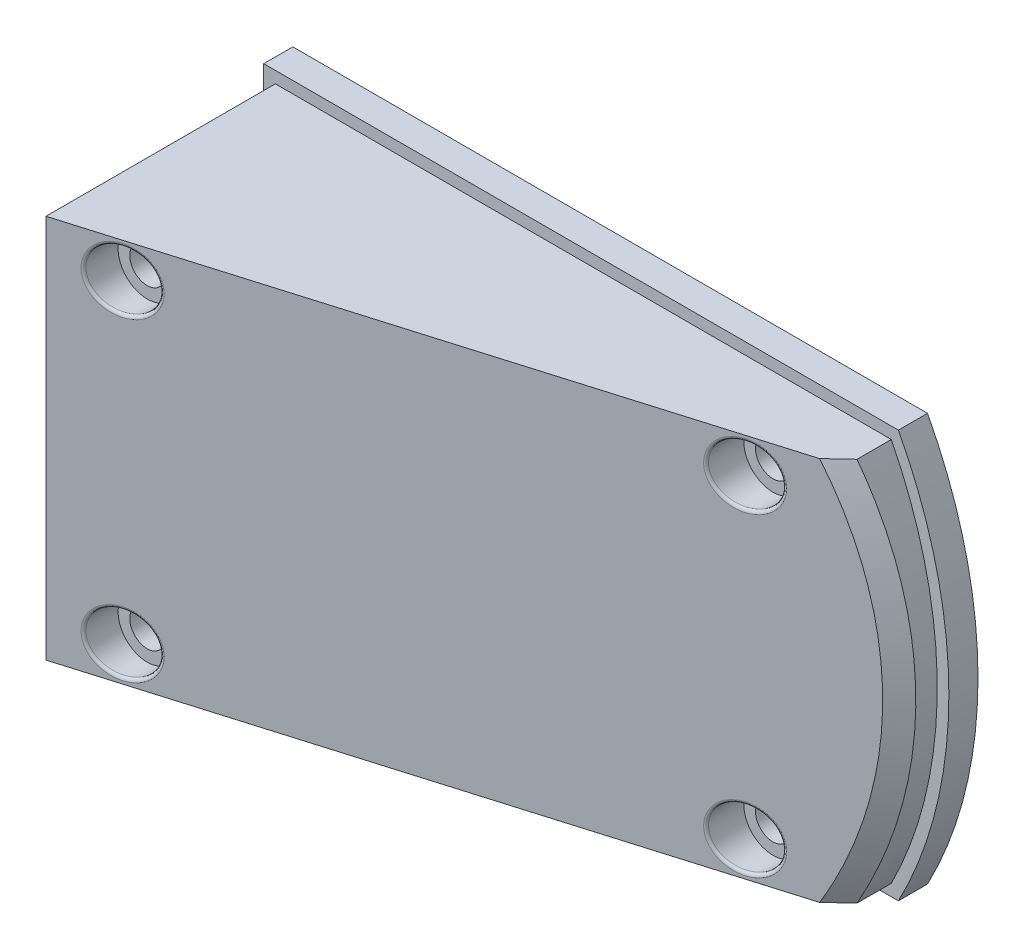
ISO-10303-21;
HEADER;
FILE_DESCRIPTION(('STEP AP214'),'2;1');
FILE_NAME('part.step','',(''),(''),'','','');
FILE_SCHEMA(('AUTOMOTIVE_DESIGN { 1 0 10303 214 1 1 1 1 }'));
ENDSEC;
DATA;
#1=APPLICATION_CONTEXT('core data for automotive mechanical design processes');
#2=APPLICATION_PROTOCOL_DEFINITION('international standard','automotive_design',2000,#1);
#3=PRODUCT_CONTEXT('',#1,'mechanical');
#4=PRODUCT('Part','Part','',(#3));
#5=PRODUCT_RELATED_PRODUCT_CATEGORY('part','',(#4));
#6=PRODUCT_DEFINITION_FORMATION('','',#4);
#7=PRODUCT_DEFINITION_CONTEXT('part definition',#1,'design');
#8=PRODUCT_DEFINITION('design','',#6,#7);
#9=PRODUCT_DEFINITION_SHAPE('','',#8);
#10=(LENGTH_UNIT() NAMED_UNIT(*) SI_UNIT(.MILLI.,.METRE.));
#11=(NAMED_UNIT(*) PLANE_ANGLE_UNIT() SI_UNIT($,.RADIAN.));
#12=(NAMED_UNIT(*) SI_UNIT($,.STERADIAN.) SOLID_ANGLE_UNIT());
#13=UNCERTAINTY_MEASURE_WITH_UNIT(LENGTH_MEASURE(1.E-05),#10,'distance_accuracy_value','');
#14=(GEOMETRIC_REPRESENTATION_CONTEXT(3) GLOBAL_UNCERTAINTY_ASSIGNED_CONTEXT((#13)) GLOBAL_UNIT_ASSIGNED_CONTEXT((#10,
#11,#12)) REPRESENTATION_CONTEXT('',''));
#15=CARTESIAN_POINT('',(0.,0.,0.));
#16=DIRECTION('',(0.,0.,1.));
#17=DIRECTION('',(1.,0.,0.));
#18=AXIS2_PLACEMENT_3D('',#15,#16,#17);
#19=CARTESIAN_POINT('',(51.7970170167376,27.,-0.001000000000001));
#20=DIRECTION('',(0.,0.,1.));
#21=DIRECTION('',(1.,0.,0.));
#22=AXIS2_PLACEMENT_3D('',#19,#20,#21);
#23=CYLINDRICAL_SURFACE('',#22,3.);
#24=CARTESIAN_POINT('',(51.7970170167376,27.,0.));
#25=DIRECTION('',(0.,0.,1.));
#26=DIRECTION('',(1.,0.,0.));
#27=AXIS2_PLACEMENT_3D('',#24,#25,#26);
#28=CIRCLE('',#27,3.);
#29=CARTESIAN_POINT('',(54.7970170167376,27.,0.));
#30=VERTEX_POINT('',#29);
#31=EDGE_CURVE('E252',#30,#30,#28,.F.);
#32=ORIENTED_EDGE('',*,*,#31,.T.);
#33=EDGE_LOOP('',(#32));
#34=FACE_BOUND('',#33,.T.);
#35=CARTESIAN_POINT('',(51.7970170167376,27.,12.));
#36=DIRECTION('',(0.,0.,1.));
#37=DIRECTION('',(1.,0.,0.));
#38=AXIS2_PLACEMENT_3D('',#35,#36,#37);
#39=CIRCLE('',#38,3.);
#40=CARTESIAN_POINT('',(54.7970170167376,27.,12.));
#41=VERTEX_POINT('',#40);
#42=EDGE_CURVE('E262',#41,#41,#39,.F.);
#43=ORIENTED_EDGE('',*,*,#42,.F.);
#44=EDGE_LOOP('',(#43));
#45=FACE_BOUND('',#44,.T.);
#46=ADVANCED_FACE('F34',(#34,#45),#23,.F.);
#47=CARTESIAN_POINT('',(51.7970170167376,-27.,-0.001000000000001));
#48=DIRECTION('',(0.,0.,1.));
#49=DIRECTION('',(1.,0.,0.));
#50=AXIS2_PLACEMENT_3D('',#47,#48,#49);
#51=CYLINDRICAL_SURFACE('',#50,3.);
#52=CARTESIAN_POINT('',(51.7970170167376,-27.,0.));
#53=DIRECTION('',(0.,0.,1.));
#54=DIRECTION('',(1.,0.,0.));
#55=AXIS2_PLACEMENT_3D('',#52,#53,#54);
#56=CIRCLE('',#55,3.);
#57=CARTESIAN_POINT('',(54.7970170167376,-27.,0.));
#58=VERTEX_POINT('',#57);
#59=EDGE_CURVE('E353',#58,#58,#56,.F.);
#60=ORIENTED_EDGE('',*,*,#59,.T.);
#61=EDGE_LOOP('',(#60));
#62=FACE_BOUND('',#61,.T.);
#63=CARTESIAN_POINT('',(51.7970170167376,-27.,12.));
#64=DIRECTION('',(0.,0.,1.));
#65=DIRECTION('',(1.,0.,0.));
#66=AXIS2_PLACEMENT_3D('',#63,#64,#65);
#67=CIRCLE('',#66,3.);
#68=CARTESIAN_POINT('',(54.7970170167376,-27.,12.));
#69=VERTEX_POINT('',#68);
#70=EDGE_CURVE('E258',#69,#69,#67,.F.);
#71=ORIENTED_EDGE('',*,*,#70,.F.);
#72=EDGE_LOOP('',(#71));
#73=FACE_BOUND('',#72,.T.);
#74=ADVANCED_FACE('F330',(#62,#73),#51,.F.);
#75=CARTESIAN_POINT('',(-30.6446280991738,-27.,-0.001000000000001));
#76=DIRECTION('',(0.,0.,1.));
#77=DIRECTION('',(1.,0.,0.));
#78=AXIS2_PLACEMENT_3D('',#75,#76,#77);
#79=CYLINDRICAL_SURFACE('',#78,3.);
#80=CARTESIAN_POINT('',(-30.6446280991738,-27.,0.));
#81=DIRECTION('',(0.,0.,1.));
#82=DIRECTION('',(1.,0.,0.));
#83=AXIS2_PLACEMENT_3D('',#80,#81,#82);
#84=CIRCLE('',#83,3.);
#85=CARTESIAN_POINT('',(-27.6446280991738,-27.,0.));
#86=VERTEX_POINT('',#85);
#87=EDGE_CURVE('E350',#86,#86,#84,.F.);
#88=ORIENTED_EDGE('',*,*,#87,.T.);
#89=EDGE_LOOP('',(#88));
#90=FACE_BOUND('',#89,.T.);
#91=CARTESIAN_POINT('',(-30.6446280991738,-27.,37.));
#92=DIRECTION('',(0.,0.,1.));
#93=DIRECTION('',(1.,0.,0.));
#94=AXIS2_PLACEMENT_3D('',#91,#92,#93);
#95=CIRCLE('',#94,3.);
#96=CARTESIAN_POINT('',(-27.6446280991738,-27.,37.));
#97=VERTEX_POINT('',#96);
#98=EDGE_CURVE('E254',#97,#97,#95,.F.);
#99=ORIENTED_EDGE('',*,*,#98,.F.);
#100=EDGE_LOOP('',(#99));
#101=FACE_BOUND('',#100,.T.);
#102=ADVANCED_FACE('F334',(#90,#101),#79,.F.);
#103=CARTESIAN_POINT('',(-30.6446280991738,27.,-0.001000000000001));
#104=DIRECTION('',(0.,0.,1.));
#105=DIRECTION('',(1.,0.,0.));
#106=AXIS2_PLACEMENT_3D('',#103,#104,#105);
#107=CYLINDRICAL_SURFACE('',#106,3.);
#108=CARTESIAN_POINT('',(-30.6446280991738,27.,0.));
#109=DIRECTION('',(0.,0.,1.));
#110=DIRECTION('',(1.,0.,0.));
#111=AXIS2_PLACEMENT_3D('',#108,#109,#110);
#112=CIRCLE('',#111,3.);
#113=CARTESIAN_POINT('',(-27.6446280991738,27.,0.));
#114=VERTEX_POINT('',#113);
#115=EDGE_CURVE('E130',#114,#114,#112,.F.);
#116=ORIENTED_EDGE('',*,*,#115,.T.);
#117=EDGE_LOOP('',(#116));
#118=FACE_BOUND('',#117,.T.);
#119=CARTESIAN_POINT('',(-30.6446280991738,27.,37.));
#120=DIRECTION('',(0.,0.,1.));
#121=DIRECTION('',(1.,0.,0.));
#122=AXIS2_PLACEMENT_3D('',#119,#120,#121);
#123=CIRCLE('',#122,3.);
#124=CARTESIAN_POINT('',(-27.6446280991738,27.,37.));
#125=VERTEX_POINT('',#124);
#126=EDGE_CURVE('E244',#125,#125,#123,.F.);
#127=ORIENTED_EDGE('',*,*,#126,.F.);
#128=EDGE_LOOP('',(#127));
#129=FACE_BOUND('',#128,.T.);
#130=ADVANCED_FACE('F337',(#118,#129),#107,.F.);
#131=CARTESIAN_POINT('',(-40.6446280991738,33.,46.8));
#132=DIRECTION('',(1.,0.,0.));
#133=DIRECTION('',(0.,1.,0.));
#134=AXIS2_PLACEMENT_3D('',#131,#132,#133);
#135=PLANE('',#134);
#136=DIRECTION('',(0.,0.,-1.));
#137=VECTOR('',#136,1.);
#138=CARTESIAN_POINT('',(-40.6446280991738,-33.,46.8));
#139=LINE('',#138,#137);
#140=CARTESIAN_POINT('',(-40.6446280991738,-33.,44.3773094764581));
#141=VERTEX_POINT('',#140);
#142=CARTESIAN_POINT('',(-40.6446280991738,-33.,5.));
#143=VERTEX_POINT('',#142);
#144=EDGE_CURVE('E129',#141,#143,#139,.T.);
#145=ORIENTED_EDGE('',*,*,#144,.F.);
#146=DIRECTION('',(0.,-1.,0.));
#147=VECTOR('',#146,1.);
#148=CARTESIAN_POINT('',(-40.6446280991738,-35.001,44.3773094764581));
#149=LINE('',#148,#147);
#150=CARTESIAN_POINT('',(-40.6446280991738,33.,44.3773094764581));
#151=VERTEX_POINT('',#150);
#152=EDGE_CURVE('E114',#151,#141,#149,.T.);
#153=ORIENTED_EDGE('',*,*,#152,.F.);
#154=DIRECTION('',(0.,0.,-1.));
#155=VECTOR('',#154,1.);
#156=CARTESIAN_POINT('',(-40.6446280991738,33.,46.8));
#157=LINE('',#156,#155);
#158=CARTESIAN_POINT('',(-40.6446280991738,33.,5.));
#159=VERTEX_POINT('',#158);
#160=EDGE_CURVE('E127',#151,#159,#157,.T.);
#161=ORIENTED_EDGE('',*,*,#160,.T.);
#162=DIRECTION('',(0.,-1.,0.));
#163=VECTOR('',#162,1.);
#164=CARTESIAN_POINT('',(-40.6446280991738,33.,5.));
#165=LINE('',#164,#163);
#166=EDGE_CURVE('E137',#159,#143,#165,.T.);
#167=ORIENTED_EDGE('',*,*,#166,.T.);
#168=EDGE_LOOP('',(#145,#153,#161,#167));
#169=FACE_BOUND('',#168,.T.);
#170=ADVANCED_FACE('F125',(#169),#135,.F.);
#171=CARTESIAN_POINT('',(-40.6446280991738,-33.,46.8));
#172=DIRECTION('',(0.,1.,0.));
#173=DIRECTION('',(0.,0.,1.));
#174=AXIS2_PLACEMENT_3D('',#171,#172,#173);
#175=PLANE('',#174);
#176=DIRECTION('',(0.,0.,-1.));
#177=VECTOR('',#176,1.);
#178=CARTESIAN_POINT('',(65.1152823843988,-33.,46.8));
#179=LINE('',#178,#177);
#180=CARTESIAN_POINT('',(65.1152635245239,-33.,10.8934783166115));
#181=VERTEX_POINT('',#180);
#182=CARTESIAN_POINT('',(65.1152823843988,-33.,5.));
#183=VERTEX_POINT('',#182);
#184=EDGE_CURVE('E139',#181,#183,#179,.T.);
#185=ORIENTED_EDGE('',*,*,#184,.F.);
#186=CARTESIAN_POINT('',(61.7970163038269,-33.,13.9956727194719));
#187=CARTESIAN_POINT('',(61.932631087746,-33.0000000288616,13.8691194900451));
#188=CARTESIAN_POINT('',(62.0682315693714,-33.0000003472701,13.7425509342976));
#189=CARTESIAN_POINT('',(62.3401912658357,-33.0000011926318,13.4886483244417));
#190=CARTESIAN_POINT('',(62.4765503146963,-33.000001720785,13.3613140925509));
#191=CARTESIAN_POINT('',(62.7500277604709,-33.000002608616,13.1058787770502));
#192=CARTESIAN_POINT('',(62.8871459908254,-33.0000029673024,12.9777775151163));
#193=CARTESIAN_POINT('',(63.1621423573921,-33.0000033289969,12.7208067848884));
#194=CARTESIAN_POINT('',(63.3000203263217,-33.0000033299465,12.5919371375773));
#195=CARTESIAN_POINT('',(63.5765366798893,-33.0000029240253,12.3334282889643));
#196=CARTESIAN_POINT('',(63.7151748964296,-33.0000025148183,12.203788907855));
#197=CARTESIAN_POINT('',(63.9932122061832,-33.0000013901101,11.9437392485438));
#198=CARTESIAN_POINT('',(64.1326111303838,-33.0000006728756,11.8133287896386));
#199=CARTESIAN_POINT('',(64.4121702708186,-32.9999991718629,11.5517356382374));
#200=CARTESIAN_POINT('',(64.5523303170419,-32.99999838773,11.4205527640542));
#201=CARTESIAN_POINT('',(64.8334120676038,-32.9999971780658,11.1574134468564));
#202=CARTESIAN_POINT('',(64.9743336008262,-32.9999967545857,11.0254568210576));
#203=CARTESIAN_POINT('',(65.1152398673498,-32.9999967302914,10.8934838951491));
#204=B_SPLINE_CURVE_WITH_KNOTS('',3,(#186,#187,#188,#189,#190,#191,#192,#193,#194,#195,#196,
#197,#198,#199,#200,#201,#202,#203),.UNSPECIFIED.,.F.,.F.,(4,2,2,2,2,2,2,2,4),(0.,
0.556474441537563,1.11617986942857,1.67912043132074,2.24530015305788,2.81472294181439,
3.38739258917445,3.96331277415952,4.54248706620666),.UNSPECIFIED.);
#205=CARTESIAN_POINT('',(61.797017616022,-32.9999944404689,13.9956749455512));
#206=VERTEX_POINT('',#205);
#207=EDGE_CURVE('E188',#181,#206,#204,.F.);
#208=ORIENTED_EDGE('',*,*,#207,.T.);
#209=DIRECTION('',(0.958725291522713,0.,-0.284333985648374));
#210=VECTOR('',#209,1.);
#211=CARTESIAN_POINT('',(-42.6446280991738,-33.,44.9704595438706));
#212=LINE('',#211,#210);
#213=EDGE_CURVE('E121',#141,#206,#212,.T.);
#214=ORIENTED_EDGE('',*,*,#213,.F.);
#215=ORIENTED_EDGE('',*,*,#144,.T.);
#216=DIRECTION('',(1.,0.,0.));
#217=VECTOR('',#216,1.);
#218=CARTESIAN_POINT('',(-40.6446280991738,-33.,5.));
#219=LINE('',#218,#217);
#220=EDGE_CURVE('E141',#143,#183,#219,.T.);
#221=ORIENTED_EDGE('',*,*,#220,.T.);
#222=EDGE_LOOP('',(#185,#208,#214,#215,#221));
#223=FACE_BOUND('',#222,.T.);
#224=ADVANCED_FACE('F173',(#223),#175,.F.);
#225=CARTESIAN_POINT('',(0.,0.,46.8));
#226=DIRECTION('',(0.,0.,-1.));
#227=DIRECTION('',(-1.,0.,0.));
#228=AXIS2_PLACEMENT_3D('',#225,#226,#227);
#229=CYLINDRICAL_SURFACE('',#228,73.);
#230=DIRECTION('',(0.,0.,-1.));
#231=VECTOR('',#230,1.);
#232=CARTESIAN_POINT('',(65.1152823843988,33.,46.8));
#233=LINE('',#232,#231);
#234=CARTESIAN_POINT('',(65.1152650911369,32.9999905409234,10.8934767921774));
#235=VERTEX_POINT('',#234);
#236=CARTESIAN_POINT('',(65.1152823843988,33.,5.));
#237=VERTEX_POINT('',#236);
#238=EDGE_CURVE('E136',#235,#237,#233,.T.);
#239=ORIENTED_EDGE('',*,*,#238,.F.);
#240=CARTESIAN_POINT('',(62.3927550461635,-37.8964921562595,11.6601305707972));
#241=CARTESIAN_POINT('',(64.1165838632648,-35.0585266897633,11.1747035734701));
#242=CARTESIAN_POINT('',(65.6463337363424,-32.1027179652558,10.7439288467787));
#243=CARTESIAN_POINT('',(68.2896781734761,-26.0104880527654,9.99956795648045));
#244=CARTESIAN_POINT('',(69.4031828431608,-22.874086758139,9.68600710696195));
#245=CARTESIAN_POINT('',(71.1931977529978,-16.4789024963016,9.18194222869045));
#246=CARTESIAN_POINT('',(71.8696906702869,-13.2201814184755,8.99144307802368));
#247=CARTESIAN_POINT('',(72.7730961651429,-6.64094182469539,8.73704576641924));
#248=CARTESIAN_POINT('',(73.0000000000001,-3.32048697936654,8.67315006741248));
#249=CARTESIAN_POINT('',(73.,3.32048697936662,8.67315006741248));
#250=CARTESIAN_POINT('',(72.7730961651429,6.64094182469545,8.73704576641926));
#251=CARTESIAN_POINT('',(71.8696906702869,13.2201814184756,8.99144307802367));
#252=CARTESIAN_POINT('',(71.1931977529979,16.4789024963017,9.18194222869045));
#253=CARTESIAN_POINT('',(69.4031828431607,22.8740867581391,9.68600710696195));
#254=CARTESIAN_POINT('',(68.2896781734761,26.0104880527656,9.99956795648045));
#255=CARTESIAN_POINT('',(65.6463337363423,32.1027179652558,10.7439288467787));
#256=CARTESIAN_POINT('',(64.1165838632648,35.0585266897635,11.1747035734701));
#257=CARTESIAN_POINT('',(62.3927550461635,37.8964921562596,11.6601305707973));
#258=B_SPLINE_CURVE_WITH_KNOTS('',3,(#240,#241,#242,#243,#244,#245,#246,#247,#248,#249,#250,
#251,#252,#253,#254,#255,#256,#257),.UNSPECIFIED.,.F.,.F.,(4,2,2,2,2,2,2,2,4),
(-0.545832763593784,-0.409374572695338,-0.272916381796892,-0.136458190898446,0.,
0.136458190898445,0.272916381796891,0.409374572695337,0.545832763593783),.UNSPECIFIED.);
#259=EDGE_CURVE('E53',#235,#181,#258,.F.);
#260=ORIENTED_EDGE('',*,*,#259,.T.);
#261=ORIENTED_EDGE('',*,*,#184,.T.);
#262=CARTESIAN_POINT('',(0.,0.,5.));
#263=DIRECTION('',(0.,0.,1.));
#264=DIRECTION('',(1.,0.,0.));
#265=AXIS2_PLACEMENT_3D('',#262,#263,#264);
#266=CIRCLE('',#265,73.);
#267=EDGE_CURVE('E367',#183,#237,#266,.T.);
#268=ORIENTED_EDGE('',*,*,#267,.T.);
#269=EDGE_LOOP('',(#239,#260,#261,#268));
#270=FACE_BOUND('',#269,.T.);
#271=ADVANCED_FACE('F167',(#270),#229,.T.);
#272=CARTESIAN_POINT('',(-40.6446280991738,33.,46.8));
#273=DIRECTION('',(0.,-1.,0.));
#274=DIRECTION('',(0.,0.,-1.));
#275=AXIS2_PLACEMENT_3D('',#272,#273,#274);
#276=PLANE('',#275);
#277=DIRECTION('',(-0.958725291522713,0.,0.284333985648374));
#278=VECTOR('',#277,1.);
#279=CARTESIAN_POINT('',(-42.6446280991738,33.,44.9704595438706));
#280=LINE('',#279,#278);
#281=CARTESIAN_POINT('',(61.7970170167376,33.,13.995675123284));
#282=VERTEX_POINT('',#281);
#283=EDGE_CURVE('E110',#282,#151,#280,.T.);
#284=ORIENTED_EDGE('',*,*,#283,.F.);
#285=CARTESIAN_POINT('',(65.1152398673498,32.9999967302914,10.8934838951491));
#286=CARTESIAN_POINT('',(64.9743337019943,32.9999967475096,11.0254567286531));
#287=CARTESIAN_POINT('',(64.833412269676,32.999997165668,11.1574132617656));
#288=CARTESIAN_POINT('',(64.5523306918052,32.9999983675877,11.4205524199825));
#289=CARTESIAN_POINT('',(64.4121707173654,32.9999991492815,11.551735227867));
#290=CARTESIAN_POINT('',(64.1326116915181,33.0000006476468,11.8133282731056));
#291=CARTESIAN_POINT('',(63.9932128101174,33.0000013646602,11.9437386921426));
#292=CARTESIAN_POINT('',(63.7151755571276,33.0000024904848,12.2037882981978));
#293=CARTESIAN_POINT('',(63.5765373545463,33.0000029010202,12.3334276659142));
#294=CARTESIAN_POINT('',(63.3000210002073,33.0000033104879,12.5919365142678));
#295=CARTESIAN_POINT('',(63.1621430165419,33.000003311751,12.7208061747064));
#296=CARTESIAN_POINT('',(62.8871465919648,33.000002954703,12.9777769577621));
#297=CARTESIAN_POINT('',(62.7500283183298,33.000002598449,13.1058782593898));
#298=CARTESIAN_POINT('',(62.47655075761,33.0000017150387,13.3613136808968));
#299=CARTESIAN_POINT('',(62.3401916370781,33.0000011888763,13.4886479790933));
#300=CARTESIAN_POINT('',(62.068231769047,33.0000003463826,13.7425507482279));
#301=CARTESIAN_POINT('',(61.9326311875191,33.0000000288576,13.8691193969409));
#302=CARTESIAN_POINT('',(61.797016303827,33.,13.9956727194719));
#303=B_SPLINE_CURVE_WITH_KNOTS('',3,(#285,#286,#287,#288,#289,#290,#291,#292,#293,#294,#295,
#296,#297,#298,#299,#300,#301,#302),.UNSPECIFIED.,.F.,.F.,(4,2,2,2,2,2,2,2,4),(0.,
0.579173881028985,1.15509377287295,1.72776324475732,2.29718597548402,2.86336575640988,
3.42630649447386,3.98601221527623,4.54248706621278),.UNSPECIFIED.);
#304=EDGE_CURVE('E62',#282,#235,#303,.F.);
#305=ORIENTED_EDGE('',*,*,#304,.T.);
#306=ORIENTED_EDGE('',*,*,#238,.T.);
#307=DIRECTION('',(-1.,0.,0.));
#308=VECTOR('',#307,1.);
#309=CARTESIAN_POINT('',(-40.6446280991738,33.,5.));
#310=LINE('',#309,#308);
#311=EDGE_CURVE('E135',#237,#159,#310,.T.);
#312=ORIENTED_EDGE('',*,*,#311,.T.);
#313=ORIENTED_EDGE('',*,*,#160,.F.);
#314=EDGE_LOOP('',(#284,#305,#306,#312,#313));
#315=FACE_BOUND('',#314,.T.);
#316=ADVANCED_FACE('F133',(#315),#276,.F.);
#317=CARTESIAN_POINT('',(0.,0.,5.));
#318=DIRECTION('',(0.,0.,1.));
#319=DIRECTION('',(1.,0.,0.));
#320=AXIS2_PLACEMENT_3D('',#317,#318,#319);
#321=PLANE('',#320);
#322=CARTESIAN_POINT('',(0.,0.,5.));
#323=DIRECTION('',(0.,0.,1.));
#324=DIRECTION('',(1.,0.,0.));
#325=AXIS2_PLACEMENT_3D('',#322,#323,#324);
#326=CIRCLE('',#325,75.);
#327=CARTESIAN_POINT('',(66.332495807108,-35.,5.));
#328=VERTEX_POINT('',#327);
#329=CARTESIAN_POINT('',(66.332495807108,35.,5.));
#330=VERTEX_POINT('',#329);
#331=EDGE_CURVE('E383',#328,#330,#326,.T.);
#332=ORIENTED_EDGE('',*,*,#331,.T.);
#333=DIRECTION('',(1.,0.,0.));
#334=VECTOR('',#333,1.);
#335=CARTESIAN_POINT('',(0.,35.,5.));
#336=LINE('',#335,#334);
#337=CARTESIAN_POINT('',(-42.6446280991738,35.,5.));
#338=VERTEX_POINT('',#337);
#339=EDGE_CURVE('E396',#338,#330,#336,.T.);
#340=ORIENTED_EDGE('',*,*,#339,.F.);
#341=DIRECTION('',(0.,1.,0.));
#342=VECTOR('',#341,1.);
#343=CARTESIAN_POINT('',(-42.6446280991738,0.,5.));
#344=LINE('',#343,#342);
#345=CARTESIAN_POINT('',(-42.6446280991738,-35.,5.));
#346=VERTEX_POINT('',#345);
#347=EDGE_CURVE('E393',#346,#338,#344,.T.);
#348=ORIENTED_EDGE('',*,*,#347,.F.);
#349=DIRECTION('',(1.,0.,0.));
#350=VECTOR('',#349,1.);
#351=CARTESIAN_POINT('',(0.,-35.,5.));
#352=LINE('',#351,#350);
#353=EDGE_CURVE('E380',#346,#328,#352,.T.);
#354=ORIENTED_EDGE('',*,*,#353,.T.);
#355=EDGE_LOOP('',(#332,#340,#348,#354));
#356=FACE_BOUND('',#355,.T.);
#357=ORIENTED_EDGE('',*,*,#166,.F.);
#358=ORIENTED_EDGE('',*,*,#311,.F.);
#359=ORIENTED_EDGE('',*,*,#267,.F.);
#360=ORIENTED_EDGE('',*,*,#220,.F.);
#361=EDGE_LOOP('',(#357,#358,#359,#360));
#362=FACE_BOUND('',#361,.T.);
#363=ADVANCED_FACE('F166',(#356,#362),#321,.T.);
#364=CARTESIAN_POINT('',(0.,0.,5.));
#365=DIRECTION('',(0.,0.,-1.));
#366=DIRECTION('',(-1.,0.,0.));
#367=AXIS2_PLACEMENT_3D('',#364,#365,#366);
#368=CYLINDRICAL_SURFACE('',#367,75.);
#369=CARTESIAN_POINT('',(0.,0.,0.));
#370=DIRECTION('',(0.,0.,1.));
#371=DIRECTION('',(1.,0.,0.));
#372=AXIS2_PLACEMENT_3D('',#369,#370,#371);
#373=CIRCLE('',#372,75.);
#374=CARTESIAN_POINT('',(66.332495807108,-35.,0.));
#375=VERTEX_POINT('',#374);
#376=CARTESIAN_POINT('',(66.332495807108,35.,0.));
#377=VERTEX_POINT('',#376);
#378=EDGE_CURVE('E120',#375,#377,#373,.T.);
#379=ORIENTED_EDGE('',*,*,#378,.T.);
#380=DIRECTION('',(0.,0.,-1.));
#381=VECTOR('',#380,1.);
#382=CARTESIAN_POINT('',(66.332495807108,35.,5.));
#383=LINE('',#382,#381);
#384=EDGE_CURVE('E369',#330,#377,#383,.T.);
#385=ORIENTED_EDGE('',*,*,#384,.F.);
#386=ORIENTED_EDGE('',*,*,#331,.F.);
#387=DIRECTION('',(0.,0.,-1.));
#388=VECTOR('',#387,1.);
#389=CARTESIAN_POINT('',(66.332495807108,-35.,5.));
#390=LINE('',#389,#388);
#391=EDGE_CURVE('E377',#328,#375,#390,.T.);
#392=ORIENTED_EDGE('',*,*,#391,.T.);
#393=EDGE_LOOP('',(#379,#385,#386,#392));
#394=FACE_BOUND('',#393,.T.);
#395=ADVANCED_FACE('F406',(#394),#368,.T.);
#396=CARTESIAN_POINT('',(0.,35.,5.));
#397=DIRECTION('',(0.,1.,0.));
#398=DIRECTION('',(0.,0.,1.));
#399=AXIS2_PLACEMENT_3D('',#396,#397,#398);
#400=PLANE('',#399);
#401=DIRECTION('',(1.,0.,0.));
#402=VECTOR('',#401,1.);
#403=CARTESIAN_POINT('',(0.,35.,0.));
#404=LINE('',#403,#402);
#405=CARTESIAN_POINT('',(-42.6446280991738,35.,0.));
#406=VERTEX_POINT('',#405);
#407=EDGE_CURVE('E387',#406,#377,#404,.T.);
#408=ORIENTED_EDGE('',*,*,#407,.F.);
#409=DIRECTION('',(0.,0.,-1.));
#410=VECTOR('',#409,1.);
#411=CARTESIAN_POINT('',(-42.6446280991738,35.,5.));
#412=LINE('',#411,#410);
#413=EDGE_CURVE('E373',#338,#406,#412,.T.);
#414=ORIENTED_EDGE('',*,*,#413,.F.);
#415=ORIENTED_EDGE('',*,*,#339,.T.);
#416=ORIENTED_EDGE('',*,*,#384,.T.);
#417=EDGE_LOOP('',(#408,#414,#415,#416));
#418=FACE_BOUND('',#417,.T.);
#419=ADVANCED_FACE('F410',(#418),#400,.T.);
#420=CARTESIAN_POINT('',(-42.6446280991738,0.,5.));
#421=DIRECTION('',(-1.,0.,0.));
#422=DIRECTION('',(0.,0.,1.));
#423=AXIS2_PLACEMENT_3D('',#420,#421,#422);
#424=PLANE('',#423);
#425=DIRECTION('',(0.,1.,0.));
#426=VECTOR('',#425,1.);
#427=CARTESIAN_POINT('',(-42.6446280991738,0.,0.));
#428=LINE('',#427,#426);
#429=CARTESIAN_POINT('',(-42.6446280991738,-35.,0.));
#430=VERTEX_POINT('',#429);
#431=EDGE_CURVE('E384',#430,#406,#428,.T.);
#432=ORIENTED_EDGE('',*,*,#431,.F.);
#433=DIRECTION('',(0.,0.,-1.));
#434=VECTOR('',#433,1.);
#435=CARTESIAN_POINT('',(-42.6446280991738,-35.,5.));
#436=LINE('',#435,#434);
#437=EDGE_CURVE('E375',#346,#430,#436,.T.);
#438=ORIENTED_EDGE('',*,*,#437,.F.);
#439=ORIENTED_EDGE('',*,*,#347,.T.);
#440=ORIENTED_EDGE('',*,*,#413,.T.);
#441=EDGE_LOOP('',(#432,#438,#439,#440));
#442=FACE_BOUND('',#441,.T.);
#443=ADVANCED_FACE('F413',(#442),#424,.T.);
#444=CARTESIAN_POINT('',(0.,-35.,5.));
#445=DIRECTION('',(0.,1.,0.));
#446=DIRECTION('',(0.,0.,1.));
#447=AXIS2_PLACEMENT_3D('',#444,#445,#446);
#448=PLANE('',#447);
#449=DIRECTION('',(1.,0.,0.));
#450=VECTOR('',#449,1.);
#451=CARTESIAN_POINT('',(0.,-35.,0.));
#452=LINE('',#451,#450);
#453=EDGE_CURVE('E381',#430,#375,#452,.T.);
#454=ORIENTED_EDGE('',*,*,#453,.T.);
#455=ORIENTED_EDGE('',*,*,#391,.F.);
#456=ORIENTED_EDGE('',*,*,#353,.F.);
#457=ORIENTED_EDGE('',*,*,#437,.T.);
#458=EDGE_LOOP('',(#454,#455,#456,#457));
#459=FACE_BOUND('',#458,.T.);
#460=ADVANCED_FACE('F416',(#459),#448,.F.);
#461=CARTESIAN_POINT('',(0.,0.,0.));
#462=DIRECTION('',(0.,0.,1.));
#463=DIRECTION('',(1.,0.,0.));
#464=AXIS2_PLACEMENT_3D('',#461,#462,#463);
#465=PLANE('',#464);
#466=ORIENTED_EDGE('',*,*,#31,.F.);
#467=EDGE_LOOP('',(#466));
#468=FACE_BOUND('',#467,.T.);
#469=ORIENTED_EDGE('',*,*,#59,.F.);
#470=EDGE_LOOP('',(#469));
#471=FACE_BOUND('',#470,.T.);
#472=ORIENTED_EDGE('',*,*,#87,.F.);
#473=EDGE_LOOP('',(#472));
#474=FACE_BOUND('',#473,.T.);
#475=ORIENTED_EDGE('',*,*,#115,.F.);
#476=EDGE_LOOP('',(#475));
#477=FACE_BOUND('',#476,.T.);
#478=ORIENTED_EDGE('',*,*,#378,.F.);
#479=ORIENTED_EDGE('',*,*,#453,.F.);
#480=ORIENTED_EDGE('',*,*,#431,.T.);
#481=ORIENTED_EDGE('',*,*,#407,.T.);
#482=EDGE_LOOP('',(#478,#479,#480,#481));
#483=FACE_BOUND('',#482,.T.);
#484=ADVANCED_FACE('F168',(#468,#471,#474,#477,#483),#465,.F.);
#485=CARTESIAN_POINT('',(-42.6446280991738,-35.001,44.9704595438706));
#486=DIRECTION('',(-0.284333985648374,0.,-0.958725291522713));
#487=DIRECTION('',(-0.958725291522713,0.,0.284333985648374));
#488=AXIS2_PLACEMENT_3D('',#485,#486,#487);
#489=PLANE('',#488);
#490=CARTESIAN_POINT('',(51.9391840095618,-27.,16.9192622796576));
#491=DIRECTION('',(-0.284333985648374,0.,-0.958725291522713));
#492=DIRECTION('',(-0.958725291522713,0.,0.284333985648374));
#493=AXIS2_PLACEMENT_3D('',#490,#491,#492);
#494=ELLIPSE('',#493,5.73678409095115,5.5);
#495=CARTESIAN_POINT('',(46.4391840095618,-27.,18.550424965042));
#496=VERTEX_POINT('',#495);
#497=EDGE_CURVE('E275',#496,#496,#494,.T.);
#498=ORIENTED_EDGE('',*,*,#497,.T.);
#499=EDGE_LOOP('',(#498));
#500=FACE_BOUND('',#499,.T.);
#501=CARTESIAN_POINT('',(51.9391840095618,27.,16.9192622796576));
#502=DIRECTION('',(-0.284333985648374,0.,-0.958725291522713));
#503=DIRECTION('',(-0.958725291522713,0.,0.284333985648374));
#504=AXIS2_PLACEMENT_3D('',#501,#502,#503);
#505=ELLIPSE('',#504,5.73678409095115,5.5);
#506=CARTESIAN_POINT('',(46.4391840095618,27.,18.550424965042));
#507=VERTEX_POINT('',#506);
#508=EDGE_CURVE('E272',#507,#507,#505,.T.);
#509=ORIENTED_EDGE('',*,*,#508,.T.);
#510=EDGE_LOOP('',(#509));
#511=FACE_BOUND('',#510,.T.);
#512=CARTESIAN_POINT('',(-30.5024611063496,27.,41.369395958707));
#513=DIRECTION('',(-0.284333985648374,0.,-0.958725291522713));
#514=DIRECTION('',(-0.958725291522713,0.,0.284333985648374));
#515=AXIS2_PLACEMENT_3D('',#512,#513,#514);
#516=ELLIPSE('',#515,5.73678409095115,5.5);
#517=CARTESIAN_POINT('',(-36.0024611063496,27.,43.0005586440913));
#518=VERTEX_POINT('',#517);
#519=EDGE_CURVE('E269',#518,#518,#516,.T.);
#520=ORIENTED_EDGE('',*,*,#519,.T.);
#521=EDGE_LOOP('',(#520));
#522=FACE_BOUND('',#521,.T.);
#523=CARTESIAN_POINT('',(-30.5024611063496,-27.,41.369395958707));
#524=DIRECTION('',(-0.284333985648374,0.,-0.958725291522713));
#525=DIRECTION('',(-0.958725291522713,0.,0.284333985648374));
#526=AXIS2_PLACEMENT_3D('',#523,#524,#525);
#527=ELLIPSE('',#526,5.73678409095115,5.5);
#528=CARTESIAN_POINT('',(-36.0024611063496,-27.,43.0005586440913));
#529=VERTEX_POINT('',#528);
#530=EDGE_CURVE('E266',#529,#529,#527,.T.);
#531=ORIENTED_EDGE('',*,*,#530,.T.);
#532=EDGE_LOOP('',(#531));
#533=FACE_BOUND('',#532,.T.);
#534=ORIENTED_EDGE('',*,*,#213,.T.);
#535=CARTESIAN_POINT('',(60.0851840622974,35.9827385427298,14.5033620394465));
#536=CARTESIAN_POINT('',(61.7219603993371,33.2880888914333,14.0179350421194));
#537=CARTESIAN_POINT('',(63.1744586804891,30.481547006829,13.5871603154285));
#538=CARTESIAN_POINT('',(65.6843155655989,24.6969716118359,12.8427994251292));
#539=CARTESIAN_POINT('',(66.7415888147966,21.7189569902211,12.5292385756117));
#540=CARTESIAN_POINT('',(68.4412088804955,15.6467262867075,12.0251736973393));
#541=CARTESIAN_POINT('',(69.0835392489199,12.5525689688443,11.8346745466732));
#542=CARTESIAN_POINT('',(69.941323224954,6.30557763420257,11.5802772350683));
#543=CARTESIAN_POINT('',(70.1567685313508,3.15280407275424,11.5163815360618));
#544=CARTESIAN_POINT('',(70.1567685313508,-3.15280407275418,11.5163815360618));
#545=CARTESIAN_POINT('',(69.941323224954,-6.30557763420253,11.5802772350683));
#546=CARTESIAN_POINT('',(69.0835392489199,-12.5525689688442,11.8346745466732));
#547=CARTESIAN_POINT('',(68.4412088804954,-15.6467262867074,12.0251736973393));
#548=CARTESIAN_POINT('',(66.7415888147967,-21.718956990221,12.5292385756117));
#549=CARTESIAN_POINT('',(65.684315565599,-24.6969716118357,12.8427994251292));
#550=CARTESIAN_POINT('',(63.1744586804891,-30.4815470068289,13.5871603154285));
#551=CARTESIAN_POINT('',(61.7219603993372,-33.2880888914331,14.0179350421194));
#552=CARTESIAN_POINT('',(60.0851840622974,-35.9827385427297,14.5033620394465));
#553=B_SPLINE_CURVE_WITH_KNOTS('',3,(#535,#536,#537,#538,#539,#540,#541,#542,#543,#544,#545,
#546,#547,#548,#549,#550,#551,#552),.UNSPECIFIED.,.F.,.F.,(4,2,2,2,2,2,2,2,4),
(-0.545832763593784,-0.409374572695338,-0.272916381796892,-0.136458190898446,0.,
0.136458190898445,0.272916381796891,0.409374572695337,0.545832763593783),.UNSPECIFIED.);
#554=EDGE_CURVE('E117',#206,#282,#553,.F.);
#555=ORIENTED_EDGE('',*,*,#554,.T.);
#556=ORIENTED_EDGE('',*,*,#283,.T.);
#557=ORIENTED_EDGE('',*,*,#152,.T.);
#558=EDGE_LOOP('',(#534,#555,#556,#557));
#559=FACE_BOUND('',#558,.T.);
#560=ADVANCED_FACE('F113',(#500,#511,#522,#533,#559),#489,.F.);
#561=CARTESIAN_POINT('',(62.3927550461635,37.8964921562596,11.6601305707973));
#562=CARTESIAN_POINT('',(64.1165838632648,35.0585266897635,11.1747035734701));
#563=CARTESIAN_POINT('',(65.6463337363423,32.1027179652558,10.7439288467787));
#564=CARTESIAN_POINT('',(68.2896781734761,26.0104880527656,9.99956795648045));
#565=CARTESIAN_POINT('',(69.4031828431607,22.8740867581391,9.68600710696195));
#566=CARTESIAN_POINT('',(71.1931977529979,16.4789024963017,9.18194222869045));
#567=CARTESIAN_POINT('',(71.8696906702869,13.2201814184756,8.99144307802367));
#568=CARTESIAN_POINT('',(72.7730961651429,6.64094182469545,8.73704576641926));
#569=CARTESIAN_POINT('',(73.,3.32048697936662,8.67315006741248));
#570=CARTESIAN_POINT('',(73.0000000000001,-3.32048697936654,8.67315006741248));
#571=CARTESIAN_POINT('',(72.7730961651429,-6.64094182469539,8.73704576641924));
#572=CARTESIAN_POINT('',(71.8696906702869,-13.2201814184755,8.99144307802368));
#573=CARTESIAN_POINT('',(71.1931977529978,-16.4789024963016,9.18194222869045));
#574=CARTESIAN_POINT('',(69.4031828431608,-22.874086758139,9.68600710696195));
#575=CARTESIAN_POINT('',(68.2896781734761,-26.0104880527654,9.99956795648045));
#576=CARTESIAN_POINT('',(65.6463337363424,-32.1027179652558,10.7439288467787));
#577=CARTESIAN_POINT('',(64.1165838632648,-35.0585266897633,11.1747035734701));
#578=CARTESIAN_POINT('',(62.3927550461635,-37.8964921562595,11.6601305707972));
#579=CARTESIAN_POINT('',(60.0851840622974,35.9827385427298,14.5033620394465));
#580=CARTESIAN_POINT('',(61.7219603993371,33.2880888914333,14.0179350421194));
#581=CARTESIAN_POINT('',(63.1744586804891,30.481547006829,13.5871603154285));
#582=CARTESIAN_POINT('',(65.6843155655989,24.6969716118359,12.8427994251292));
#583=CARTESIAN_POINT('',(66.7415888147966,21.7189569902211,12.5292385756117));
#584=CARTESIAN_POINT('',(68.4412088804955,15.6467262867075,12.0251736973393));
#585=CARTESIAN_POINT('',(69.0835392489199,12.5525689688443,11.8346745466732));
#586=CARTESIAN_POINT('',(69.941323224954,6.30557763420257,11.5802772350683));
#587=CARTESIAN_POINT('',(70.1567685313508,3.15280407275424,11.5163815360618));
#588=CARTESIAN_POINT('',(70.1567685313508,-3.15280407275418,11.5163815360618));
#589=CARTESIAN_POINT('',(69.941323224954,-6.30557763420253,11.5802772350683));
#590=CARTESIAN_POINT('',(69.0835392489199,-12.5525689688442,11.8346745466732));
#591=CARTESIAN_POINT('',(68.4412088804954,-15.6467262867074,12.0251736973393));
#592=CARTESIAN_POINT('',(66.7415888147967,-21.718956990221,12.5292385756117));
#593=CARTESIAN_POINT('',(65.684315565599,-24.6969716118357,12.8427994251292));
#594=CARTESIAN_POINT('',(63.1744586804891,-30.4815470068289,13.5871603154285));
#595=CARTESIAN_POINT('',(61.7219603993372,-33.2880888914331,14.0179350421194));
#596=CARTESIAN_POINT('',(60.0851840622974,-35.9827385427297,14.5033620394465));
#597=B_SPLINE_SURFACE_WITH_KNOTS('',1,3,((#561,#562,#563,#564,#565,#566,#567,#568,#569,#570,
#571,#572,#573,#574,#575,#576,#577,#578),(#579,#580,#581,#582,#583,#584,#585,#586,#587,#588,
#589,#590,#591,#592,#593,#594,#595,#596)),.UNSPECIFIED.,.F.,.F.,.F.,(2,2),(4,2,2,2,2,2,2,2,4),
(0.,1.),(-0.545832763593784,-0.409374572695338,-0.272916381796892,-0.136458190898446,0.,
0.136458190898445,0.272916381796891,0.409374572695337,0.545832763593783),.UNSPECIFIED.);
#598=ORIENTED_EDGE('',*,*,#207,.F.);
#599=ORIENTED_EDGE('',*,*,#259,.F.);
#600=ORIENTED_EDGE('',*,*,#304,.F.);
#601=ORIENTED_EDGE('',*,*,#554,.F.);
#602=EDGE_LOOP('',(#598,#599,#600,#601));
#603=FACE_BOUND('',#602,.T.);
#604=ADVANCED_FACE('F204',(#603),#597,.T.);
#605=CARTESIAN_POINT('',(-30.6446280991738,27.,37.));
#606=DIRECTION('',(0.,0.,1.));
#607=DIRECTION('',(1.,0.,0.));
#608=AXIS2_PLACEMENT_3D('',#605,#606,#607);
#609=CYLINDRICAL_SURFACE('',#608,5.);
#610=CARTESIAN_POINT('',(-30.6446280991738,27.,40.8900333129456));
#611=DIRECTION('',(0.310145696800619,0.,0.950689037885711));
#612=DIRECTION('',(-0.950689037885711,0.,0.310145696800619));
#613=AXIS2_PLACEMENT_3D('',#610,#611,#612);
#614=ELLIPSE('',#613,5.25934327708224,5.);
#615=CARTESIAN_POINT('',(-35.6446280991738,27.,42.52119599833));
#616=VERTEX_POINT('',#615);
#617=EDGE_CURVE('E45',#616,#616,#614,.T.);
#618=ORIENTED_EDGE('',*,*,#617,.T.);
#619=EDGE_LOOP('',(#618));
#620=FACE_BOUND('',#619,.T.);
#621=CARTESIAN_POINT('',(-30.6446280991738,27.,37.));
#622=DIRECTION('',(0.,0.,1.));
#623=DIRECTION('',(1.,0.,0.));
#624=AXIS2_PLACEMENT_3D('',#621,#622,#623);
#625=CIRCLE('',#624,5.);
#626=CARTESIAN_POINT('',(-25.6446280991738,27.,37.));
#627=VERTEX_POINT('',#626);
#628=EDGE_CURVE('E253',#627,#627,#625,.T.);
#629=ORIENTED_EDGE('',*,*,#628,.F.);
#630=EDGE_LOOP('',(#629));
#631=FACE_BOUND('',#630,.T.);
#632=ADVANCED_FACE('F215',(#620,#631),#609,.F.);
#633=CARTESIAN_POINT('',(-30.6446280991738,27.,37.));
#634=DIRECTION('',(0.,0.,1.));
#635=DIRECTION('',(1.,0.,0.));
#636=AXIS2_PLACEMENT_3D('',#633,#634,#635);
#637=PLANE('',#636);
#638=ORIENTED_EDGE('',*,*,#628,.T.);
#639=EDGE_LOOP('',(#638));
#640=FACE_BOUND('',#639,.T.);
#641=ORIENTED_EDGE('',*,*,#126,.T.);
#642=EDGE_LOOP('',(#641));
#643=FACE_BOUND('',#642,.T.);
#644=ADVANCED_FACE('F320',(#640,#643),#637,.T.);
#645=CARTESIAN_POINT('',(-30.6446280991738,-27.,37.));
#646=DIRECTION('',(0.,0.,1.));
#647=DIRECTION('',(1.,0.,0.));
#648=AXIS2_PLACEMENT_3D('',#645,#646,#647);
#649=CYLINDRICAL_SURFACE('',#648,5.);
#650=CARTESIAN_POINT('',(-30.6446280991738,-27.,40.8900333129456));
#651=DIRECTION('',(0.310145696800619,0.,0.950689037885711));
#652=DIRECTION('',(-0.950689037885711,0.,0.310145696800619));
#653=AXIS2_PLACEMENT_3D('',#650,#651,#652);
#654=ELLIPSE('',#653,5.25934327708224,5.);
#655=CARTESIAN_POINT('',(-35.6446280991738,-27.,42.52119599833));
#656=VERTEX_POINT('',#655);
#657=EDGE_CURVE('E11',#656,#656,#654,.T.);
#658=ORIENTED_EDGE('',*,*,#657,.T.);
#659=EDGE_LOOP('',(#658));
#660=FACE_BOUND('',#659,.T.);
#661=CARTESIAN_POINT('',(-30.6446280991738,-27.,37.));
#662=DIRECTION('',(0.,0.,1.));
#663=DIRECTION('',(1.,0.,0.));
#664=AXIS2_PLACEMENT_3D('',#661,#662,#663);
#665=CIRCLE('',#664,5.);
#666=CARTESIAN_POINT('',(-25.6446280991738,-27.,37.));
#667=VERTEX_POINT('',#666);
#668=EDGE_CURVE('E257',#667,#667,#665,.T.);
#669=ORIENTED_EDGE('',*,*,#668,.F.);
#670=EDGE_LOOP('',(#669));
#671=FACE_BOUND('',#670,.T.);
#672=ADVANCED_FACE('F315',(#660,#671),#649,.F.);
#673=CARTESIAN_POINT('',(-30.6446280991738,-27.,37.));
#674=DIRECTION('',(0.,0.,1.));
#675=DIRECTION('',(1.,0.,0.));
#676=AXIS2_PLACEMENT_3D('',#673,#674,#675);
#677=PLANE('',#676);
#678=ORIENTED_EDGE('',*,*,#668,.T.);
#679=EDGE_LOOP('',(#678));
#680=FACE_BOUND('',#679,.T.);
#681=ORIENTED_EDGE('',*,*,#98,.T.);
#682=EDGE_LOOP('',(#681));
#683=FACE_BOUND('',#682,.T.);
#684=ADVANCED_FACE('F312',(#680,#683),#677,.T.);
#685=CARTESIAN_POINT('',(51.7970170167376,-27.,12.));
#686=DIRECTION('',(0.,0.,1.));
#687=DIRECTION('',(1.,0.,0.));
#688=AXIS2_PLACEMENT_3D('',#685,#686,#687);
#689=CYLINDRICAL_SURFACE('',#688,5.);
#690=CARTESIAN_POINT('',(51.7970170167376,-27.,16.4398996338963));
#691=DIRECTION('',(0.310145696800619,0.,0.950689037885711));
#692=DIRECTION('',(-0.950689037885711,0.,0.310145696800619));
#693=AXIS2_PLACEMENT_3D('',#690,#691,#692);
#694=ELLIPSE('',#693,5.25934327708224,5.);
#695=CARTESIAN_POINT('',(46.7970170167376,-27.,18.0710623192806));
#696=VERTEX_POINT('',#695);
#697=EDGE_CURVE('E278',#696,#696,#694,.T.);
#698=ORIENTED_EDGE('',*,*,#697,.T.);
#699=EDGE_LOOP('',(#698));
#700=FACE_BOUND('',#699,.T.);
#701=CARTESIAN_POINT('',(51.7970170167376,-27.,12.));
#702=DIRECTION('',(0.,0.,1.));
#703=DIRECTION('',(1.,0.,0.));
#704=AXIS2_PLACEMENT_3D('',#701,#702,#703);
#705=CIRCLE('',#704,5.);
#706=CARTESIAN_POINT('',(56.7970170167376,-27.,12.));
#707=VERTEX_POINT('',#706);
#708=EDGE_CURVE('E261',#707,#707,#705,.T.);
#709=ORIENTED_EDGE('',*,*,#708,.F.);
#710=EDGE_LOOP('',(#709));
#711=FACE_BOUND('',#710,.T.);
#712=ADVANCED_FACE('F307',(#700,#711),#689,.F.);
#713=CARTESIAN_POINT('',(51.7970170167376,-27.,12.));
#714=DIRECTION('',(0.,0.,1.));
#715=DIRECTION('',(1.,0.,0.));
#716=AXIS2_PLACEMENT_3D('',#713,#714,#715);
#717=PLANE('',#716);
#718=ORIENTED_EDGE('',*,*,#708,.T.);
#719=EDGE_LOOP('',(#718));
#720=FACE_BOUND('',#719,.T.);
#721=ORIENTED_EDGE('',*,*,#70,.T.);
#722=EDGE_LOOP('',(#721));
#723=FACE_BOUND('',#722,.T.);
#724=ADVANCED_FACE('F304',(#720,#723),#717,.T.);
#725=CARTESIAN_POINT('',(51.7970170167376,27.,12.));
#726=DIRECTION('',(0.,0.,1.));
#727=DIRECTION('',(1.,0.,0.));
#728=AXIS2_PLACEMENT_3D('',#725,#726,#727);
#729=CYLINDRICAL_SURFACE('',#728,5.);
#730=CARTESIAN_POINT('',(51.7970170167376,27.,16.4398996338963));
#731=DIRECTION('',(0.310145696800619,0.,0.950689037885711));
#732=DIRECTION('',(-0.950689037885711,0.,0.310145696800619));
#733=AXIS2_PLACEMENT_3D('',#730,#731,#732);
#734=ELLIPSE('',#733,5.25934327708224,5.);
#735=CARTESIAN_POINT('',(46.7970170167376,27.,18.0710623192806));
#736=VERTEX_POINT('',#735);
#737=EDGE_CURVE('E281',#736,#736,#734,.T.);
#738=ORIENTED_EDGE('',*,*,#737,.T.);
#739=EDGE_LOOP('',(#738));
#740=FACE_BOUND('',#739,.T.);
#741=CARTESIAN_POINT('',(51.7970170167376,27.,12.));
#742=DIRECTION('',(0.,0.,1.));
#743=DIRECTION('',(1.,0.,0.));
#744=AXIS2_PLACEMENT_3D('',#741,#742,#743);
#745=CIRCLE('',#744,5.);
#746=CARTESIAN_POINT('',(56.7970170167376,27.,12.));
#747=VERTEX_POINT('',#746);
#748=EDGE_CURVE('E265',#747,#747,#745,.T.);
#749=ORIENTED_EDGE('',*,*,#748,.F.);
#750=EDGE_LOOP('',(#749));
#751=FACE_BOUND('',#750,.T.);
#752=ADVANCED_FACE('F298',(#740,#751),#729,.F.);
#753=CARTESIAN_POINT('',(51.7970170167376,27.,12.));
#754=DIRECTION('',(0.,0.,1.));
#755=DIRECTION('',(1.,0.,0.));
#756=AXIS2_PLACEMENT_3D('',#753,#754,#755);
#757=PLANE('',#756);
#758=ORIENTED_EDGE('',*,*,#748,.T.);
#759=EDGE_LOOP('',(#758));
#760=FACE_BOUND('',#759,.T.);
#761=ORIENTED_EDGE('',*,*,#42,.T.);
#762=EDGE_LOOP('',(#761));
#763=FACE_BOUND('',#762,.T.);
#764=ADVANCED_FACE('F303',(#760,#763),#757,.T.);
#765=CARTESIAN_POINT('',(46.7970170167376,-27.,18.0710623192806));
#766=CARTESIAN_POINT('',(46.7970170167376,-27.,18.4443006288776));
#767=CARTESIAN_POINT('',(46.4391840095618,-27.,18.550424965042));
#768=CARTESIAN_POINT('',(46.7970170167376,-26.7817799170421,18.0710623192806));
#769=CARTESIAN_POINT('',(46.7970170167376,-26.7769495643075,18.4443006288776));
#770=CARTESIAN_POINT('',(46.4391840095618,-26.7599579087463,18.550424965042));
#771=CARTESIAN_POINT('',(46.8113307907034,-26.5635598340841,18.0663927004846));
#772=CARTESIAN_POINT('',(46.811985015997,-26.5537577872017,18.4398614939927));
#773=CARTESIAN_POINT('',(46.4549291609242,-26.5199158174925,18.545755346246));
#774=CARTESIAN_POINT('',(46.8682968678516,-26.130857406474,18.0478085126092));
#775=CARTESIAN_POINT('',(46.8714610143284,-26.1116693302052,18.4222223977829));
#776=CARTESIAN_POINT('',(46.5175918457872,-26.0439431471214,18.5271711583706));
#777=CARTESIAN_POINT('',(46.9109911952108,-25.9163810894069,18.033880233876));
#778=CARTESIAN_POINT('',(46.9160877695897,-25.8925066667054,18.408987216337));
#779=CARTESIAN_POINT('',(46.5645556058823,-25.8080191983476,18.5132428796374));
#780=CARTESIAN_POINT('',(47.023945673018,-25.4948272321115,17.9970308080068));
#781=CARTESIAN_POINT('',(47.0339473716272,-25.4623802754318,18.3740330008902));
#782=CARTESIAN_POINT('',(46.6888055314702,-25.3443099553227,18.4763934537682));
#783=CARTESIAN_POINT('',(47.0942842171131,-25.287772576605,17.9740840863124));
#784=CARTESIAN_POINT('',(47.1074066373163,-25.2511985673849,18.3522468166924));
#785=CARTESIAN_POINT('',(46.7661779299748,-25.1165498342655,18.4534467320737));
#786=CARTESIAN_POINT('',(47.2612890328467,-24.8845854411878,17.9196016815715));
#787=CARTESIAN_POINT('',(47.2814851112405,-24.8407596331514,18.3006194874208));
#788=CARTESIAN_POINT('',(46.9498832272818,-24.6730439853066,18.3989643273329));
#789=CARTESIAN_POINT('',(47.3580598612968,-24.6885001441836,17.8880318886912));
#790=CARTESIAN_POINT('',(47.382417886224,-24.6413578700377,18.270685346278));
#791=CARTESIAN_POINT('',(47.0563311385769,-24.4573501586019,18.3673945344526));
#792=CARTESIAN_POINT('',(47.5762507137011,-24.3105808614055,17.8168509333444));
#793=CARTESIAN_POINT('',(47.6095179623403,-24.2579622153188,18.2033331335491));
#794=CARTESIAN_POINT('',(47.2963410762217,-24.041638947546,18.2962135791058));
#795=CARTESIAN_POINT('',(47.6977886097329,-24.1288210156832,17.777201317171));
#796=CARTESIAN_POINT('',(47.7360589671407,-24.0739141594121,18.1658042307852));
#797=CARTESIAN_POINT('',(47.4300327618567,-23.8417031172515,18.2565639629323));
#798=CARTESIAN_POINT('',(47.963425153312,-23.7826353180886,17.6905420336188));
#799=CARTESIAN_POINT('',(48.0120097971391,-23.7244088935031,18.0839641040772));
#800=CARTESIAN_POINT('',(47.7222329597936,-23.4608988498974,18.1699046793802));
#801=CARTESIAN_POINT('',(48.1076417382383,-23.618308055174,17.6434938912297));
#802=CARTESIAN_POINT('',(48.1618234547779,-23.5589951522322,18.0395331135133));
#803=CARTESIAN_POINT('',(47.8808712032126,-23.2801388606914,18.1228565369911));
#804=CARTESIAN_POINT('',(48.4161727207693,-23.3097758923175,17.5428410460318));
#805=CARTESIAN_POINT('',(48.4815579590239,-23.2495879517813,17.9447078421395));
#806=CARTESIAN_POINT('',(48.2202552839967,-22.9407534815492,18.0222036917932));
#807=CARTESIAN_POINT('',(48.5805935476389,-23.1656869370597,17.4892016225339));
#808=CARTESIAN_POINT('',(48.651883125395,-23.105733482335,17.894193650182));
#809=CARTESIAN_POINT('',(48.4011181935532,-22.7822556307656,17.9685642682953));
#810=CARTESIAN_POINT('',(48.9267355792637,-22.900081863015,17.376278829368));
#811=CARTESIAN_POINT('',(49.0095328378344,-22.8418724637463,17.7881236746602));
#812=CARTESIAN_POINT('',(48.7818744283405,-22.4900900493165,17.8556414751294));
#813=CARTESIAN_POINT('',(49.1085433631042,-22.778688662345,17.3169672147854));
#814=CARTESIAN_POINT('',(49.1972356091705,-22.7220903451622,17.7324557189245));
#815=CARTESIAN_POINT('',(48.9818629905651,-22.3565575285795,17.7963298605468));
#816=CARTESIAN_POINT('',(49.4863718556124,-22.5605485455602,17.1937072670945));
#817=CARTESIAN_POINT('',(49.5862420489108,-22.5083566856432,17.6170861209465));
#818=CARTESIAN_POINT('',(49.3974743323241,-22.1166034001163,17.6730699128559));
#819=CARTESIAN_POINT('',(49.6824550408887,-22.46391951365,17.1297385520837));
#820=CARTESIAN_POINT('',(49.7878760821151,-22.4146989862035,17.5572865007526));
#821=CARTESIAN_POINT('',(49.613165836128,-22.0103114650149,17.6091011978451));
#822=CARTESIAN_POINT('',(50.0855057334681,-22.2969699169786,16.9982503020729));
#823=CARTESIAN_POINT('',(50.201117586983,-22.2547145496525,17.4347293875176));
#824=CARTESIAN_POINT('',(50.0565215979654,-21.8266669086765,17.4776129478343));
#825=CARTESIAN_POINT('',(50.2925116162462,-22.2267502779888,16.9307182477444));
#826=CARTESIAN_POINT('',(50.4129914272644,-22.1887312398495,17.3718928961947));
#827=CARTESIAN_POINT('',(50.2842280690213,-21.7494253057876,17.4100808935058));
#828=CARTESIAN_POINT('',(50.7138909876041,-22.1138416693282,16.7932505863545));
#829=CARTESIAN_POINT('',(50.8429242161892,-22.0850836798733,17.2443855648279));
#830=CARTESIAN_POINT('',(50.747745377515,-21.6252258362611,17.2726132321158));
#831=CARTESIAN_POINT('',(50.9282825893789,-22.071226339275,16.7233090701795));
#832=CARTESIAN_POINT('',(51.0611750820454,-22.047790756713,17.1796578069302));
#833=CARTESIAN_POINT('',(50.9835761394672,-21.5783489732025,17.2026717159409));
#834=CARTESIAN_POINT('',(51.3607853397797,-22.0142861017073,16.5822126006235));
#835=CARTESIAN_POINT('',(51.4999869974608,-22.0019788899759,17.0495171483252));
#836=CARTESIAN_POINT('',(51.4593291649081,-21.515714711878,17.0615752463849));
#837=CARTESIAN_POINT('',(51.5789011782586,-22.,16.5110561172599));
#838=CARTESIAN_POINT('',(51.7206602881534,-21.9938371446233,16.9840709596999));
#839=CARTESIAN_POINT('',(51.6992565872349,-21.5,16.9904187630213));
#840=CARTESIAN_POINT('',(52.0151328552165,-22.,16.3687431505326));
#841=CARTESIAN_POINT('',(52.1604351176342,-22.0062397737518,16.8536447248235));
#842=CARTESIAN_POINT('',(52.1791114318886,-21.5,16.848105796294));
#843=CARTESIAN_POINT('',(52.2332486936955,-22.0142861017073,16.297586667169));
#844=CARTESIAN_POINT('',(52.3795685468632,-22.0271459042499,16.7886552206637));
#845=CARTESIAN_POINT('',(52.4190388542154,-21.515714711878,16.7769493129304));
#846=CARTESIAN_POINT('',(52.6657514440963,-22.071226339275,16.156490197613));
#847=CARTESIAN_POINT('',(52.8124579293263,-22.09701762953,16.6602710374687));
#848=CARTESIAN_POINT('',(52.8947918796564,-21.5783489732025,16.6358528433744));
#849=CARTESIAN_POINT('',(52.880143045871,-22.1138416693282,16.0865486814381));
#850=CARTESIAN_POINT('',(53.0261686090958,-22.1463096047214,16.5968897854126));
#851=CARTESIAN_POINT('',(53.1306226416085,-21.6252258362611,16.5659113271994));
#852=CARTESIAN_POINT('',(53.3015224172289,-22.2267502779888,15.9490810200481));
#853=CARTESIAN_POINT('',(53.4445671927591,-22.2718073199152,16.4728032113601));
#854=CARTESIAN_POINT('',(53.5941399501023,-21.7494253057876,16.4284436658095));
#855=CARTESIAN_POINT('',(53.508528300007,-22.2969699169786,15.8815489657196));
#856=CARTESIAN_POINT('',(53.649139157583,-22.3482859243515,16.4121322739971));
#857=CARTESIAN_POINT('',(53.8218464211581,-21.8266669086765,16.360911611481));
#858=CARTESIAN_POINT('',(53.9115789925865,-22.46391951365,15.7500607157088));
#859=CARTESIAN_POINT('',(54.0458568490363,-22.5265293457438,16.2944757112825));
#860=CARTESIAN_POINT('',(54.2652021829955,-22.0103114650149,16.2294233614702));
#861=CARTESIAN_POINT('',(54.1076621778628,-22.5605485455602,15.686092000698));
#862=CARTESIAN_POINT('',(54.2378254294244,-22.6284974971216,16.2375426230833));
#863=CARTESIAN_POINT('',(54.4808936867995,-22.1166034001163,16.1654546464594));
#864=CARTESIAN_POINT('',(54.4854906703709,-22.778688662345,15.5628320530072));
#865=CARTESIAN_POINT('',(54.6062483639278,-22.8556658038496,16.1282775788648));
#866=CARTESIAN_POINT('',(54.8965050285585,-22.3565575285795,16.0421946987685));
#867=CARTESIAN_POINT('',(54.6672984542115,-22.900081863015,15.5035204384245));
#868=CARTESIAN_POINT('',(54.7824766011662,-22.980986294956,16.0760126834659));
#869=CARTESIAN_POINT('',(55.0964935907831,-22.4900900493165,15.9828830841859));
#870=CARTESIAN_POINT('',(55.0134404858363,-23.1656869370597,15.3905976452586));
#871=CARTESIAN_POINT('',(55.1167062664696,-23.2524502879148,15.9768885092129));
#872=CARTESIAN_POINT('',(55.4772498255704,-22.7822556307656,15.86996029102));
#873=CARTESIAN_POINT('',(55.1778613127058,-23.3097758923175,15.3369582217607));
#874=CARTESIAN_POINT('',(55.2744474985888,-23.3986208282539,15.9301063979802));
#875=CARTESIAN_POINT('',(55.6581127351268,-22.9407534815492,15.8163208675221));
#876=CARTESIAN_POINT('',(55.4863922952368,-23.618308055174,15.2363053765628));
#877=CARTESIAN_POINT('',(55.5694060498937,-23.7091056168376,15.8426290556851));
#878=CARTESIAN_POINT('',(55.9974968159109,-23.2801388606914,15.7156680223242));
#879=CARTESIAN_POINT('',(55.6306088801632,-23.7826353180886,15.1892572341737));
#880=CARTESIAN_POINT('',(55.706346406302,-23.8733473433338,15.8020159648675));
#881=CARTESIAN_POINT('',(56.1561350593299,-23.4608988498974,15.6686198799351));
#882=CARTESIAN_POINT('',(55.8962454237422,-24.1288210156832,15.1025979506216));
#883=CARTESIAN_POINT('',(55.9578367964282,-24.2171146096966,15.727430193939));
#884=CARTESIAN_POINT('',(56.4483352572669,-23.8417031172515,15.581960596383));
#885=CARTESIAN_POINT('',(56.017783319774,-24.3105808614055,15.0629483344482));
#886=CARTESIAN_POINT('',(56.0721122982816,-24.396466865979,15.6935389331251));
#887=CARTESIAN_POINT('',(56.5820269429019,-24.041638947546,15.5423109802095));
#888=CARTESIAN_POINT('',(56.2359741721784,-24.6885001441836,14.9917673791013));
#889=CARTESIAN_POINT('',(56.2768256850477,-24.7674992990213,15.6328260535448));
#890=CARTESIAN_POINT('',(56.8220368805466,-24.4573501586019,15.4711300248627));
#891=CARTESIAN_POINT('',(56.3327450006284,-24.8845854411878,14.960197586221));
#892=CARTESIAN_POINT('',(56.3670115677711,-24.9589102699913,15.6060791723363));
#893=CARTESIAN_POINT('',(56.9284847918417,-24.6730439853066,15.4395602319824));
#894=CARTESIAN_POINT('',(56.4997498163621,-25.287772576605,14.9057151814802));
#895=CARTESIAN_POINT('',(56.5224822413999,-25.351075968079,15.5599704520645));
#896=CARTESIAN_POINT('',(57.1121900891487,-25.1165498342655,15.3850778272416));
#897=CARTESIAN_POINT('',(56.5700883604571,-25.4948272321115,14.8827684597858));
#898=CARTESIAN_POINT('',(56.5875570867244,-25.5514770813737,15.540670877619));
#899=CARTESIAN_POINT('',(57.1895624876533,-25.3443099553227,15.3621311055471));
#900=CARTESIAN_POINT('',(56.6830428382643,-25.9163810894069,14.8459190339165));
#901=CARTESIAN_POINT('',(56.6920760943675,-25.9586514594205,15.5096731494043));
#902=CARTESIAN_POINT('',(57.3138124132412,-25.8080191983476,15.3252816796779));
#903=CARTESIAN_POINT('',(56.7257371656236,-26.130857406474,14.8319907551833));
#904=CARTESIAN_POINT('',(56.7313694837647,-26.1650048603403,15.4980197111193));
#905=CARTESIAN_POINT('',(57.3607761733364,-26.0439431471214,15.3113534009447));
#906=CARTESIAN_POINT('',(56.7827032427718,-26.5635598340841,14.813406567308));
#907=CARTESIAN_POINT('',(56.7838793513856,-26.5811341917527,15.4824465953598));
#908=CARTESIAN_POINT('',(57.4234388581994,-26.5199158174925,15.2927692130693));
#909=CARTESIAN_POINT('',(56.7970170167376,-26.7817799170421,14.808736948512));
#910=CARTESIAN_POINT('',(56.7970170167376,-26.7904478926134,15.4785502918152));
#911=CARTESIAN_POINT('',(57.4391840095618,-26.7599579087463,15.2880995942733));
#912=CARTESIAN_POINT('',(56.7970170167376,-27.218220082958,14.808736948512));
#913=CARTESIAN_POINT('',(56.7970170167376,-27.2095521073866,15.4785502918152));
#914=CARTESIAN_POINT('',(57.4391840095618,-27.2400420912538,15.2880995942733));
#915=CARTESIAN_POINT('',(56.7827032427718,-27.4364401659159,14.813406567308));
#916=CARTESIAN_POINT('',(56.7838793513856,-27.4188658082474,15.4824465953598));
#917=CARTESIAN_POINT('',(57.4234388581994,-27.4800841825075,15.2927692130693));
#918=CARTESIAN_POINT('',(56.7257371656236,-27.869142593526,14.8319907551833));
#919=CARTESIAN_POINT('',(56.7313694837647,-27.8349951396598,15.4980197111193));
#920=CARTESIAN_POINT('',(57.3607761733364,-27.9560568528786,15.3113534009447));
#921=CARTESIAN_POINT('',(56.6830428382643,-28.0836189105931,14.8459190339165));
#922=CARTESIAN_POINT('',(56.6920760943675,-28.0413485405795,15.5096731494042));
#923=CARTESIAN_POINT('',(57.3138124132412,-28.1919808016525,15.3252816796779));
#924=CARTESIAN_POINT('',(56.5700883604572,-28.5051727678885,14.8827684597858));
#925=CARTESIAN_POINT('',(56.5875570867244,-28.4485229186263,15.5406708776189));
#926=CARTESIAN_POINT('',(57.1895624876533,-28.6556900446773,15.3621311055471));
#927=CARTESIAN_POINT('',(56.4997498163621,-28.7122274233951,14.9057151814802));
#928=CARTESIAN_POINT('',(56.5224822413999,-28.648924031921,15.5599704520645));
#929=CARTESIAN_POINT('',(57.1121900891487,-28.8834501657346,15.3850778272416));
#930=CARTESIAN_POINT('',(56.3327450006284,-29.1154145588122,14.960197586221));
#931=CARTESIAN_POINT('',(56.3670115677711,-29.0410897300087,15.6060791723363));
#932=CARTESIAN_POINT('',(56.9284847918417,-29.3269560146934,15.4395602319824));
#933=CARTESIAN_POINT('',(56.2359741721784,-29.3114998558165,14.9917673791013));
#934=CARTESIAN_POINT('',(56.2768256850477,-29.2325007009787,15.6328260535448));
#935=CARTESIAN_POINT('',(56.8220368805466,-29.5426498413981,15.4711300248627));
#936=CARTESIAN_POINT('',(56.017783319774,-29.6894191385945,15.0629483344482));
#937=CARTESIAN_POINT('',(56.0721122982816,-29.603533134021,15.6935389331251));
#938=CARTESIAN_POINT('',(56.5820269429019,-29.958361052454,15.5423109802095));
#939=CARTESIAN_POINT('',(55.8962454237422,-29.8711789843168,15.1025979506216));
#940=CARTESIAN_POINT('',(55.9578367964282,-29.7828853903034,15.727430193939));
#941=CARTESIAN_POINT('',(56.4483352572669,-30.1582968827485,15.581960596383));
#942=CARTESIAN_POINT('',(55.6306088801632,-30.2173646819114,15.1892572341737));
#943=CARTESIAN_POINT('',(55.7063464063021,-30.1266526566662,15.8020159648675));
#944=CARTESIAN_POINT('',(56.1561350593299,-30.5391011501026,15.6686198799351));
#945=CARTESIAN_POINT('',(55.4863922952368,-30.381691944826,15.2363053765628));
#946=CARTESIAN_POINT('',(55.5694060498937,-30.2908943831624,15.8426290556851));
#947=CARTESIAN_POINT('',(55.9974968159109,-30.7198611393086,15.7156680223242));
#948=CARTESIAN_POINT('',(55.1778613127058,-30.6902241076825,15.3369582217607));
#949=CARTESIAN_POINT('',(55.2744474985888,-30.6013791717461,15.9301063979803));
#950=CARTESIAN_POINT('',(55.6581127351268,-31.0592465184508,15.8163208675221));
#951=CARTESIAN_POINT('',(55.0134404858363,-30.8343130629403,15.3905976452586));
#952=CARTESIAN_POINT('',(55.1167062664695,-30.7475497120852,15.9768885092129));
#953=CARTESIAN_POINT('',(55.4772498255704,-31.2177443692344,15.86996029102));
#954=CARTESIAN_POINT('',(54.6672984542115,-31.099918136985,15.5035204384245));
#955=CARTESIAN_POINT('',(54.7824766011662,-31.0190137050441,16.0760126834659));
#956=CARTESIAN_POINT('',(55.0964935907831,-31.5099099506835,15.9828830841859));
#957=CARTESIAN_POINT('',(54.485490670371,-31.221311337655,15.5628320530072));
#958=CARTESIAN_POINT('',(54.6062483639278,-31.1443341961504,16.1282775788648));
#959=CARTESIAN_POINT('',(54.8965050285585,-31.6434424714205,16.0421946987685));
#960=CARTESIAN_POINT('',(54.1076621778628,-31.4394514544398,15.686092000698));
#961=CARTESIAN_POINT('',(54.2378254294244,-31.3715025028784,16.2375426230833));
#962=CARTESIAN_POINT('',(54.4808936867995,-31.8833965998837,16.1654546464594));
#963=CARTESIAN_POINT('',(53.9115789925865,-31.5360804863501,15.7500607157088));
#964=CARTESIAN_POINT('',(54.0458568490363,-31.4734706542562,16.2944757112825));
#965=CARTESIAN_POINT('',(54.2652021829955,-31.9896885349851,16.2294233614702));
#966=CARTESIAN_POINT('',(53.508528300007,-31.7030300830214,15.8815489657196));
#967=CARTESIAN_POINT('',(53.649139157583,-31.6517140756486,16.4121322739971));
#968=CARTESIAN_POINT('',(53.8218464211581,-32.1733330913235,16.360911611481));
#969=CARTESIAN_POINT('',(53.3015224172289,-31.7732497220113,15.9490810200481));
#970=CARTESIAN_POINT('',(53.4445671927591,-31.7281926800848,16.4728032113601));
#971=CARTESIAN_POINT('',(53.5941399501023,-32.2505746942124,16.4284436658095));
#972=CARTESIAN_POINT('',(52.880143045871,-31.8861583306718,16.0865486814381));
#973=CARTESIAN_POINT('',(53.0261686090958,-31.8536903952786,16.5968897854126));
#974=CARTESIAN_POINT('',(53.1306226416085,-32.3747741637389,16.5659113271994));
#975=CARTESIAN_POINT('',(52.6657514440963,-31.9287736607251,16.156490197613));
#976=CARTESIAN_POINT('',(52.8124579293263,-31.90298237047,16.6602710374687));
#977=CARTESIAN_POINT('',(52.8947918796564,-32.4216510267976,16.6358528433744));
#978=CARTESIAN_POINT('',(52.2332486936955,-31.9857138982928,16.297586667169));
#979=CARTESIAN_POINT('',(52.3795685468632,-31.9728540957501,16.7886552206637));
#980=CARTESIAN_POINT('',(52.4190388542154,-32.484285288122,16.7769493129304));
#981=CARTESIAN_POINT('',(52.0151328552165,-32.,16.3687431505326));
#982=CARTESIAN_POINT('',(52.1604351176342,-31.9937602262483,16.8536447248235));
#983=CARTESIAN_POINT('',(52.1791114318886,-32.5,16.848105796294));
#984=CARTESIAN_POINT('',(51.5789011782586,-32.,16.5110561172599));
#985=CARTESIAN_POINT('',(51.7206602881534,-32.0061628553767,16.9840709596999));
#986=CARTESIAN_POINT('',(51.6992565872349,-32.5,16.9904187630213));
#987=CARTESIAN_POINT('',(51.3607853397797,-31.9857138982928,16.5822126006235));
#988=CARTESIAN_POINT('',(51.4999869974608,-31.9980211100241,17.0495171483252));
#989=CARTESIAN_POINT('',(51.4593291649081,-32.484285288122,17.0615752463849));
#990=CARTESIAN_POINT('',(50.9282825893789,-31.9287736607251,16.7233090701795));
#991=CARTESIAN_POINT('',(51.0611750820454,-31.952209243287,17.1796578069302));
#992=CARTESIAN_POINT('',(50.9835761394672,-32.4216510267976,17.2026717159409));
#993=CARTESIAN_POINT('',(50.7138909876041,-31.8861583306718,16.7932505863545));
#994=CARTESIAN_POINT('',(50.8429242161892,-31.9149163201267,17.2443855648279));
#995=CARTESIAN_POINT('',(50.747745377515,-32.3747741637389,17.2726132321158));
#996=CARTESIAN_POINT('',(50.2925116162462,-31.7732497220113,16.9307182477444));
#997=CARTESIAN_POINT('',(50.4129914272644,-31.8112687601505,17.3718928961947));
#998=CARTESIAN_POINT('',(50.2842280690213,-32.2505746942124,17.4100808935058));
#999=CARTESIAN_POINT('',(50.0855057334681,-31.7030300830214,16.9982503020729));
#1000=CARTESIAN_POINT('',(50.201117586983,-31.7452854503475,17.4347293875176));
#1001=CARTESIAN_POINT('',(50.0565215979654,-32.1733330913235,17.4776129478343));
#1002=CARTESIAN_POINT('',(49.6824550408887,-31.5360804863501,17.1297385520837));
#1003=CARTESIAN_POINT('',(49.7878760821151,-31.5853010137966,17.5572865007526));
#1004=CARTESIAN_POINT('',(49.613165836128,-31.9896885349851,17.6091011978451));
#1005=CARTESIAN_POINT('',(49.4863718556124,-31.4394514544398,17.1937072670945));
#1006=CARTESIAN_POINT('',(49.5862420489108,-31.4916433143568,17.6170861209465));
#1007=CARTESIAN_POINT('',(49.3974743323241,-31.8833965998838,17.6730699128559));
#1008=CARTESIAN_POINT('',(49.1085433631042,-31.221311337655,17.3169672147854));
#1009=CARTESIAN_POINT('',(49.1972356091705,-31.2779096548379,17.7324557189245));
#1010=CARTESIAN_POINT('',(48.9818629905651,-31.6434424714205,17.7963298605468));
#1011=CARTESIAN_POINT('',(48.9267355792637,-31.099918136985,17.376278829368));
#1012=CARTESIAN_POINT('',(49.0095328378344,-31.1581275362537,17.7881236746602));
#1013=CARTESIAN_POINT('',(48.7818744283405,-31.5099099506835,17.8556414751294));
#1014=CARTESIAN_POINT('',(48.5805935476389,-30.8343130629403,17.4892016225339));
#1015=CARTESIAN_POINT('',(48.651883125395,-30.894266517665,17.894193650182));
#1016=CARTESIAN_POINT('',(48.4011181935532,-31.2177443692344,17.9685642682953));
#1017=CARTESIAN_POINT('',(48.4161727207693,-30.6902241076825,17.5428410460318));
#1018=CARTESIAN_POINT('',(48.4815579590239,-30.7504120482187,17.9447078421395));
#1019=CARTESIAN_POINT('',(48.2202552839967,-31.0592465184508,18.0222036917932));
#1020=CARTESIAN_POINT('',(48.1076417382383,-30.381691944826,17.6434938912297));
#1021=CARTESIAN_POINT('',(48.1618234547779,-30.4410048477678,18.0395331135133));
#1022=CARTESIAN_POINT('',(47.8808712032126,-30.7198611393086,18.1228565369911));
#1023=CARTESIAN_POINT('',(47.963425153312,-30.2173646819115,17.6905420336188));
#1024=CARTESIAN_POINT('',(48.0120097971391,-30.2755911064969,18.0839641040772));
#1025=CARTESIAN_POINT('',(47.7222329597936,-30.5391011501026,18.1699046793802));
#1026=CARTESIAN_POINT('',(47.6977886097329,-29.8711789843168,17.777201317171));
#1027=CARTESIAN_POINT('',(47.7360589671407,-29.9260858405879,18.1658042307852));
#1028=CARTESIAN_POINT('',(47.4300327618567,-30.1582968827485,18.2565639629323));
#1029=CARTESIAN_POINT('',(47.5762507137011,-29.6894191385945,17.8168509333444));
#1030=CARTESIAN_POINT('',(47.6095179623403,-29.7420377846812,18.2033331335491));
#1031=CARTESIAN_POINT('',(47.2963410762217,-29.958361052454,18.2962135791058));
#1032=CARTESIAN_POINT('',(47.3580598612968,-29.3114998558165,17.8880318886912));
#1033=CARTESIAN_POINT('',(47.382417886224,-29.3586421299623,18.270685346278));
#1034=CARTESIAN_POINT('',(47.0563311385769,-29.5426498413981,18.3673945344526));
#1035=CARTESIAN_POINT('',(47.2612890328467,-29.1154145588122,17.9196016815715));
#1036=CARTESIAN_POINT('',(47.2814851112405,-29.1592403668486,18.3006194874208));
#1037=CARTESIAN_POINT('',(46.9498832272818,-29.3269560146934,18.3989643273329));
#1038=CARTESIAN_POINT('',(47.0942842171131,-28.7122274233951,17.9740840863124));
#1039=CARTESIAN_POINT('',(47.1074066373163,-28.7488014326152,18.3522468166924));
#1040=CARTESIAN_POINT('',(46.7661779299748,-28.8834501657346,18.4534467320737));
#1041=CARTESIAN_POINT('',(47.023945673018,-28.5051727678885,17.9970308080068));
#1042=CARTESIAN_POINT('',(47.0339473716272,-28.5376197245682,18.3740330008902));
#1043=CARTESIAN_POINT('',(46.6888055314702,-28.6556900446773,18.4763934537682));
#1044=CARTESIAN_POINT('',(46.9109911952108,-28.0836189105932,18.033880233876));
#1045=CARTESIAN_POINT('',(46.9160877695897,-28.1074933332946,18.408987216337));
#1046=CARTESIAN_POINT('',(46.5645556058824,-28.1919808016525,18.5132428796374));
#1047=CARTESIAN_POINT('',(46.8682968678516,-27.869142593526,18.0478085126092));
#1048=CARTESIAN_POINT('',(46.8714610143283,-27.8883306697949,18.4222223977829));
#1049=CARTESIAN_POINT('',(46.5175918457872,-27.9560568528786,18.5271711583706));
#1050=CARTESIAN_POINT('',(46.8113307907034,-27.4364401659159,18.0663927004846));
#1051=CARTESIAN_POINT('',(46.811985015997,-27.4462422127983,18.4398614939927));
#1052=CARTESIAN_POINT('',(46.4549291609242,-27.4800841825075,18.545755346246));
#1053=CARTESIAN_POINT('',(46.7970170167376,-27.218220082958,18.0710623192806));
#1054=CARTESIAN_POINT('',(46.7970170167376,-27.2230504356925,18.4443006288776));
#1055=CARTESIAN_POINT('',(46.4391840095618,-27.2400420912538,18.550424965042));
#1056=CARTESIAN_POINT('',(46.7970170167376,-27.,18.0710623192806));
#1057=CARTESIAN_POINT('',(46.7970170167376,-27.,18.4443006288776));
#1058=CARTESIAN_POINT('',(46.4391840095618,-27.,18.550424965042));
#1059=(BOUNDED_SURFACE() B_SPLINE_SURFACE(3,2,((#765,#766,#767),(#768,#769,#770),(#771,#772,
#773),(#774,#775,#776),(#777,#778,#779),(#780,#781,#782),(#783,#784,#785),(#786,#787,#788),
(#789,#790,#791),(#792,#793,#794),(#795,#796,#797),(#798,#799,#800),(#801,#802,#803),(#804,#805,
#806),(#807,#808,#809),(#810,#811,#812),(#813,#814,#815),(#816,#817,#818),(#819,#820,#821),
(#822,#823,#824),(#825,#826,#827),(#828,#829,#830),(#831,#832,#833),(#834,#835,#836),(#837,#838,
#839),(#840,#841,#842),(#843,#844,#845),(#846,#847,#848),(#849,#850,#851),(#852,#853,#854),
(#855,#856,#857),(#858,#859,#860),(#861,#862,#863),(#864,#865,#866),(#867,#868,#869),(#870,#871,
#872),(#873,#874,#875),(#876,#877,#878),(#879,#880,#881),(#882,#883,#884),(#885,#886,#887),
(#888,#889,#890),(#891,#892,#893),(#894,#895,#896),(#897,#898,#899),(#900,#901,#902),(#903,#904,
#905),(#906,#907,#908),(#909,#910,#911),(#912,#913,#914),(#915,#916,#917),(#918,#919,#920),
(#921,#922,#923),(#924,#925,#926),(#927,#928,#929),(#930,#931,#932),(#933,#934,#935),(#936,#937,
#938),(#939,#940,#941),(#942,#943,#944),(#945,#946,#947),(#948,#949,#950),(#951,#952,#953),
(#954,#955,#956),(#957,#958,#959),(#960,#961,#962),(#963,#964,#965),(#966,#967,#968),(#969,#970,
#971),(#972,#973,#974),(#975,#976,#977),(#978,#979,#980),(#981,#982,#983),(#984,#985,#986),
(#987,#988,#989),(#990,#991,#992),(#993,#994,#995),(#996,#997,#998),(#999,#1000,#1001),(#1002,
#1003,#1004),(#1005,#1006,#1007),(#1008,#1009,#1010),(#1011,#1012,#1013),(#1014,#1015,#1016),
(#1017,#1018,#1019),(#1020,#1021,#1022),(#1023,#1024,#1025),(#1026,#1027,#1028),(#1029,#1030,
#1031),(#1032,#1033,#1034),(#1035,#1036,#1037),(#1038,#1039,#1040),(#1041,#1042,#1043),(#1044,
#1045,#1046),(#1047,#1048,#1049),(#1050,#1051,#1052),(#1053,#1054,#1055),(#1056,#1057,#1058)),
.UNSPECIFIED.,.T.,.F.,.F.) B_SPLINE_SURFACE_WITH_KNOTS((4,2,2,2,2,2,2,2,2,2,2,2,2,2,2,2,2,2,2,2,
2,2,2,2,2,2,2,2,2,2,2,2,2,2,2,2,2,2,2,2,2,2,2,2,2,2,2,2,4),(3,3),(0.,0.719569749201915,
1.44020737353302,2.16290350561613,2.88850083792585,3.61763567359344,4.35069594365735,
5.08779809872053,5.82878348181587,6.57323325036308,7.32049976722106,8.06975163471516,
8.82002913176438,9.57030662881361,10.3195584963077,11.0668250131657,11.8112747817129,
12.5522601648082,13.2893623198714,14.0224225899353,14.7515574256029,15.4771547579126,
16.1998508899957,16.9204885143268,17.6400582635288,18.3596280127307,19.0802656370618,
19.8029617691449,20.5285591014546,21.2576939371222,21.9907542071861,22.7278563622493,
23.4688417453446,24.2132915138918,24.9605580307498,25.7098098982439,26.4600873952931,
27.2103648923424,27.9596167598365,28.7068832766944,29.4513330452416,30.192318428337,
30.9294205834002,31.6624808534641,32.3916156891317,33.1172130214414,33.8399091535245,
34.5605467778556,35.2801165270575),(0.,1.),
.UNSPECIFIED.) GEOMETRIC_REPRESENTATION_ITEM() RATIONAL_B_SPLINE_SURFACE(((1.,0.801353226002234,
1.),(1.,0.801353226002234,1.),(1.,0.801099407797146,1.),(1.,0.800087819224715,1.),(1.,
0.799329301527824,1.),(1.,0.797317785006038,1.),(1.,0.796063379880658,1.),(1.,0.793075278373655,
1.),(1.,0.791339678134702,1.),(1.,0.787410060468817,1.),(1.,0.785213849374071,1.),(1.,
0.780389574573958,1.),(1.,0.777759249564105,1.),(1.,0.772099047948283,1.),(1.,0.769067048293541,
1.),(1.,0.762641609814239,1.),(1.,0.759246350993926,1.),(1.,0.75213840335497,1.),(1.,
0.748424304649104,1.),(1.,0.740728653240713,1.),(1.,0.736746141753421,1.),(1.,0.728569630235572,
1.),(1.,0.724375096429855,1.),(1.,0.715836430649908,1.),(1.,0.711492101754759,1.),(1.,
0.702721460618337,1.),(1.,0.698295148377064,1.),(1.,0.689433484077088,1.),(1.,0.684998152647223,
1.),(1.,0.676196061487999,1.),(1.,0.671829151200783,1.),(1.,0.663245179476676,1.),(1.,
0.659027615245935,1.),(1.,0.650825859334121,1.),(1.,0.646840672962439,1.),(1.,0.639187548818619,
1.),(1.,0.635518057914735,1.),(1.,0.62857816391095,1.),(1.,0.625305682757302,1.),(1.,
0.619236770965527,1.),(1.,0.616437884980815,1.),(1.,0.611385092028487,1.),(1.,0.609128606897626,
1.),(1.,0.605218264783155,1.),(1.,0.603562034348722,1.),(1.,0.60089555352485,1.),(1.,
0.599883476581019,1.),(1.,0.598531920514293,1.),(1.,0.598191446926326,1.),(1.,0.598191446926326,
1.),(1.,0.598531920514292,1.),(1.,0.59988347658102,1.),(1.,0.600895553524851,1.),(1.,
0.603562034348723,1.),(1.,0.605218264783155,1.),(1.,0.609128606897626,1.),(1.,0.611385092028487,
1.),(1.,0.616437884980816,1.),(1.,0.619236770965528,1.),(1.,0.625305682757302,1.),(1.,
0.628578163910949,1.),(1.,0.635518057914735,1.),(1.,0.639187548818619,1.),(1.,0.646840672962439,
1.),(1.,0.650825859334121,1.),(1.,0.659027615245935,1.),(1.,0.663245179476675,1.),(1.,
0.671829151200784,1.),(1.,0.676196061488,1.),(1.,0.684998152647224,1.),(1.,0.689433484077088,
1.),(1.,0.698295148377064,1.),(1.,0.702721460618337,1.),(1.,0.711492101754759,1.),(1.,
0.715836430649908,1.),(1.,0.724375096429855,1.),(1.,0.728569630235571,1.),(1.,0.73674614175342,
1.),(1.,0.740728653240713,1.),(1.,0.748424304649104,1.),(1.,0.75213840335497,1.),(1.,
0.759246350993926,1.),(1.,0.762641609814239,1.),(1.,0.769067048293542,1.),(1.,0.772099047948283,
1.),(1.,0.777759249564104,1.),(1.,0.780389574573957,1.),(1.,0.785213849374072,1.),(1.,
0.787410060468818,1.),(1.,0.791339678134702,1.),(1.,0.793075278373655,1.),(1.,0.796063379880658,
1.),(1.,0.797317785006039,1.),(1.,0.799329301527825,1.),(1.,0.800087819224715,1.),(1.,
0.801099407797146,1.),(1.,0.801353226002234,1.),(1.,0.801353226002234,1.))) REPRESENTATION_ITEM('') SURFACE());
#1060=CARTESIAN_POINT('',(46.2970170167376,-27.,18.0710623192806));
#1061=DIRECTION('',(0.,-1.,0.));
#1062=DIRECTION('',(1.,0.,0.));
#1063=AXIS2_PLACEMENT_3D('',#1060,#1061,#1062);
#1064=CIRCLE('',#1063,0.5);
#1065=EDGE_CURVE('',#696,#496,#1064,.T.);
#1066=ORIENTED_EDGE('',*,*,#697,.F.);
#1067=ORIENTED_EDGE('',*,*,#497,.F.);
#1068=ORIENTED_EDGE('',*,*,#1065,.T.);
#1069=ORIENTED_EDGE('',*,*,#1065,.F.);
#1070=EDGE_LOOP('',(#1066,#1068,#1067,#1069));
#1071=FACE_BOUND('',#1070,.T.);
#1072=ADVANCED_FACE('F216',(#1071),#1059,.T.);
#1073=CARTESIAN_POINT('',(46.7970170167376,27.,18.0710623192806));
#1074=CARTESIAN_POINT('',(46.7970170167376,27.,18.4443006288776));
#1075=CARTESIAN_POINT('',(46.4391840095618,27.,18.550424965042));
#1076=CARTESIAN_POINT('',(46.7970170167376,27.218220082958,18.0710623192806));
#1077=CARTESIAN_POINT('',(46.7970170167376,27.2230504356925,18.4443006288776));
#1078=CARTESIAN_POINT('',(46.4391840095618,27.2400420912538,18.550424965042));
#1079=CARTESIAN_POINT('',(46.8113307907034,27.4364401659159,18.0663927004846));
#1080=CARTESIAN_POINT('',(46.811985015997,27.4462422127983,18.4398614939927));
#1081=CARTESIAN_POINT('',(46.4549291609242,27.4800841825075,18.545755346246));
#1082=CARTESIAN_POINT('',(46.8682968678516,27.869142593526,18.0478085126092));
#1083=CARTESIAN_POINT('',(46.8714610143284,27.8883306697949,18.4222223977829));
#1084=CARTESIAN_POINT('',(46.5175918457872,27.9560568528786,18.5271711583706));
#1085=CARTESIAN_POINT('',(46.9109911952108,28.0836189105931,18.033880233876));
#1086=CARTESIAN_POINT('',(46.9160877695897,28.1074933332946,18.408987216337));
#1087=CARTESIAN_POINT('',(46.5645556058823,28.1919808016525,18.5132428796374));
#1088=CARTESIAN_POINT('',(47.023945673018,28.5051727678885,17.9970308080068));
#1089=CARTESIAN_POINT('',(47.0339473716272,28.5376197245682,18.3740330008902));
#1090=CARTESIAN_POINT('',(46.6888055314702,28.6556900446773,18.4763934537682));
#1091=CARTESIAN_POINT('',(47.0942842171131,28.7122274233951,17.9740840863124));
#1092=CARTESIAN_POINT('',(47.1074066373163,28.7488014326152,18.3522468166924));
#1093=CARTESIAN_POINT('',(46.7661779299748,28.8834501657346,18.4534467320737));
#1094=CARTESIAN_POINT('',(47.2612890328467,29.1154145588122,17.9196016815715));
#1095=CARTESIAN_POINT('',(47.2814851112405,29.1592403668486,18.3006194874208));
#1096=CARTESIAN_POINT('',(46.9498832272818,29.3269560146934,18.3989643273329));
#1097=CARTESIAN_POINT('',(47.3580598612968,29.3114998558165,17.8880318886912));
#1098=CARTESIAN_POINT('',(47.382417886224,29.3586421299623,18.270685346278));
#1099=CARTESIAN_POINT('',(47.0563311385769,29.5426498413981,18.3673945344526));
#1100=CARTESIAN_POINT('',(47.5762507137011,29.6894191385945,17.8168509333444));
#1101=CARTESIAN_POINT('',(47.6095179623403,29.7420377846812,18.2033331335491));
#1102=CARTESIAN_POINT('',(47.2963410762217,29.958361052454,18.2962135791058));
#1103=CARTESIAN_POINT('',(47.6977886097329,29.8711789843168,17.777201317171));
#1104=CARTESIAN_POINT('',(47.7360589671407,29.9260858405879,18.1658042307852));
#1105=CARTESIAN_POINT('',(47.4300327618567,30.1582968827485,18.2565639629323));
#1106=CARTESIAN_POINT('',(47.963425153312,30.2173646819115,17.6905420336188));
#1107=CARTESIAN_POINT('',(48.0120097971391,30.2755911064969,18.0839641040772));
#1108=CARTESIAN_POINT('',(47.7222329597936,30.5391011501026,18.1699046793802));
#1109=CARTESIAN_POINT('',(48.1076417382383,30.381691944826,17.6434938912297));
#1110=CARTESIAN_POINT('',(48.1618234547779,30.4410048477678,18.0395331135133));
#1111=CARTESIAN_POINT('',(47.8808712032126,30.7198611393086,18.1228565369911));
#1112=CARTESIAN_POINT('',(48.4161727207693,30.6902241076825,17.5428410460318));
#1113=CARTESIAN_POINT('',(48.4815579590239,30.7504120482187,17.9447078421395));
#1114=CARTESIAN_POINT('',(48.2202552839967,31.0592465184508,18.0222036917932));
#1115=CARTESIAN_POINT('',(48.5805935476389,30.8343130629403,17.4892016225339));
#1116=CARTESIAN_POINT('',(48.651883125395,30.894266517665,17.894193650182));
#1117=CARTESIAN_POINT('',(48.4011181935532,31.2177443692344,17.9685642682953));
#1118=CARTESIAN_POINT('',(48.9267355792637,31.099918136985,17.376278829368));
#1119=CARTESIAN_POINT('',(49.0095328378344,31.1581275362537,17.7881236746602));
#1120=CARTESIAN_POINT('',(48.7818744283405,31.5099099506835,17.8556414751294));
#1121=CARTESIAN_POINT('',(49.1085433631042,31.221311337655,17.3169672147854));
#1122=CARTESIAN_POINT('',(49.1972356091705,31.2779096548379,17.7324557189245));
#1123=CARTESIAN_POINT('',(48.9818629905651,31.6434424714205,17.7963298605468));
#1124=CARTESIAN_POINT('',(49.4863718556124,31.4394514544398,17.1937072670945));
#1125=CARTESIAN_POINT('',(49.5862420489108,31.4916433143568,17.6170861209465));
#1126=CARTESIAN_POINT('',(49.3974743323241,31.8833965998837,17.6730699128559));
#1127=CARTESIAN_POINT('',(49.6824550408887,31.5360804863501,17.1297385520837));
#1128=CARTESIAN_POINT('',(49.7878760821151,31.5853010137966,17.5572865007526));
#1129=CARTESIAN_POINT('',(49.613165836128,31.9896885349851,17.6091011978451));
#1130=CARTESIAN_POINT('',(50.0855057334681,31.7030300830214,16.9982503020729));
#1131=CARTESIAN_POINT('',(50.201117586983,31.7452854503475,17.4347293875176));
#1132=CARTESIAN_POINT('',(50.0565215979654,32.1733330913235,17.4776129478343));
#1133=CARTESIAN_POINT('',(50.2925116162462,31.7732497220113,16.9307182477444));
#1134=CARTESIAN_POINT('',(50.4129914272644,31.8112687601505,17.3718928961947));
#1135=CARTESIAN_POINT('',(50.2842280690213,32.2505746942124,17.4100808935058));
#1136=CARTESIAN_POINT('',(50.7138909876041,31.8861583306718,16.7932505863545));
#1137=CARTESIAN_POINT('',(50.8429242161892,31.9149163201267,17.2443855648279));
#1138=CARTESIAN_POINT('',(50.747745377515,32.3747741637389,17.2726132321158));
#1139=CARTESIAN_POINT('',(50.9282825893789,31.9287736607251,16.7233090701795));
#1140=CARTESIAN_POINT('',(51.0611750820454,31.952209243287,17.1796578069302));
#1141=CARTESIAN_POINT('',(50.9835761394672,32.4216510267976,17.2026717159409));
#1142=CARTESIAN_POINT('',(51.3607853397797,31.9857138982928,16.5822126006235));
#1143=CARTESIAN_POINT('',(51.4999869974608,31.9980211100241,17.0495171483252));
#1144=CARTESIAN_POINT('',(51.4593291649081,32.484285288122,17.0615752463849));
#1145=CARTESIAN_POINT('',(51.5789011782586,32.,16.5110561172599));
#1146=CARTESIAN_POINT('',(51.7206602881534,32.0061628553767,16.9840709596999));
#1147=CARTESIAN_POINT('',(51.6992565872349,32.5,16.9904187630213));
#1148=CARTESIAN_POINT('',(52.0151328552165,32.,16.3687431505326));
#1149=CARTESIAN_POINT('',(52.1604351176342,31.9937602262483,16.8536447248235));
#1150=CARTESIAN_POINT('',(52.1791114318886,32.5,16.848105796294));
#1151=CARTESIAN_POINT('',(52.2332486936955,31.9857138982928,16.297586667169));
#1152=CARTESIAN_POINT('',(52.3795685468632,31.9728540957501,16.7886552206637));
#1153=CARTESIAN_POINT('',(52.4190388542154,32.484285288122,16.7769493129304));
#1154=CARTESIAN_POINT('',(52.6657514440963,31.9287736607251,16.156490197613));
#1155=CARTESIAN_POINT('',(52.8124579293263,31.90298237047,16.6602710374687));
#1156=CARTESIAN_POINT('',(52.8947918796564,32.4216510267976,16.6358528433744));
#1157=CARTESIAN_POINT('',(52.880143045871,31.8861583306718,16.0865486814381));
#1158=CARTESIAN_POINT('',(53.0261686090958,31.8536903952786,16.5968897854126));
#1159=CARTESIAN_POINT('',(53.1306226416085,32.3747741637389,16.5659113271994));
#1160=CARTESIAN_POINT('',(53.3015224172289,31.7732497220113,15.9490810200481));
#1161=CARTESIAN_POINT('',(53.4445671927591,31.7281926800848,16.4728032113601));
#1162=CARTESIAN_POINT('',(53.5941399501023,32.2505746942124,16.4284436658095));
#1163=CARTESIAN_POINT('',(53.508528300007,31.7030300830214,15.8815489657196));
#1164=CARTESIAN_POINT('',(53.649139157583,31.6517140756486,16.4121322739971));
#1165=CARTESIAN_POINT('',(53.8218464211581,32.1733330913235,16.360911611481));
#1166=CARTESIAN_POINT('',(53.9115789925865,31.5360804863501,15.7500607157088));
#1167=CARTESIAN_POINT('',(54.0458568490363,31.4734706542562,16.2944757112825));
#1168=CARTESIAN_POINT('',(54.2652021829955,31.9896885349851,16.2294233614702));
#1169=CARTESIAN_POINT('',(54.1076621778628,31.4394514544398,15.686092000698));
#1170=CARTESIAN_POINT('',(54.2378254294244,31.3715025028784,16.2375426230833));
#1171=CARTESIAN_POINT('',(54.4808936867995,31.8833965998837,16.1654546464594));
#1172=CARTESIAN_POINT('',(54.4854906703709,31.221311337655,15.5628320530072));
#1173=CARTESIAN_POINT('',(54.6062483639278,31.1443341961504,16.1282775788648));
#1174=CARTESIAN_POINT('',(54.8965050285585,31.6434424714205,16.0421946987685));
#1175=CARTESIAN_POINT('',(54.6672984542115,31.099918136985,15.5035204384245));
#1176=CARTESIAN_POINT('',(54.7824766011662,31.0190137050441,16.0760126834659));
#1177=CARTESIAN_POINT('',(55.0964935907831,31.5099099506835,15.9828830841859));
#1178=CARTESIAN_POINT('',(55.0134404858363,30.8343130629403,15.3905976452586));
#1179=CARTESIAN_POINT('',(55.1167062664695,30.7475497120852,15.9768885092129));
#1180=CARTESIAN_POINT('',(55.4772498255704,31.2177443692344,15.86996029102));
#1181=CARTESIAN_POINT('',(55.1778613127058,30.6902241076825,15.3369582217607));
#1182=CARTESIAN_POINT('',(55.2744474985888,30.6013791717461,15.9301063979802));
#1183=CARTESIAN_POINT('',(55.6581127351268,31.0592465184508,15.8163208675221));
#1184=CARTESIAN_POINT('',(55.4863922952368,30.381691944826,15.2363053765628));
#1185=CARTESIAN_POINT('',(55.5694060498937,30.2908943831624,15.8426290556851));
#1186=CARTESIAN_POINT('',(55.9974968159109,30.7198611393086,15.7156680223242));
#1187=CARTESIAN_POINT('',(55.6306088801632,30.2173646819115,15.1892572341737));
#1188=CARTESIAN_POINT('',(55.706346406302,30.1266526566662,15.8020159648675));
#1189=CARTESIAN_POINT('',(56.1561350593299,30.5391011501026,15.6686198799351));
#1190=CARTESIAN_POINT('',(55.8962454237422,29.8711789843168,15.1025979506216));
#1191=CARTESIAN_POINT('',(55.9578367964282,29.7828853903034,15.727430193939));
#1192=CARTESIAN_POINT('',(56.4483352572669,30.1582968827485,15.581960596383));
#1193=CARTESIAN_POINT('',(56.017783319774,29.6894191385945,15.0629483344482));
#1194=CARTESIAN_POINT('',(56.0721122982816,29.603533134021,15.6935389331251));
#1195=CARTESIAN_POINT('',(56.5820269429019,29.958361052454,15.5423109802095));
#1196=CARTESIAN_POINT('',(56.2359741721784,29.3114998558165,14.9917673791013));
#1197=CARTESIAN_POINT('',(56.2768256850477,29.2325007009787,15.6328260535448));
#1198=CARTESIAN_POINT('',(56.8220368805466,29.5426498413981,15.4711300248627));
#1199=CARTESIAN_POINT('',(56.3327450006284,29.1154145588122,14.960197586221));
#1200=CARTESIAN_POINT('',(56.3670115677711,29.0410897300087,15.6060791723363));
#1201=CARTESIAN_POINT('',(56.9284847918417,29.3269560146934,15.4395602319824));
#1202=CARTESIAN_POINT('',(56.4997498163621,28.7122274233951,14.9057151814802));
#1203=CARTESIAN_POINT('',(56.5224822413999,28.648924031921,15.5599704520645));
#1204=CARTESIAN_POINT('',(57.1121900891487,28.8834501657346,15.3850778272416));
#1205=CARTESIAN_POINT('',(56.5700883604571,28.5051727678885,14.8827684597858));
#1206=CARTESIAN_POINT('',(56.5875570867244,28.4485229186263,15.540670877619));
#1207=CARTESIAN_POINT('',(57.1895624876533,28.6556900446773,15.3621311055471));
#1208=CARTESIAN_POINT('',(56.6830428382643,28.0836189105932,14.8459190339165));
#1209=CARTESIAN_POINT('',(56.6920760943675,28.0413485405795,15.5096731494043));
#1210=CARTESIAN_POINT('',(57.3138124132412,28.1919808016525,15.3252816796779));
#1211=CARTESIAN_POINT('',(56.7257371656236,27.869142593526,14.8319907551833));
#1212=CARTESIAN_POINT('',(56.7313694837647,27.8349951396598,15.4980197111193));
#1213=CARTESIAN_POINT('',(57.3607761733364,27.9560568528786,15.3113534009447));
#1214=CARTESIAN_POINT('',(56.7827032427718,27.4364401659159,14.813406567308));
#1215=CARTESIAN_POINT('',(56.7838793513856,27.4188658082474,15.4824465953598));
#1216=CARTESIAN_POINT('',(57.4234388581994,27.4800841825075,15.2927692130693));
#1217=CARTESIAN_POINT('',(56.7970170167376,27.218220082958,14.808736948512));
#1218=CARTESIAN_POINT('',(56.7970170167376,27.2095521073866,15.4785502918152));
#1219=CARTESIAN_POINT('',(57.4391840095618,27.2400420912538,15.2880995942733));
#1220=CARTESIAN_POINT('',(56.7970170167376,26.7817799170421,14.808736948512));
#1221=CARTESIAN_POINT('',(56.7970170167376,26.7904478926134,15.4785502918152));
#1222=CARTESIAN_POINT('',(57.4391840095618,26.7599579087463,15.2880995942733));
#1223=CARTESIAN_POINT('',(56.7827032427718,26.5635598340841,14.813406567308));
#1224=CARTESIAN_POINT('',(56.7838793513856,26.5811341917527,15.4824465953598));
#1225=CARTESIAN_POINT('',(57.4234388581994,26.5199158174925,15.2927692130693));
#1226=CARTESIAN_POINT('',(56.7257371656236,26.130857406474,14.8319907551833));
#1227=CARTESIAN_POINT('',(56.7313694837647,26.1650048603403,15.4980197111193));
#1228=CARTESIAN_POINT('',(57.3607761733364,26.0439431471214,15.3113534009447));
#1229=CARTESIAN_POINT('',(56.6830428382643,25.9163810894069,14.8459190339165));
#1230=CARTESIAN_POINT('',(56.6920760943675,25.9586514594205,15.5096731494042));
#1231=CARTESIAN_POINT('',(57.3138124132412,25.8080191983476,15.3252816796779));
#1232=CARTESIAN_POINT('',(56.5700883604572,25.4948272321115,14.8827684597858));
#1233=CARTESIAN_POINT('',(56.5875570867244,25.5514770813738,15.5406708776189));
#1234=CARTESIAN_POINT('',(57.1895624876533,25.3443099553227,15.3621311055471));
#1235=CARTESIAN_POINT('',(56.4997498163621,25.287772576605,14.9057151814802));
#1236=CARTESIAN_POINT('',(56.5224822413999,25.351075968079,15.5599704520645));
#1237=CARTESIAN_POINT('',(57.1121900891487,25.1165498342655,15.3850778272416));
#1238=CARTESIAN_POINT('',(56.3327450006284,24.8845854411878,14.960197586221));
#1239=CARTESIAN_POINT('',(56.3670115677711,24.9589102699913,15.6060791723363));
#1240=CARTESIAN_POINT('',(56.9284847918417,24.6730439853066,15.4395602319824));
#1241=CARTESIAN_POINT('',(56.2359741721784,24.6885001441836,14.9917673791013));
#1242=CARTESIAN_POINT('',(56.2768256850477,24.7674992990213,15.6328260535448));
#1243=CARTESIAN_POINT('',(56.8220368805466,24.4573501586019,15.4711300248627));
#1244=CARTESIAN_POINT('',(56.017783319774,24.3105808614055,15.0629483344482));
#1245=CARTESIAN_POINT('',(56.0721122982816,24.396466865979,15.6935389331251));
#1246=CARTESIAN_POINT('',(56.5820269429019,24.041638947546,15.5423109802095));
#1247=CARTESIAN_POINT('',(55.8962454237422,24.1288210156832,15.1025979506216));
#1248=CARTESIAN_POINT('',(55.9578367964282,24.2171146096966,15.727430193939));
#1249=CARTESIAN_POINT('',(56.4483352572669,23.8417031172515,15.581960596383));
#1250=CARTESIAN_POINT('',(55.6306088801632,23.7826353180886,15.1892572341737));
#1251=CARTESIAN_POINT('',(55.706346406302,23.8733473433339,15.8020159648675));
#1252=CARTESIAN_POINT('',(56.1561350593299,23.4608988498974,15.6686198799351));
#1253=CARTESIAN_POINT('',(55.4863922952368,23.618308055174,15.2363053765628));
#1254=CARTESIAN_POINT('',(55.5694060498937,23.7091056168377,15.8426290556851));
#1255=CARTESIAN_POINT('',(55.9974968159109,23.2801388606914,15.7156680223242));
#1256=CARTESIAN_POINT('',(55.1778613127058,23.3097758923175,15.3369582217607));
#1257=CARTESIAN_POINT('',(55.2744474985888,23.398620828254,15.9301063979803));
#1258=CARTESIAN_POINT('',(55.6581127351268,22.9407534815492,15.8163208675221));
#1259=CARTESIAN_POINT('',(55.0134404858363,23.1656869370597,15.3905976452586));
#1260=CARTESIAN_POINT('',(55.1167062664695,23.2524502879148,15.9768885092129));
#1261=CARTESIAN_POINT('',(55.4772498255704,22.7822556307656,15.86996029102));
#1262=CARTESIAN_POINT('',(54.6672984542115,22.900081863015,15.5035204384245));
#1263=CARTESIAN_POINT('',(54.7824766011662,22.980986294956,16.0760126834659));
#1264=CARTESIAN_POINT('',(55.0964935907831,22.4900900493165,15.9828830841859));
#1265=CARTESIAN_POINT('',(54.485490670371,22.778688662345,15.5628320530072));
#1266=CARTESIAN_POINT('',(54.6062483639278,22.8556658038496,16.1282775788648));
#1267=CARTESIAN_POINT('',(54.8965050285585,22.3565575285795,16.0421946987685));
#1268=CARTESIAN_POINT('',(54.1076621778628,22.5605485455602,15.686092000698));
#1269=CARTESIAN_POINT('',(54.2378254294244,22.6284974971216,16.2375426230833));
#1270=CARTESIAN_POINT('',(54.4808936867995,22.1166034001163,16.1654546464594));
#1271=CARTESIAN_POINT('',(53.9115789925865,22.46391951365,15.7500607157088));
#1272=CARTESIAN_POINT('',(54.0458568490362,22.5265293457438,16.2944757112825));
#1273=CARTESIAN_POINT('',(54.2652021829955,22.0103114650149,16.2294233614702));
#1274=CARTESIAN_POINT('',(53.508528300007,22.2969699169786,15.8815489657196));
#1275=CARTESIAN_POINT('',(53.649139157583,22.3482859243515,16.4121322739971));
#1276=CARTESIAN_POINT('',(53.8218464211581,21.8266669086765,16.360911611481));
#1277=CARTESIAN_POINT('',(53.3015224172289,22.2267502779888,15.9490810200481));
#1278=CARTESIAN_POINT('',(53.4445671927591,22.2718073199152,16.4728032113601));
#1279=CARTESIAN_POINT('',(53.5941399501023,21.7494253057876,16.4284436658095));
#1280=CARTESIAN_POINT('',(52.880143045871,22.1138416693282,16.0865486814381));
#1281=CARTESIAN_POINT('',(53.0261686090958,22.1463096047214,16.5968897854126));
#1282=CARTESIAN_POINT('',(53.1306226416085,21.6252258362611,16.5659113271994));
#1283=CARTESIAN_POINT('',(52.6657514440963,22.071226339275,16.156490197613));
#1284=CARTESIAN_POINT('',(52.8124579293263,22.09701762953,16.6602710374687));
#1285=CARTESIAN_POINT('',(52.8947918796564,21.5783489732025,16.6358528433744));
#1286=CARTESIAN_POINT('',(52.2332486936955,22.0142861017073,16.297586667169));
#1287=CARTESIAN_POINT('',(52.3795685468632,22.0271459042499,16.7886552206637));
#1288=CARTESIAN_POINT('',(52.4190388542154,21.515714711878,16.7769493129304));
#1289=CARTESIAN_POINT('',(52.0151328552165,22.,16.3687431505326));
#1290=CARTESIAN_POINT('',(52.1604351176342,22.0062397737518,16.8536447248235));
#1291=CARTESIAN_POINT('',(52.1791114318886,21.5,16.848105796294));
#1292=CARTESIAN_POINT('',(51.5789011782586,22.,16.5110561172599));
#1293=CARTESIAN_POINT('',(51.7206602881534,21.9938371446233,16.9840709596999));
#1294=CARTESIAN_POINT('',(51.6992565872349,21.5,16.9904187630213));
#1295=CARTESIAN_POINT('',(51.3607853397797,22.0142861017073,16.5822126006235));
#1296=CARTESIAN_POINT('',(51.4999869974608,22.0019788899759,17.0495171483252));
#1297=CARTESIAN_POINT('',(51.4593291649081,21.515714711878,17.0615752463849));
#1298=CARTESIAN_POINT('',(50.9282825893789,22.071226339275,16.7233090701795));
#1299=CARTESIAN_POINT('',(51.0611750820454,22.047790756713,17.1796578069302));
#1300=CARTESIAN_POINT('',(50.9835761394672,21.5783489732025,17.2026717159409));
#1301=CARTESIAN_POINT('',(50.7138909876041,22.1138416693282,16.7932505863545));
#1302=CARTESIAN_POINT('',(50.8429242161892,22.0850836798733,17.2443855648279));
#1303=CARTESIAN_POINT('',(50.747745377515,21.6252258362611,17.2726132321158));
#1304=CARTESIAN_POINT('',(50.2925116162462,22.2267502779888,16.9307182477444));
#1305=CARTESIAN_POINT('',(50.4129914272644,22.1887312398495,17.3718928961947));
#1306=CARTESIAN_POINT('',(50.2842280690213,21.7494253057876,17.4100808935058));
#1307=CARTESIAN_POINT('',(50.0855057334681,22.2969699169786,16.9982503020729));
#1308=CARTESIAN_POINT('',(50.201117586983,22.2547145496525,17.4347293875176));
#1309=CARTESIAN_POINT('',(50.0565215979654,21.8266669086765,17.4776129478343));
#1310=CARTESIAN_POINT('',(49.6824550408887,22.46391951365,17.1297385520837));
#1311=CARTESIAN_POINT('',(49.7878760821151,22.4146989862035,17.5572865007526));
#1312=CARTESIAN_POINT('',(49.613165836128,22.0103114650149,17.6091011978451));
#1313=CARTESIAN_POINT('',(49.4863718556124,22.5605485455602,17.1937072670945));
#1314=CARTESIAN_POINT('',(49.5862420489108,22.5083566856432,17.6170861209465));
#1315=CARTESIAN_POINT('',(49.3974743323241,22.1166034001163,17.6730699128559));
#1316=CARTESIAN_POINT('',(49.1085433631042,22.778688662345,17.3169672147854));
#1317=CARTESIAN_POINT('',(49.1972356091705,22.7220903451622,17.7324557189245));
#1318=CARTESIAN_POINT('',(48.9818629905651,22.3565575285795,17.7963298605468));
#1319=CARTESIAN_POINT('',(48.9267355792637,22.900081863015,17.376278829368));
#1320=CARTESIAN_POINT('',(49.0095328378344,22.8418724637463,17.7881236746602));
#1321=CARTESIAN_POINT('',(48.7818744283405,22.4900900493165,17.8556414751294));
#1322=CARTESIAN_POINT('',(48.5805935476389,23.1656869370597,17.4892016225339));
#1323=CARTESIAN_POINT('',(48.651883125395,23.105733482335,17.8941936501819));
#1324=CARTESIAN_POINT('',(48.4011181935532,22.7822556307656,17.9685642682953));
#1325=CARTESIAN_POINT('',(48.4161727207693,23.3097758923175,17.5428410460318));
#1326=CARTESIAN_POINT('',(48.4815579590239,23.2495879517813,17.9447078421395));
#1327=CARTESIAN_POINT('',(48.2202552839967,22.9407534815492,18.0222036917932));
#1328=CARTESIAN_POINT('',(48.1076417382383,23.618308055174,17.6434938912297));
#1329=CARTESIAN_POINT('',(48.1618234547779,23.5589951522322,18.0395331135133));
#1330=CARTESIAN_POINT('',(47.8808712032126,23.2801388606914,18.1228565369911));
#1331=CARTESIAN_POINT('',(47.963425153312,23.7826353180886,17.6905420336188));
#1332=CARTESIAN_POINT('',(48.0120097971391,23.7244088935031,18.0839641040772));
#1333=CARTESIAN_POINT('',(47.7222329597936,23.4608988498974,18.1699046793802));
#1334=CARTESIAN_POINT('',(47.6977886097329,24.1288210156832,17.777201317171));
#1335=CARTESIAN_POINT('',(47.7360589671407,24.0739141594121,18.1658042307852));
#1336=CARTESIAN_POINT('',(47.4300327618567,23.8417031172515,18.2565639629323));
#1337=CARTESIAN_POINT('',(47.5762507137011,24.3105808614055,17.8168509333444));
#1338=CARTESIAN_POINT('',(47.6095179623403,24.2579622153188,18.2033331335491));
#1339=CARTESIAN_POINT('',(47.2963410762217,24.041638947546,18.2962135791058));
#1340=CARTESIAN_POINT('',(47.3580598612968,24.6885001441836,17.8880318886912));
#1341=CARTESIAN_POINT('',(47.382417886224,24.6413578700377,18.270685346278));
#1342=CARTESIAN_POINT('',(47.0563311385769,24.4573501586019,18.3673945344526));
#1343=CARTESIAN_POINT('',(47.2612890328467,24.8845854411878,17.9196016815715));
#1344=CARTESIAN_POINT('',(47.2814851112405,24.8407596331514,18.3006194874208));
#1345=CARTESIAN_POINT('',(46.9498832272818,24.6730439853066,18.3989643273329));
#1346=CARTESIAN_POINT('',(47.0942842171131,25.287772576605,17.9740840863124));
#1347=CARTESIAN_POINT('',(47.1074066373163,25.2511985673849,18.3522468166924));
#1348=CARTESIAN_POINT('',(46.7661779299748,25.1165498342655,18.4534467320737));
#1349=CARTESIAN_POINT('',(47.023945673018,25.4948272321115,17.9970308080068));
#1350=CARTESIAN_POINT('',(47.0339473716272,25.4623802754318,18.3740330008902));
#1351=CARTESIAN_POINT('',(46.6888055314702,25.3443099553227,18.4763934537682));
#1352=CARTESIAN_POINT('',(46.9109911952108,25.9163810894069,18.033880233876));
#1353=CARTESIAN_POINT('',(46.9160877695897,25.8925066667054,18.408987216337));
#1354=CARTESIAN_POINT('',(46.5645556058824,25.8080191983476,18.5132428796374));
#1355=CARTESIAN_POINT('',(46.8682968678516,26.130857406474,18.0478085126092));
#1356=CARTESIAN_POINT('',(46.8714610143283,26.1116693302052,18.4222223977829));
#1357=CARTESIAN_POINT('',(46.5175918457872,26.0439431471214,18.5271711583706));
#1358=CARTESIAN_POINT('',(46.8113307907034,26.5635598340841,18.0663927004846));
#1359=CARTESIAN_POINT('',(46.811985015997,26.5537577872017,18.4398614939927));
#1360=CARTESIAN_POINT('',(46.4549291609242,26.5199158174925,18.545755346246));
#1361=CARTESIAN_POINT('',(46.7970170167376,26.7817799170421,18.0710623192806));
#1362=CARTESIAN_POINT('',(46.7970170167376,26.7769495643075,18.4443006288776));
#1363=CARTESIAN_POINT('',(46.4391840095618,26.7599579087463,18.550424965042));
#1364=CARTESIAN_POINT('',(46.7970170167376,27.,18.0710623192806));
#1365=CARTESIAN_POINT('',(46.7970170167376,27.,18.4443006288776));
#1366=CARTESIAN_POINT('',(46.4391840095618,27.,18.550424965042));
#1367=(BOUNDED_SURFACE() B_SPLINE_SURFACE(3,2,((#1073,#1074,#1075),(#1076,#1077,#1078),(#1079,
#1080,#1081),(#1082,#1083,#1084),(#1085,#1086,#1087),(#1088,#1089,#1090),(#1091,#1092,#1093),
(#1094,#1095,#1096),(#1097,#1098,#1099),(#1100,#1101,#1102),(#1103,#1104,#1105),(#1106,#1107,
#1108),(#1109,#1110,#1111),(#1112,#1113,#1114),(#1115,#1116,#1117),(#1118,#1119,#1120),(#1121,
#1122,#1123),(#1124,#1125,#1126),(#1127,#1128,#1129),(#1130,#1131,#1132),(#1133,#1134,#1135),
(#1136,#1137,#1138),(#1139,#1140,#1141),(#1142,#1143,#1144),(#1145,#1146,#1147),(#1148,#1149,
#1150),(#1151,#1152,#1153),(#1154,#1155,#1156),(#1157,#1158,#1159),(#1160,#1161,#1162),(#1163,
#1164,#1165),(#1166,#1167,#1168),(#1169,#1170,#1171),(#1172,#1173,#1174),(#1175,#1176,#1177),
(#1178,#1179,#1180),(#1181,#1182,#1183),(#1184,#1185,#1186),(#1187,#1188,#1189),(#1190,#1191,
#1192),(#1193,#1194,#1195),(#1196,#1197,#1198),(#1199,#1200,#1201),(#1202,#1203,#1204),(#1205,
#1206,#1207),(#1208,#1209,#1210),(#1211,#1212,#1213),(#1214,#1215,#1216),(#1217,#1218,#1219),
(#1220,#1221,#1222),(#1223,#1224,#1225),(#1226,#1227,#1228),(#1229,#1230,#1231),(#1232,#1233,
#1234),(#1235,#1236,#1237),(#1238,#1239,#1240),(#1241,#1242,#1243),(#1244,#1245,#1246),(#1247,
#1248,#1249),(#1250,#1251,#1252),(#1253,#1254,#1255),(#1256,#1257,#1258),(#1259,#1260,#1261),
(#1262,#1263,#1264),(#1265,#1266,#1267),(#1268,#1269,#1270),(#1271,#1272,#1273),(#1274,#1275,
#1276),(#1277,#1278,#1279),(#1280,#1281,#1282),(#1283,#1284,#1285),(#1286,#1287,#1288),(#1289,
#1290,#1291),(#1292,#1293,#1294),(#1295,#1296,#1297),(#1298,#1299,#1300),(#1301,#1302,#1303),
(#1304,#1305,#1306),(#1307,#1308,#1309),(#1310,#1311,#1312),(#1313,#1314,#1315),(#1316,#1317,
#1318),(#1319,#1320,#1321),(#1322,#1323,#1324),(#1325,#1326,#1327),(#1328,#1329,#1330),(#1331,
#1332,#1333),(#1334,#1335,#1336),(#1337,#1338,#1339),(#1340,#1341,#1342),(#1343,#1344,#1345),
(#1346,#1347,#1348),(#1349,#1350,#1351),(#1352,#1353,#1354),(#1355,#1356,#1357),(#1358,#1359,
#1360),(#1361,#1362,#1363),(#1364,#1365,#1366)),.UNSPECIFIED.,.T.,.F.,
.F.) B_SPLINE_SURFACE_WITH_KNOTS((4,2,2,2,2,2,2,2,2,2,2,2,2,2,2,2,2,2,2,2,2,2,2,2,2,2,2,2,2,2,2,
2,2,2,2,2,2,2,2,2,2,2,2,2,2,2,2,2,4),(3,3),(0.,0.719569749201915,1.44020737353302,
2.16290350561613,2.88850083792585,3.61763567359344,4.35069594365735,5.08779809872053,
5.82878348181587,6.57323325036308,7.32049976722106,8.06975163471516,8.82002913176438,
9.5703066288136,10.3195584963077,11.0668250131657,11.8112747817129,12.5522601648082,
13.2893623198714,14.0224225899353,14.7515574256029,15.4771547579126,16.1998508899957,
16.9204885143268,17.6400582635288,18.3596280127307,19.0802656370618,19.8029617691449,
20.5285591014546,21.2576939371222,21.9907542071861,22.7278563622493,23.4688417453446,
24.2132915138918,24.9605580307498,25.7098098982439,26.4600873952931,27.2103648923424,
27.9596167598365,28.7068832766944,29.4513330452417,30.192318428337,30.9294205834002,
31.6624808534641,32.3916156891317,33.1172130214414,33.8399091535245,34.5605467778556,
35.2801165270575),(0.,1.),
.UNSPECIFIED.) GEOMETRIC_REPRESENTATION_ITEM() RATIONAL_B_SPLINE_SURFACE(((1.,0.801353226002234,
1.),(1.,0.801353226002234,1.),(1.,0.801099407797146,1.),(1.,0.800087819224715,1.),(1.,
0.799329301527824,1.),(1.,0.797317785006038,1.),(1.,0.796063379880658,1.),(1.,0.793075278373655,
1.),(1.,0.791339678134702,1.),(1.,0.787410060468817,1.),(1.,0.785213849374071,1.),(1.,
0.780389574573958,1.),(1.,0.777759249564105,1.),(1.,0.772099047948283,1.),(1.,0.769067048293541,
1.),(1.,0.762641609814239,1.),(1.,0.759246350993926,1.),(1.,0.75213840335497,1.),(1.,
0.748424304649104,1.),(1.,0.740728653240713,1.),(1.,0.736746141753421,1.),(1.,0.728569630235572,
1.),(1.,0.724375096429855,1.),(1.,0.715836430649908,1.),(1.,0.711492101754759,1.),(1.,
0.702721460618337,1.),(1.,0.698295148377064,1.),(1.,0.689433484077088,1.),(1.,0.684998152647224,
1.),(1.,0.676196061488,1.),(1.,0.671829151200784,1.),(1.,0.663245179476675,1.),(1.,
0.659027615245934,1.),(1.,0.650825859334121,1.),(1.,0.646840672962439,1.),(1.,0.639187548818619,
1.),(1.,0.635518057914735,1.),(1.,0.62857816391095,1.),(1.,0.625305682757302,1.),(1.,
0.619236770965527,1.),(1.,0.616437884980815,1.),(1.,0.611385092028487,1.),(1.,0.609128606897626,
1.),(1.,0.605218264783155,1.),(1.,0.603562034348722,1.),(1.,0.60089555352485,1.),(1.,
0.599883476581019,1.),(1.,0.598531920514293,1.),(1.,0.598191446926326,1.),(1.,0.598191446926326,
1.),(1.,0.598531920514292,1.),(1.,0.59988347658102,1.),(1.,0.600895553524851,1.),(1.,
0.603562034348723,1.),(1.,0.605218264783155,1.),(1.,0.609128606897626,1.),(1.,0.611385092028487,
1.),(1.,0.616437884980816,1.),(1.,0.619236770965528,1.),(1.,0.625305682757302,1.),(1.,
0.628578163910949,1.),(1.,0.635518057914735,1.),(1.,0.639187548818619,1.),(1.,0.646840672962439,
1.),(1.,0.650825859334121,1.),(1.,0.659027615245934,1.),(1.,0.663245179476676,1.),(1.,
0.671829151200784,1.),(1.,0.676196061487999,1.),(1.,0.684998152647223,1.),(1.,0.689433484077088,
1.),(1.,0.698295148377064,1.),(1.,0.702721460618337,1.),(1.,0.711492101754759,1.),(1.,
0.715836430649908,1.),(1.,0.724375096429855,1.),(1.,0.728569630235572,1.),(1.,0.736746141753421,
1.),(1.,0.740728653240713,1.),(1.,0.748424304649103,1.),(1.,0.75213840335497,1.),(1.,
0.759246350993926,1.),(1.,0.762641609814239,1.),(1.,0.769067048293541,1.),(1.,0.772099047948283,
1.),(1.,0.777759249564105,1.),(1.,0.780389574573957,1.),(1.,0.785213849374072,1.),(1.,
0.787410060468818,1.),(1.,0.791339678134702,1.),(1.,0.793075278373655,1.),(1.,0.796063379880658,
1.),(1.,0.797317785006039,1.),(1.,0.799329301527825,1.),(1.,0.800087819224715,1.),(1.,
0.801099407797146,1.),(1.,0.801353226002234,1.),(1.,0.801353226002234,1.))) REPRESENTATION_ITEM('') SURFACE());
#1368=CARTESIAN_POINT('',(46.2970170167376,27.,18.0710623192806));
#1369=DIRECTION('',(0.,-1.,0.));
#1370=DIRECTION('',(1.,0.,0.));
#1371=AXIS2_PLACEMENT_3D('',#1368,#1369,#1370);
#1372=CIRCLE('',#1371,0.5);
#1373=EDGE_CURVE('',#736,#507,#1372,.T.);
#1374=ORIENTED_EDGE('',*,*,#737,.F.);
#1375=ORIENTED_EDGE('',*,*,#508,.F.);
#1376=ORIENTED_EDGE('',*,*,#1373,.T.);
#1377=ORIENTED_EDGE('',*,*,#1373,.F.);
#1378=EDGE_LOOP('',(#1374,#1376,#1375,#1377));
#1379=FACE_BOUND('',#1378,.T.);
#1380=ADVANCED_FACE('F289',(#1379),#1367,.T.);
#1381=CARTESIAN_POINT('',(-35.6446280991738,27.,42.52119599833));
#1382=CARTESIAN_POINT('',(-35.6446280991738,27.,42.8944343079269));
#1383=CARTESIAN_POINT('',(-36.0024611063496,27.,43.0005586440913));
#1384=CARTESIAN_POINT('',(-35.6446280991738,27.218220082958,42.52119599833));
#1385=CARTESIAN_POINT('',(-35.6446280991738,27.2230504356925,42.8944343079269));
#1386=CARTESIAN_POINT('',(-36.0024611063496,27.2400420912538,43.0005586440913));
#1387=CARTESIAN_POINT('',(-35.630314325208,27.4364401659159,42.5165263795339));
#1388=CARTESIAN_POINT('',(-35.6296600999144,27.4462422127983,42.8899951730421));
#1389=CARTESIAN_POINT('',(-35.9867159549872,27.4800841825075,42.9958890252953));
#1390=CARTESIAN_POINT('',(-35.5733482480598,27.869142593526,42.4979421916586));
#1391=CARTESIAN_POINT('',(-35.5701841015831,27.8883306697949,42.8723560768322));
#1392=CARTESIAN_POINT('',(-35.9240532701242,27.9560568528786,42.9773048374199));
#1393=CARTESIAN_POINT('',(-35.5306539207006,28.0836189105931,42.4840139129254));
#1394=CARTESIAN_POINT('',(-35.5255573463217,28.1074933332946,42.8591208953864));
#1395=CARTESIAN_POINT('',(-35.8770895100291,28.1919808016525,42.9633765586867));
#1396=CARTESIAN_POINT('',(-35.4176994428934,28.5051727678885,42.4471644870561));
#1397=CARTESIAN_POINT('',(-35.4076977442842,28.5376197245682,42.8241666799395));
#1398=CARTESIAN_POINT('',(-35.7528395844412,28.6556900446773,42.9265271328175));
#1399=CARTESIAN_POINT('',(-35.3473608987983,28.7122274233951,42.4242177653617));
#1400=CARTESIAN_POINT('',(-35.3342384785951,28.7488014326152,42.8023804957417));
#1401=CARTESIAN_POINT('',(-35.6754671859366,28.8834501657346,42.9035804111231));
#1402=CARTESIAN_POINT('',(-35.1803560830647,29.1154145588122,42.3697353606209));
#1403=CARTESIAN_POINT('',(-35.1601600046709,29.1592403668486,42.7507531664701));
#1404=CARTESIAN_POINT('',(-35.4917618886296,29.3269560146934,42.8490980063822));
#1405=CARTESIAN_POINT('',(-35.0835852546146,29.3114998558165,42.3381655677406));
#1406=CARTESIAN_POINT('',(-35.0592272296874,29.3586421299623,42.7208190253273));
#1407=CARTESIAN_POINT('',(-35.3853139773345,29.5426498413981,42.8175282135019));
#1408=CARTESIAN_POINT('',(-34.8653944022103,29.6894191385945,42.2669846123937));
#1409=CARTESIAN_POINT('',(-34.8321271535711,29.7420377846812,42.6534668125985));
#1410=CARTESIAN_POINT('',(-35.1453040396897,29.958361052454,42.7463472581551));
#1411=CARTESIAN_POINT('',(-34.7438565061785,29.8711789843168,42.2273349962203));
#1412=CARTESIAN_POINT('',(-34.7055861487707,29.9260858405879,42.6159379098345));
#1413=CARTESIAN_POINT('',(-35.0116123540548,30.1582968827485,42.7066976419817));
#1414=CARTESIAN_POINT('',(-34.4782199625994,30.2173646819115,42.1406757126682));
#1415=CARTESIAN_POINT('',(-34.4296353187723,30.2755911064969,42.5340977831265));
#1416=CARTESIAN_POINT('',(-34.7194121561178,30.5391011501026,42.6200383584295));
#1417=CARTESIAN_POINT('',(-34.3340033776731,30.381691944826,42.0936275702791));
#1418=CARTESIAN_POINT('',(-34.2798216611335,30.4410048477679,42.4896667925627));
#1419=CARTESIAN_POINT('',(-34.5607739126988,30.7198611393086,42.5729902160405));
#1420=CARTESIAN_POINT('',(-34.0254723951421,30.6902241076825,41.9929747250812));
#1421=CARTESIAN_POINT('',(-33.9600871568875,30.7504120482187,42.3948415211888));
#1422=CARTESIAN_POINT('',(-34.2213898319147,31.0592465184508,42.4723373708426));
#1423=CARTESIAN_POINT('',(-33.8610515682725,30.8343130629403,41.9393353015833));
#1424=CARTESIAN_POINT('',(-33.7897619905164,30.894266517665,42.3443273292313));
#1425=CARTESIAN_POINT('',(-34.0405269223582,31.2177443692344,42.4186979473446));
#1426=CARTESIAN_POINT('',(-33.5149095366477,31.099918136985,41.8264125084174));
#1427=CARTESIAN_POINT('',(-33.432112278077,31.1581275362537,42.2382573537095));
#1428=CARTESIAN_POINT('',(-33.6597706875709,31.5099099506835,42.3057751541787));
#1429=CARTESIAN_POINT('',(-33.3331017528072,31.221311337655,41.7671008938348));
#1430=CARTESIAN_POINT('',(-33.2444095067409,31.2779096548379,42.1825893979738));
#1431=CARTESIAN_POINT('',(-33.4597821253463,31.6434424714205,42.2464635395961));
#1432=CARTESIAN_POINT('',(-32.955273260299,31.4394514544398,41.6438409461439));
#1433=CARTESIAN_POINT('',(-32.8554030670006,31.4916433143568,42.0672197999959));
#1434=CARTESIAN_POINT('',(-33.0441707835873,31.8833965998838,42.1232035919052));
#1435=CARTESIAN_POINT('',(-32.7591900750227,31.5360804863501,41.5798722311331));
#1436=CARTESIAN_POINT('',(-32.6537690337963,31.5853010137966,42.007420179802));
#1437=CARTESIAN_POINT('',(-32.8284792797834,31.9896885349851,42.0592348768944));
#1438=CARTESIAN_POINT('',(-32.3561393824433,31.7030300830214,41.4483839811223));
#1439=CARTESIAN_POINT('',(-32.2405275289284,31.7452854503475,41.884863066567));
#1440=CARTESIAN_POINT('',(-32.385123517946,32.1733330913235,41.9277466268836));
#1441=CARTESIAN_POINT('',(-32.1491334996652,31.7732497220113,41.3808519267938));
#1442=CARTESIAN_POINT('',(-32.028653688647,31.8112687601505,41.822026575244));
#1443=CARTESIAN_POINT('',(-32.1574170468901,32.2505746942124,41.8602145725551));
#1444=CARTESIAN_POINT('',(-31.7277541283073,31.8861583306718,41.2433842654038));
#1445=CARTESIAN_POINT('',(-31.5987208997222,31.9149163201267,41.6945192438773));
#1446=CARTESIAN_POINT('',(-31.6938997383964,32.374774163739,41.7227469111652));
#1447=CARTESIAN_POINT('',(-31.5133625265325,31.9287736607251,41.1734427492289));
#1448=CARTESIAN_POINT('',(-31.380470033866,31.952209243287,41.6297914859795));
#1449=CARTESIAN_POINT('',(-31.4580689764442,32.4216510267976,41.6528053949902));
#1450=CARTESIAN_POINT('',(-31.0808597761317,31.9857138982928,41.0323462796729));
#1451=CARTESIAN_POINT('',(-30.9416581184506,31.9980211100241,41.4996508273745));
#1452=CARTESIAN_POINT('',(-30.9823159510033,32.484285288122,41.5117089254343));
#1453=CARTESIAN_POINT('',(-30.8627439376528,32.,40.9611897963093));
#1454=CARTESIAN_POINT('',(-30.720984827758,32.0061628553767,41.4342046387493));
#1455=CARTESIAN_POINT('',(-30.7423885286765,32.5,41.4405524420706));
#1456=CARTESIAN_POINT('',(-30.4265122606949,32.,40.818876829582));
#1457=CARTESIAN_POINT('',(-30.2812099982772,31.9937602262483,41.3037784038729));
#1458=CARTESIAN_POINT('',(-30.2625336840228,32.5,41.2982394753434));
#1459=CARTESIAN_POINT('',(-30.2083964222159,31.9857138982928,40.7477203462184));
#1460=CARTESIAN_POINT('',(-30.0620765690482,31.9728540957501,41.2387888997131));
#1461=CARTESIAN_POINT('',(-30.022606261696,32.484285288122,41.2270829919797));
#1462=CARTESIAN_POINT('',(-29.7758936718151,31.9287736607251,40.6066238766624));
#1463=CARTESIAN_POINT('',(-29.6291871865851,31.90298237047,41.110404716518));
#1464=CARTESIAN_POINT('',(-29.5468532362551,32.4216510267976,41.0859865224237));
#1465=CARTESIAN_POINT('',(-29.5615020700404,31.8861583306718,40.5366823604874));
#1466=CARTESIAN_POINT('',(-29.4154765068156,31.8536903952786,41.047023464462));
#1467=CARTESIAN_POINT('',(-29.3110224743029,32.374774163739,41.0160450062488));
#1468=CARTESIAN_POINT('',(-29.1401226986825,31.7732497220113,40.3992146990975));
#1469=CARTESIAN_POINT('',(-28.9970779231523,31.7281926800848,40.9229368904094));
#1470=CARTESIAN_POINT('',(-28.8475051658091,32.2505746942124,40.8785773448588));
#1471=CARTESIAN_POINT('',(-28.9331168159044,31.7030300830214,40.331682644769));
#1472=CARTESIAN_POINT('',(-28.7925059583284,31.6517140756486,40.8622659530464));
#1473=CARTESIAN_POINT('',(-28.6197986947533,32.1733330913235,40.8110452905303));
#1474=CARTESIAN_POINT('',(-28.5300661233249,31.5360804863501,40.2001943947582));
#1475=CARTESIAN_POINT('',(-28.3957882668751,31.4734706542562,40.7446093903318));
#1476=CARTESIAN_POINT('',(-28.1764429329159,31.9896885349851,40.6795570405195));
#1477=CARTESIAN_POINT('',(-28.3339829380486,31.4394514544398,40.1362256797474));
#1478=CARTESIAN_POINT('',(-28.203819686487,31.3715025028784,40.6876763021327));
#1479=CARTESIAN_POINT('',(-27.9607514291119,31.8833965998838,40.6155883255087));
#1480=CARTESIAN_POINT('',(-27.9561544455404,31.221311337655,40.0129657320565));
#1481=CARTESIAN_POINT('',(-27.8353967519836,31.1443341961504,40.5784112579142));
#1482=CARTESIAN_POINT('',(-27.5451400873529,31.6434424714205,40.4923283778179));
#1483=CARTESIAN_POINT('',(-27.7743466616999,31.099918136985,39.9536541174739));
#1484=CARTESIAN_POINT('',(-27.6591685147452,31.0190137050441,40.5261463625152));
#1485=CARTESIAN_POINT('',(-27.3451515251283,31.5099099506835,40.4330167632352));
#1486=CARTESIAN_POINT('',(-27.4282046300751,30.8343130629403,39.840731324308));
#1487=CARTESIAN_POINT('',(-27.3249388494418,30.7475497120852,40.4270221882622));
#1488=CARTESIAN_POINT('',(-26.9643952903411,31.2177443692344,40.3200939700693));
#1489=CARTESIAN_POINT('',(-27.2637838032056,30.6902241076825,39.7870919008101));
#1490=CARTESIAN_POINT('',(-27.1671976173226,30.6013791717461,40.3802400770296));
#1491=CARTESIAN_POINT('',(-26.7835323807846,31.0592465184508,40.2664545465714));
#1492=CARTESIAN_POINT('',(-26.9552528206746,30.381691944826,39.6864390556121));
#1493=CARTESIAN_POINT('',(-26.8722390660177,30.2908943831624,40.2927627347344));
#1494=CARTESIAN_POINT('',(-26.4441483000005,30.7198611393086,40.1658017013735));
#1495=CARTESIAN_POINT('',(-26.8110362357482,30.2173646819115,39.6393909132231));
#1496=CARTESIAN_POINT('',(-26.7352987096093,30.1266526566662,40.2521496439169));
#1497=CARTESIAN_POINT('',(-26.2855100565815,30.5391011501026,40.1187535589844));
#1498=CARTESIAN_POINT('',(-26.5453996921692,29.8711789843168,39.5527316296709));
#1499=CARTESIAN_POINT('',(-26.4838083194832,29.7828853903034,40.1775638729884));
#1500=CARTESIAN_POINT('',(-25.9933098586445,30.1582968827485,40.0320942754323));
#1501=CARTESIAN_POINT('',(-26.4238617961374,29.6894191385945,39.5130820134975));
#1502=CARTESIAN_POINT('',(-26.3695328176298,29.603533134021,40.1436726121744));
#1503=CARTESIAN_POINT('',(-25.8596181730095,29.958361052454,39.9924446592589));
#1504=CARTESIAN_POINT('',(-26.205670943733,29.3114998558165,39.4419010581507));
#1505=CARTESIAN_POINT('',(-26.1648194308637,29.2325007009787,40.0829597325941));
#1506=CARTESIAN_POINT('',(-25.6196082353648,29.5426498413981,39.921263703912));
#1507=CARTESIAN_POINT('',(-26.108900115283,29.1154145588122,39.4103312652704));
#1508=CARTESIAN_POINT('',(-26.0746335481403,29.0410897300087,40.0562128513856));
#1509=CARTESIAN_POINT('',(-25.5131603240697,29.3269560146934,39.8896939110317));
#1510=CARTESIAN_POINT('',(-25.9418952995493,28.7122274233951,39.3558488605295));
#1511=CARTESIAN_POINT('',(-25.9191628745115,28.648924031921,40.0101041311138));
#1512=CARTESIAN_POINT('',(-25.3294550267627,28.8834501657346,39.8352115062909));
#1513=CARTESIAN_POINT('',(-25.8715567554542,28.5051727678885,39.3329021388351));
#1514=CARTESIAN_POINT('',(-25.854088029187,28.4485229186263,39.9908045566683));
#1515=CARTESIAN_POINT('',(-25.2520826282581,28.6556900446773,39.8122647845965));
#1516=CARTESIAN_POINT('',(-25.7586022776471,28.0836189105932,39.2960527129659));
#1517=CARTESIAN_POINT('',(-25.7495690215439,28.0413485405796,39.9598068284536));
#1518=CARTESIAN_POINT('',(-25.1278327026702,28.1919808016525,39.7754153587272));
#1519=CARTESIAN_POINT('',(-25.7159079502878,27.869142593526,39.2821244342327));
#1520=CARTESIAN_POINT('',(-25.7102756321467,27.8349951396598,39.9481533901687));
#1521=CARTESIAN_POINT('',(-25.080868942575,27.9560568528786,39.761487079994));
#1522=CARTESIAN_POINT('',(-25.6589418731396,27.4364401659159,39.2635402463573));
#1523=CARTESIAN_POINT('',(-25.6577657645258,27.4188658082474,39.9325802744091));
#1524=CARTESIAN_POINT('',(-25.018206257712,27.4800841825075,39.7429028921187));
#1525=CARTESIAN_POINT('',(-25.6446280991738,27.218220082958,39.2588706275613));
#1526=CARTESIAN_POINT('',(-25.6446280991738,27.2095521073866,39.9286839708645));
#1527=CARTESIAN_POINT('',(-25.0024611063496,27.2400420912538,39.7382332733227));
#1528=CARTESIAN_POINT('',(-25.6446280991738,26.7817799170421,39.2588706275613));
#1529=CARTESIAN_POINT('',(-25.6446280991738,26.7904478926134,39.9286839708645));
#1530=CARTESIAN_POINT('',(-25.0024611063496,26.7599579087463,39.7382332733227));
#1531=CARTESIAN_POINT('',(-25.6589418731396,26.5635598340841,39.2635402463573));
#1532=CARTESIAN_POINT('',(-25.6577657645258,26.5811341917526,39.9325802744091));
#1533=CARTESIAN_POINT('',(-25.018206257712,26.5199158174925,39.7429028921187));
#1534=CARTESIAN_POINT('',(-25.7159079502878,26.130857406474,39.2821244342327));
#1535=CARTESIAN_POINT('',(-25.7102756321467,26.1650048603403,39.9481533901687));
#1536=CARTESIAN_POINT('',(-25.080868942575,26.0439431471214,39.761487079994));
#1537=CARTESIAN_POINT('',(-25.7586022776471,25.9163810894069,39.2960527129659));
#1538=CARTESIAN_POINT('',(-25.7495690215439,25.9586514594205,39.9598068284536));
#1539=CARTESIAN_POINT('',(-25.1278327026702,25.8080191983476,39.7754153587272));
#1540=CARTESIAN_POINT('',(-25.8715567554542,25.4948272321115,39.3329021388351));
#1541=CARTESIAN_POINT('',(-25.854088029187,25.5514770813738,39.9908045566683));
#1542=CARTESIAN_POINT('',(-25.2520826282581,25.3443099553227,39.8122647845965));
#1543=CARTESIAN_POINT('',(-25.9418952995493,25.287772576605,39.3558488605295));
#1544=CARTESIAN_POINT('',(-25.9191628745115,25.351075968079,40.0101041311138));
#1545=CARTESIAN_POINT('',(-25.3294550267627,25.1165498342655,39.8352115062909));
#1546=CARTESIAN_POINT('',(-26.108900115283,24.8845854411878,39.4103312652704));
#1547=CARTESIAN_POINT('',(-26.0746335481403,24.9589102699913,40.0562128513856));
#1548=CARTESIAN_POINT('',(-25.5131603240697,24.6730439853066,39.8896939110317));
#1549=CARTESIAN_POINT('',(-26.205670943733,24.6885001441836,39.4419010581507));
#1550=CARTESIAN_POINT('',(-26.1648194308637,24.7674992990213,40.0829597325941));
#1551=CARTESIAN_POINT('',(-25.6196082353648,24.4573501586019,39.921263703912));
#1552=CARTESIAN_POINT('',(-26.4238617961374,24.3105808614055,39.5130820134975));
#1553=CARTESIAN_POINT('',(-26.3695328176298,24.396466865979,40.1436726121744));
#1554=CARTESIAN_POINT('',(-25.8596181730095,24.041638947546,39.9924446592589));
#1555=CARTESIAN_POINT('',(-26.5453996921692,24.1288210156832,39.5527316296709));
#1556=CARTESIAN_POINT('',(-26.4838083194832,24.2171146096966,40.1775638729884));
#1557=CARTESIAN_POINT('',(-25.9933098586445,23.8417031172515,40.0320942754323));
#1558=CARTESIAN_POINT('',(-26.8110362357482,23.7826353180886,39.6393909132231));
#1559=CARTESIAN_POINT('',(-26.7352987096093,23.8733473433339,40.2521496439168));
#1560=CARTESIAN_POINT('',(-26.2855100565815,23.4608988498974,40.1187535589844));
#1561=CARTESIAN_POINT('',(-26.9552528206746,23.618308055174,39.6864390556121));
#1562=CARTESIAN_POINT('',(-26.8722390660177,23.7091056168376,40.2927627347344));
#1563=CARTESIAN_POINT('',(-26.4441483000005,23.2801388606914,40.1658017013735));
#1564=CARTESIAN_POINT('',(-27.2637838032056,23.3097758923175,39.7870919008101));
#1565=CARTESIAN_POINT('',(-27.1671976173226,23.3986208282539,40.3802400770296));
#1566=CARTESIAN_POINT('',(-26.7835323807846,22.9407534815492,40.2664545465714));
#1567=CARTESIAN_POINT('',(-27.4282046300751,23.1656869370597,39.840731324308));
#1568=CARTESIAN_POINT('',(-27.3249388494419,23.2524502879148,40.4270221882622));
#1569=CARTESIAN_POINT('',(-26.9643952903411,22.7822556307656,40.3200939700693));
#1570=CARTESIAN_POINT('',(-27.7743466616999,22.900081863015,39.9536541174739));
#1571=CARTESIAN_POINT('',(-27.6591685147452,22.980986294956,40.5261463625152));
#1572=CARTESIAN_POINT('',(-27.3451515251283,22.4900900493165,40.4330167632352));
#1573=CARTESIAN_POINT('',(-27.9561544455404,22.778688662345,40.0129657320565));
#1574=CARTESIAN_POINT('',(-27.8353967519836,22.8556658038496,40.5784112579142));
#1575=CARTESIAN_POINT('',(-27.5451400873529,22.3565575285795,40.4923283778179));
#1576=CARTESIAN_POINT('',(-28.3339829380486,22.5605485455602,40.1362256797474));
#1577=CARTESIAN_POINT('',(-28.203819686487,22.6284974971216,40.6876763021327));
#1578=CARTESIAN_POINT('',(-27.9607514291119,22.1166034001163,40.6155883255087));
#1579=CARTESIAN_POINT('',(-28.5300661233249,22.4639195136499,40.2001943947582));
#1580=CARTESIAN_POINT('',(-28.3957882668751,22.5265293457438,40.7446093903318));
#1581=CARTESIAN_POINT('',(-28.1764429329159,22.0103114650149,40.6795570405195));
#1582=CARTESIAN_POINT('',(-28.9331168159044,22.2969699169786,40.331682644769));
#1583=CARTESIAN_POINT('',(-28.7925059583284,22.3482859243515,40.8622659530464));
#1584=CARTESIAN_POINT('',(-28.6197986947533,21.8266669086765,40.8110452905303));
#1585=CARTESIAN_POINT('',(-29.1401226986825,22.2267502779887,40.3992146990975));
#1586=CARTESIAN_POINT('',(-28.9970779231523,22.2718073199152,40.9229368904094));
#1587=CARTESIAN_POINT('',(-28.8475051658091,21.7494253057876,40.8785773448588));
#1588=CARTESIAN_POINT('',(-29.5615020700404,22.1138416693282,40.5366823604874));
#1589=CARTESIAN_POINT('',(-29.4154765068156,22.1463096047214,41.047023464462));
#1590=CARTESIAN_POINT('',(-29.3110224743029,21.6252258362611,41.0160450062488));
#1591=CARTESIAN_POINT('',(-29.7758936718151,22.071226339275,40.6066238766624));
#1592=CARTESIAN_POINT('',(-29.6291871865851,22.09701762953,41.110404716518));
#1593=CARTESIAN_POINT('',(-29.5468532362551,21.5783489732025,41.0859865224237));
#1594=CARTESIAN_POINT('',(-30.2083964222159,22.0142861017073,40.7477203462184));
#1595=CARTESIAN_POINT('',(-30.0620765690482,22.0271459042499,41.2387888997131));
#1596=CARTESIAN_POINT('',(-30.022606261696,21.515714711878,41.2270829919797));
#1597=CARTESIAN_POINT('',(-30.4265122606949,22.,40.818876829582));
#1598=CARTESIAN_POINT('',(-30.2812099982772,22.0062397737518,41.3037784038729));
#1599=CARTESIAN_POINT('',(-30.2625336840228,21.5,41.2982394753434));
#1600=CARTESIAN_POINT('',(-30.8627439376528,22.,40.9611897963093));
#1601=CARTESIAN_POINT('',(-30.720984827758,21.9938371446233,41.4342046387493));
#1602=CARTESIAN_POINT('',(-30.7423885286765,21.5,41.4405524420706));
#1603=CARTESIAN_POINT('',(-31.0808597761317,22.0142861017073,41.0323462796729));
#1604=CARTESIAN_POINT('',(-30.9416581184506,22.0019788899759,41.4996508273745));
#1605=CARTESIAN_POINT('',(-30.9823159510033,21.515714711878,41.5117089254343));
#1606=CARTESIAN_POINT('',(-31.5133625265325,22.071226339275,41.1734427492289));
#1607=CARTESIAN_POINT('',(-31.380470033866,22.047790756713,41.6297914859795));
#1608=CARTESIAN_POINT('',(-31.4580689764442,21.5783489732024,41.6528053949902));
#1609=CARTESIAN_POINT('',(-31.7277541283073,22.1138416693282,41.2433842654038));
#1610=CARTESIAN_POINT('',(-31.5987208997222,22.0850836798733,41.6945192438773));
#1611=CARTESIAN_POINT('',(-31.6938997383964,21.6252258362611,41.7227469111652));
#1612=CARTESIAN_POINT('',(-32.1491334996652,22.2267502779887,41.3808519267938));
#1613=CARTESIAN_POINT('',(-32.028653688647,22.1887312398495,41.822026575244));
#1614=CARTESIAN_POINT('',(-32.1574170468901,21.7494253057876,41.8602145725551));
#1615=CARTESIAN_POINT('',(-32.3561393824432,22.2969699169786,41.4483839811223));
#1616=CARTESIAN_POINT('',(-32.2405275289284,22.2547145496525,41.884863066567));
#1617=CARTESIAN_POINT('',(-32.385123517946,21.8266669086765,41.9277466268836));
#1618=CARTESIAN_POINT('',(-32.7591900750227,22.4639195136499,41.5798722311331));
#1619=CARTESIAN_POINT('',(-32.6537690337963,22.4146989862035,42.007420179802));
#1620=CARTESIAN_POINT('',(-32.8284792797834,22.0103114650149,42.0592348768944));
#1621=CARTESIAN_POINT('',(-32.955273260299,22.5605485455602,41.6438409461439));
#1622=CARTESIAN_POINT('',(-32.8554030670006,22.5083566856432,42.0672197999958));
#1623=CARTESIAN_POINT('',(-33.0441707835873,22.1166034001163,42.1232035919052));
#1624=CARTESIAN_POINT('',(-33.3331017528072,22.778688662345,41.7671008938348));
#1625=CARTESIAN_POINT('',(-33.2444095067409,22.7220903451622,42.1825893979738));
#1626=CARTESIAN_POINT('',(-33.4597821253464,22.3565575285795,42.2464635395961));
#1627=CARTESIAN_POINT('',(-33.5149095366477,22.900081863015,41.8264125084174));
#1628=CARTESIAN_POINT('',(-33.432112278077,22.8418724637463,42.2382573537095));
#1629=CARTESIAN_POINT('',(-33.6597706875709,22.4900900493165,42.3057751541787));
#1630=CARTESIAN_POINT('',(-33.8610515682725,23.1656869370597,41.9393353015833));
#1631=CARTESIAN_POINT('',(-33.7897619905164,23.105733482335,42.3443273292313));
#1632=CARTESIAN_POINT('',(-34.0405269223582,22.7822556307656,42.4186979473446));
#1633=CARTESIAN_POINT('',(-34.0254723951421,23.3097758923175,41.9929747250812));
#1634=CARTESIAN_POINT('',(-33.9600871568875,23.2495879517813,42.3948415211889));
#1635=CARTESIAN_POINT('',(-34.2213898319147,22.9407534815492,42.4723373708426));
#1636=CARTESIAN_POINT('',(-34.3340033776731,23.618308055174,42.0936275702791));
#1637=CARTESIAN_POINT('',(-34.2798216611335,23.5589951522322,42.4896667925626));
#1638=CARTESIAN_POINT('',(-34.5607739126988,23.2801388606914,42.5729902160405));
#1639=CARTESIAN_POINT('',(-34.4782199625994,23.7826353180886,42.1406757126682));
#1640=CARTESIAN_POINT('',(-34.4296353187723,23.7244088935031,42.5340977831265));
#1641=CARTESIAN_POINT('',(-34.7194121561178,23.4608988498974,42.6200383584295));
#1642=CARTESIAN_POINT('',(-34.7438565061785,24.1288210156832,42.2273349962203));
#1643=CARTESIAN_POINT('',(-34.7055861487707,24.0739141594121,42.6159379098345));
#1644=CARTESIAN_POINT('',(-35.0116123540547,23.8417031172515,42.7066976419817));
#1645=CARTESIAN_POINT('',(-34.8653944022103,24.3105808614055,42.2669846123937));
#1646=CARTESIAN_POINT('',(-34.8321271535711,24.2579622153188,42.6534668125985));
#1647=CARTESIAN_POINT('',(-35.1453040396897,24.041638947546,42.7463472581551));
#1648=CARTESIAN_POINT('',(-35.0835852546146,24.6885001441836,42.3381655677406));
#1649=CARTESIAN_POINT('',(-35.0592272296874,24.6413578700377,42.7208190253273));
#1650=CARTESIAN_POINT('',(-35.3853139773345,24.4573501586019,42.8175282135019));
#1651=CARTESIAN_POINT('',(-35.1803560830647,24.8845854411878,42.3697353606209));
#1652=CARTESIAN_POINT('',(-35.1601600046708,24.8407596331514,42.7507531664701));
#1653=CARTESIAN_POINT('',(-35.4917618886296,24.6730439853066,42.8490980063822));
#1654=CARTESIAN_POINT('',(-35.3473608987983,25.287772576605,42.4242177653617));
#1655=CARTESIAN_POINT('',(-35.3342384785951,25.2511985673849,42.8023804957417));
#1656=CARTESIAN_POINT('',(-35.6754671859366,25.1165498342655,42.9035804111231));
#1657=CARTESIAN_POINT('',(-35.4176994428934,25.4948272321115,42.4471644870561));
#1658=CARTESIAN_POINT('',(-35.4076977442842,25.4623802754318,42.8241666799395));
#1659=CARTESIAN_POINT('',(-35.7528395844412,25.3443099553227,42.9265271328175));
#1660=CARTESIAN_POINT('',(-35.5306539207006,25.9163810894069,42.4840139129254));
#1661=CARTESIAN_POINT('',(-35.5255573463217,25.8925066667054,42.8591208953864));
#1662=CARTESIAN_POINT('',(-35.8770895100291,25.8080191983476,42.9633765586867));
#1663=CARTESIAN_POINT('',(-35.5733482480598,26.130857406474,42.4979421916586));
#1664=CARTESIAN_POINT('',(-35.5701841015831,26.1116693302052,42.8723560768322));
#1665=CARTESIAN_POINT('',(-35.9240532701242,26.0439431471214,42.9773048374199));
#1666=CARTESIAN_POINT('',(-35.630314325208,26.5635598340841,42.5165263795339));
#1667=CARTESIAN_POINT('',(-35.6296600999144,26.5537577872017,42.8899951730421));
#1668=CARTESIAN_POINT('',(-35.9867159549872,26.5199158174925,42.9958890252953));
#1669=CARTESIAN_POINT('',(-35.6446280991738,26.7817799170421,42.52119599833));
#1670=CARTESIAN_POINT('',(-35.6446280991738,26.7769495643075,42.8944343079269));
#1671=CARTESIAN_POINT('',(-36.0024611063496,26.7599579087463,43.0005586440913));
#1672=CARTESIAN_POINT('',(-35.6446280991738,27.,42.52119599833));
#1673=CARTESIAN_POINT('',(-35.6446280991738,27.,42.8944343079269));
#1674=CARTESIAN_POINT('',(-36.0024611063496,27.,43.0005586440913));
#1675=(BOUNDED_SURFACE() B_SPLINE_SURFACE(3,2,((#1381,#1382,#1383),(#1384,#1385,#1386),(#1387,
#1388,#1389),(#1390,#1391,#1392),(#1393,#1394,#1395),(#1396,#1397,#1398),(#1399,#1400,#1401),
(#1402,#1403,#1404),(#1405,#1406,#1407),(#1408,#1409,#1410),(#1411,#1412,#1413),(#1414,#1415,
#1416),(#1417,#1418,#1419),(#1420,#1421,#1422),(#1423,#1424,#1425),(#1426,#1427,#1428),(#1429,
#1430,#1431),(#1432,#1433,#1434),(#1435,#1436,#1437),(#1438,#1439,#1440),(#1441,#1442,#1443),
(#1444,#1445,#1446),(#1447,#1448,#1449),(#1450,#1451,#1452),(#1453,#1454,#1455),(#1456,#1457,
#1458),(#1459,#1460,#1461),(#1462,#1463,#1464),(#1465,#1466,#1467),(#1468,#1469,#1470),(#1471,
#1472,#1473),(#1474,#1475,#1476),(#1477,#1478,#1479),(#1480,#1481,#1482),(#1483,#1484,#1485),
(#1486,#1487,#1488),(#1489,#1490,#1491),(#1492,#1493,#1494),(#1495,#1496,#1497),(#1498,#1499,
#1500),(#1501,#1502,#1503),(#1504,#1505,#1506),(#1507,#1508,#1509),(#1510,#1511,#1512),(#1513,
#1514,#1515),(#1516,#1517,#1518),(#1519,#1520,#1521),(#1522,#1523,#1524),(#1525,#1526,#1527),
(#1528,#1529,#1530),(#1531,#1532,#1533),(#1534,#1535,#1536),(#1537,#1538,#1539),(#1540,#1541,
#1542),(#1543,#1544,#1545),(#1546,#1547,#1548),(#1549,#1550,#1551),(#1552,#1553,#1554),(#1555,
#1556,#1557),(#1558,#1559,#1560),(#1561,#1562,#1563),(#1564,#1565,#1566),(#1567,#1568,#1569),
(#1570,#1571,#1572),(#1573,#1574,#1575),(#1576,#1577,#1578),(#1579,#1580,#1581),(#1582,#1583,
#1584),(#1585,#1586,#1587),(#1588,#1589,#1590),(#1591,#1592,#1593),(#1594,#1595,#1596),(#1597,
#1598,#1599),(#1600,#1601,#1602),(#1603,#1604,#1605),(#1606,#1607,#1608),(#1609,#1610,#1611),
(#1612,#1613,#1614),(#1615,#1616,#1617),(#1618,#1619,#1620),(#1621,#1622,#1623),(#1624,#1625,
#1626),(#1627,#1628,#1629),(#1630,#1631,#1632),(#1633,#1634,#1635),(#1636,#1637,#1638),(#1639,
#1640,#1641),(#1642,#1643,#1644),(#1645,#1646,#1647),(#1648,#1649,#1650),(#1651,#1652,#1653),
(#1654,#1655,#1656),(#1657,#1658,#1659),(#1660,#1661,#1662),(#1663,#1664,#1665),(#1666,#1667,
#1668),(#1669,#1670,#1671),(#1672,#1673,#1674)),.UNSPECIFIED.,.T.,.F.,
.F.) B_SPLINE_SURFACE_WITH_KNOTS((4,2,2,2,2,2,2,2,2,2,2,2,2,2,2,2,2,2,2,2,2,2,2,2,2,2,2,2,2,2,2,
2,2,2,2,2,2,2,2,2,2,2,2,2,2,2,2,2,4),(3,3),(0.,0.719569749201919,1.44020737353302,
2.16290350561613,2.88850083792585,3.61763567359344,4.35069594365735,5.08779809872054,
5.82878348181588,6.57323325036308,7.32049976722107,8.06975163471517,8.82002913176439,
9.57030662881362,10.3195584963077,11.0668250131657,11.8112747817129,12.5522601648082,
13.2893623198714,14.0224225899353,14.7515574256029,15.4771547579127,16.1998508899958,
16.9204885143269,17.6400582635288,18.3596280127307,19.0802656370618,19.8029617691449,
20.5285591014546,21.2576939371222,21.9907542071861,22.7278563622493,23.4688417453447,
24.2132915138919,24.9605580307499,25.7098098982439,26.4600873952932,27.2103648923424,
27.9596167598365,28.7068832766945,29.4513330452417,30.192318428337,30.9294205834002,
31.6624808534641,32.3916156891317,33.1172130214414,33.8399091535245,34.5605467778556,
35.2801165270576),(0.,1.),
.UNSPECIFIED.) GEOMETRIC_REPRESENTATION_ITEM() RATIONAL_B_SPLINE_SURFACE(((1.,0.801353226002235,
1.),(1.,0.801353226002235,1.),(1.,0.801099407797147,1.),(1.,0.800087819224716,1.),(1.,
0.799329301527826,1.),(1.,0.797317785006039,1.),(1.,0.796063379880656,1.),(1.,0.793075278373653,
1.),(1.,0.791339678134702,1.),(1.,0.787410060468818,1.),(1.,0.78521384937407,1.),(1.,
0.780389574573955,1.),(1.,0.777759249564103,1.),(1.,0.772099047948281,1.),(1.,0.769067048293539,
1.),(1.,0.762641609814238,1.),(1.,0.759246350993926,1.),(1.,0.752138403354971,1.),(1.,
0.748424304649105,1.),(1.,0.740728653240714,1.),(1.,0.736746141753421,1.),(1.,0.728569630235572,
1.),(1.,0.724375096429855,1.),(1.,0.715836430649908,1.),(1.,0.711492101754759,1.),(1.,
0.702721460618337,1.),(1.,0.698295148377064,1.),(1.,0.689433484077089,1.),(1.,0.684998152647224,
1.),(1.,0.676196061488,1.),(1.,0.671829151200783,1.),(1.,0.663245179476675,1.),(1.,
0.659027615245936,1.),(1.,0.650825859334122,1.),(1.,0.64684067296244,1.),(1.,0.63918754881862,
1.),(1.,0.635518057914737,1.),(1.,0.628578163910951,1.),(1.,0.625305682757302,1.),(1.,
0.619236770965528,1.),(1.,0.616437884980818,1.),(1.,0.61138509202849,1.),(1.,0.609128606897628,
1.),(1.,0.605218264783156,1.),(1.,0.603562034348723,1.),(1.,0.600895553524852,1.),(1.,
0.599883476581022,1.),(1.,0.598531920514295,1.),(1.,0.598191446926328,1.),(1.,0.598191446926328,
1.),(1.,0.598531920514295,1.),(1.,0.599883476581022,1.),(1.,0.600895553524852,1.),(1.,
0.603562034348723,1.),(1.,0.605218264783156,1.),(1.,0.609128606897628,1.),(1.,0.61138509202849,
1.),(1.,0.616437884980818,1.),(1.,0.61923677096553,1.),(1.,0.625305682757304,1.),(1.,
0.628578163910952,1.),(1.,0.635518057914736,1.),(1.,0.63918754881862,1.),(1.,0.64684067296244,
1.),(1.,0.650825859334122,1.),(1.,0.659027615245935,1.),(1.,0.663245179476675,1.),(1.,
0.671829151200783,1.),(1.,0.676196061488,1.),(1.,0.684998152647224,1.),(1.,0.689433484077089,
1.),(1.,0.698295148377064,1.),(1.,0.702721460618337,1.),(1.,0.711492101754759,1.),(1.,
0.715836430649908,1.),(1.,0.724375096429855,1.),(1.,0.728569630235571,1.),(1.,0.73674614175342,
1.),(1.,0.740728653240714,1.),(1.,0.748424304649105,1.),(1.,0.752138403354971,1.),(1.,
0.759246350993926,1.),(1.,0.762641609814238,1.),(1.,0.76906704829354,1.),(1.,0.772099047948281,
1.),(1.,0.777759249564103,1.),(1.,0.780389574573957,1.),(1.,0.785213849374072,1.),(1.,
0.787410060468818,1.),(1.,0.791339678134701,1.),(1.,0.793075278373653,1.),(1.,0.796063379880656,
1.),(1.,0.797317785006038,1.),(1.,0.799329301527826,1.),(1.,0.800087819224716,1.),(1.,
0.801099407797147,1.),(1.,0.801353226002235,1.),(1.,0.801353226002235,1.))) REPRESENTATION_ITEM('') SURFACE());
#1676=CARTESIAN_POINT('',(-36.1446280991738,27.,42.52119599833));
#1677=DIRECTION('',(0.,-1.,0.));
#1678=DIRECTION('',(1.,0.,0.));
#1679=AXIS2_PLACEMENT_3D('',#1676,#1677,#1678);
#1680=CIRCLE('',#1679,0.5);
#1681=EDGE_CURVE('',#616,#518,#1680,.T.);
#1682=ORIENTED_EDGE('',*,*,#617,.F.);
#1683=ORIENTED_EDGE('',*,*,#519,.F.);
#1684=ORIENTED_EDGE('',*,*,#1681,.T.);
#1685=ORIENTED_EDGE('',*,*,#1681,.F.);
#1686=EDGE_LOOP('',(#1682,#1684,#1683,#1685));
#1687=FACE_BOUND('',#1686,.T.);
#1688=ADVANCED_FACE('F292',(#1687),#1675,.T.);
#1689=CARTESIAN_POINT('',(-35.6446280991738,-27.,42.52119599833));
#1690=CARTESIAN_POINT('',(-35.6446280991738,-27.,42.8944343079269));
#1691=CARTESIAN_POINT('',(-36.0024611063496,-27.,43.0005586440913));
#1692=CARTESIAN_POINT('',(-35.6446280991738,-26.7817799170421,42.52119599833));
#1693=CARTESIAN_POINT('',(-35.6446280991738,-26.7769495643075,42.8944343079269));
#1694=CARTESIAN_POINT('',(-36.0024611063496,-26.7599579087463,43.0005586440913));
#1695=CARTESIAN_POINT('',(-35.630314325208,-26.5635598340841,42.5165263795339));
#1696=CARTESIAN_POINT('',(-35.6296600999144,-26.5537577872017,42.8899951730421));
#1697=CARTESIAN_POINT('',(-35.9867159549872,-26.5199158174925,42.9958890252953));
#1698=CARTESIAN_POINT('',(-35.5733482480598,-26.130857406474,42.4979421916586));
#1699=CARTESIAN_POINT('',(-35.5701841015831,-26.1116693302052,42.8723560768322));
#1700=CARTESIAN_POINT('',(-35.9240532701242,-26.0439431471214,42.9773048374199));
#1701=CARTESIAN_POINT('',(-35.5306539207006,-25.9163810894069,42.4840139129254));
#1702=CARTESIAN_POINT('',(-35.5255573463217,-25.8925066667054,42.8591208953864));
#1703=CARTESIAN_POINT('',(-35.8770895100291,-25.8080191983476,42.9633765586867));
#1704=CARTESIAN_POINT('',(-35.4176994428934,-25.4948272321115,42.4471644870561));
#1705=CARTESIAN_POINT('',(-35.4076977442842,-25.4623802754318,42.8241666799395));
#1706=CARTESIAN_POINT('',(-35.7528395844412,-25.3443099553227,42.9265271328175));
#1707=CARTESIAN_POINT('',(-35.3473608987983,-25.287772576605,42.4242177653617));
#1708=CARTESIAN_POINT('',(-35.3342384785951,-25.2511985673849,42.8023804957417));
#1709=CARTESIAN_POINT('',(-35.6754671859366,-25.1165498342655,42.9035804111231));
#1710=CARTESIAN_POINT('',(-35.1803560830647,-24.8845854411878,42.3697353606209));
#1711=CARTESIAN_POINT('',(-35.1601600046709,-24.8407596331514,42.7507531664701));
#1712=CARTESIAN_POINT('',(-35.4917618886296,-24.6730439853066,42.8490980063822));
#1713=CARTESIAN_POINT('',(-35.0835852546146,-24.6885001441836,42.3381655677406));
#1714=CARTESIAN_POINT('',(-35.0592272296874,-24.6413578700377,42.7208190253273));
#1715=CARTESIAN_POINT('',(-35.3853139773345,-24.4573501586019,42.8175282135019));
#1716=CARTESIAN_POINT('',(-34.8653944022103,-24.3105808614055,42.2669846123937));
#1717=CARTESIAN_POINT('',(-34.8321271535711,-24.2579622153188,42.6534668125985));
#1718=CARTESIAN_POINT('',(-35.1453040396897,-24.041638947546,42.7463472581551));
#1719=CARTESIAN_POINT('',(-34.7438565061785,-24.1288210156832,42.2273349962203));
#1720=CARTESIAN_POINT('',(-34.7055861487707,-24.0739141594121,42.6159379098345));
#1721=CARTESIAN_POINT('',(-35.0116123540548,-23.8417031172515,42.7066976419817));
#1722=CARTESIAN_POINT('',(-34.4782199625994,-23.7826353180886,42.1406757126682));
#1723=CARTESIAN_POINT('',(-34.4296353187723,-23.7244088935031,42.5340977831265));
#1724=CARTESIAN_POINT('',(-34.7194121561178,-23.4608988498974,42.6200383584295));
#1725=CARTESIAN_POINT('',(-34.3340033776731,-23.618308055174,42.0936275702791));
#1726=CARTESIAN_POINT('',(-34.2798216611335,-23.5589951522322,42.4896667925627));
#1727=CARTESIAN_POINT('',(-34.5607739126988,-23.2801388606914,42.5729902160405));
#1728=CARTESIAN_POINT('',(-34.0254723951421,-23.3097758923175,41.9929747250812));
#1729=CARTESIAN_POINT('',(-33.9600871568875,-23.2495879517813,42.3948415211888));
#1730=CARTESIAN_POINT('',(-34.2213898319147,-22.9407534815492,42.4723373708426));
#1731=CARTESIAN_POINT('',(-33.8610515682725,-23.1656869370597,41.9393353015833));
#1732=CARTESIAN_POINT('',(-33.7897619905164,-23.105733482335,42.3443273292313));
#1733=CARTESIAN_POINT('',(-34.0405269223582,-22.7822556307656,42.4186979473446));
#1734=CARTESIAN_POINT('',(-33.5149095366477,-22.900081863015,41.8264125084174));
#1735=CARTESIAN_POINT('',(-33.432112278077,-22.8418724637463,42.2382573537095));
#1736=CARTESIAN_POINT('',(-33.6597706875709,-22.4900900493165,42.3057751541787));
#1737=CARTESIAN_POINT('',(-33.3331017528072,-22.778688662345,41.7671008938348));
#1738=CARTESIAN_POINT('',(-33.2444095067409,-22.7220903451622,42.1825893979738));
#1739=CARTESIAN_POINT('',(-33.4597821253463,-22.3565575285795,42.2464635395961));
#1740=CARTESIAN_POINT('',(-32.955273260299,-22.5605485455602,41.6438409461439));
#1741=CARTESIAN_POINT('',(-32.8554030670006,-22.5083566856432,42.0672197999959));
#1742=CARTESIAN_POINT('',(-33.0441707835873,-22.1166034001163,42.1232035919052));
#1743=CARTESIAN_POINT('',(-32.7591900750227,-22.4639195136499,41.5798722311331));
#1744=CARTESIAN_POINT('',(-32.6537690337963,-22.4146989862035,42.007420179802));
#1745=CARTESIAN_POINT('',(-32.8284792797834,-22.0103114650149,42.0592348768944));
#1746=CARTESIAN_POINT('',(-32.3561393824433,-22.2969699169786,41.4483839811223));
#1747=CARTESIAN_POINT('',(-32.2405275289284,-22.2547145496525,41.884863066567));
#1748=CARTESIAN_POINT('',(-32.385123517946,-21.8266669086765,41.9277466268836));
#1749=CARTESIAN_POINT('',(-32.1491334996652,-22.2267502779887,41.3808519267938));
#1750=CARTESIAN_POINT('',(-32.028653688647,-22.1887312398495,41.822026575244));
#1751=CARTESIAN_POINT('',(-32.1574170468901,-21.7494253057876,41.8602145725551));
#1752=CARTESIAN_POINT('',(-31.7277541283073,-22.1138416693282,41.2433842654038));
#1753=CARTESIAN_POINT('',(-31.5987208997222,-22.0850836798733,41.6945192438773));
#1754=CARTESIAN_POINT('',(-31.6938997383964,-21.6252258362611,41.7227469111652));
#1755=CARTESIAN_POINT('',(-31.5133625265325,-22.071226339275,41.1734427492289));
#1756=CARTESIAN_POINT('',(-31.380470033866,-22.047790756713,41.6297914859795));
#1757=CARTESIAN_POINT('',(-31.4580689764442,-21.5783489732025,41.6528053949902));
#1758=CARTESIAN_POINT('',(-31.0808597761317,-22.0142861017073,41.0323462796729));
#1759=CARTESIAN_POINT('',(-30.9416581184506,-22.0019788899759,41.4996508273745));
#1760=CARTESIAN_POINT('',(-30.9823159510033,-21.515714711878,41.5117089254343));
#1761=CARTESIAN_POINT('',(-30.8627439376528,-22.,40.9611897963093));
#1762=CARTESIAN_POINT('',(-30.720984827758,-21.9938371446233,41.4342046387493));
#1763=CARTESIAN_POINT('',(-30.7423885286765,-21.5,41.4405524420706));
#1764=CARTESIAN_POINT('',(-30.4265122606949,-22.,40.818876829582));
#1765=CARTESIAN_POINT('',(-30.2812099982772,-22.0062397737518,41.3037784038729));
#1766=CARTESIAN_POINT('',(-30.2625336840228,-21.5,41.2982394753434));
#1767=CARTESIAN_POINT('',(-30.2083964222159,-22.0142861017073,40.7477203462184));
#1768=CARTESIAN_POINT('',(-30.0620765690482,-22.0271459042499,41.2387888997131));
#1769=CARTESIAN_POINT('',(-30.022606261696,-21.515714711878,41.2270829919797));
#1770=CARTESIAN_POINT('',(-29.7758936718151,-22.071226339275,40.6066238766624));
#1771=CARTESIAN_POINT('',(-29.6291871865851,-22.09701762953,41.110404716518));
#1772=CARTESIAN_POINT('',(-29.5468532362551,-21.5783489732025,41.0859865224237));
#1773=CARTESIAN_POINT('',(-29.5615020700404,-22.1138416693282,40.5366823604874));
#1774=CARTESIAN_POINT('',(-29.4154765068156,-22.1463096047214,41.047023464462));
#1775=CARTESIAN_POINT('',(-29.3110224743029,-21.6252258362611,41.0160450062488));
#1776=CARTESIAN_POINT('',(-29.1401226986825,-22.2267502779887,40.3992146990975));
#1777=CARTESIAN_POINT('',(-28.9970779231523,-22.2718073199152,40.9229368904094));
#1778=CARTESIAN_POINT('',(-28.8475051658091,-21.7494253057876,40.8785773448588));
#1779=CARTESIAN_POINT('',(-28.9331168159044,-22.2969699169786,40.331682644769));
#1780=CARTESIAN_POINT('',(-28.7925059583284,-22.3482859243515,40.8622659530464));
#1781=CARTESIAN_POINT('',(-28.6197986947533,-21.8266669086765,40.8110452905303));
#1782=CARTESIAN_POINT('',(-28.5300661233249,-22.4639195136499,40.2001943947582));
#1783=CARTESIAN_POINT('',(-28.3957882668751,-22.5265293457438,40.7446093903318));
#1784=CARTESIAN_POINT('',(-28.1764429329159,-22.0103114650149,40.6795570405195));
#1785=CARTESIAN_POINT('',(-28.3339829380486,-22.5605485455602,40.1362256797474));
#1786=CARTESIAN_POINT('',(-28.203819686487,-22.6284974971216,40.6876763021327));
#1787=CARTESIAN_POINT('',(-27.9607514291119,-22.1166034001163,40.6155883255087));
#1788=CARTESIAN_POINT('',(-27.9561544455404,-22.778688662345,40.0129657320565));
#1789=CARTESIAN_POINT('',(-27.8353967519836,-22.8556658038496,40.5784112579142));
#1790=CARTESIAN_POINT('',(-27.5451400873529,-22.3565575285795,40.4923283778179));
#1791=CARTESIAN_POINT('',(-27.7743466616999,-22.900081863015,39.9536541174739));
#1792=CARTESIAN_POINT('',(-27.6591685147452,-22.980986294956,40.5261463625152));
#1793=CARTESIAN_POINT('',(-27.3451515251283,-22.4900900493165,40.4330167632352));
#1794=CARTESIAN_POINT('',(-27.4282046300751,-23.1656869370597,39.840731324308));
#1795=CARTESIAN_POINT('',(-27.3249388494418,-23.2524502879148,40.4270221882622));
#1796=CARTESIAN_POINT('',(-26.9643952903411,-22.7822556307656,40.3200939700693));
#1797=CARTESIAN_POINT('',(-27.2637838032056,-23.3097758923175,39.7870919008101));
#1798=CARTESIAN_POINT('',(-27.1671976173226,-23.3986208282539,40.3802400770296));
#1799=CARTESIAN_POINT('',(-26.7835323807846,-22.9407534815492,40.2664545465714));
#1800=CARTESIAN_POINT('',(-26.9552528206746,-23.618308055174,39.6864390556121));
#1801=CARTESIAN_POINT('',(-26.8722390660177,-23.7091056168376,40.2927627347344));
#1802=CARTESIAN_POINT('',(-26.4441483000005,-23.2801388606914,40.1658017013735));
#1803=CARTESIAN_POINT('',(-26.8110362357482,-23.7826353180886,39.6393909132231));
#1804=CARTESIAN_POINT('',(-26.7352987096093,-23.8733473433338,40.2521496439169));
#1805=CARTESIAN_POINT('',(-26.2855100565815,-23.4608988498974,40.1187535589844));
#1806=CARTESIAN_POINT('',(-26.5453996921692,-24.1288210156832,39.5527316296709));
#1807=CARTESIAN_POINT('',(-26.4838083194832,-24.2171146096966,40.1775638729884));
#1808=CARTESIAN_POINT('',(-25.9933098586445,-23.8417031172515,40.0320942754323));
#1809=CARTESIAN_POINT('',(-26.4238617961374,-24.3105808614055,39.5130820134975));
#1810=CARTESIAN_POINT('',(-26.3695328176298,-24.396466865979,40.1436726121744));
#1811=CARTESIAN_POINT('',(-25.8596181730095,-24.041638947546,39.9924446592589));
#1812=CARTESIAN_POINT('',(-26.205670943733,-24.6885001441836,39.4419010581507));
#1813=CARTESIAN_POINT('',(-26.1648194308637,-24.7674992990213,40.0829597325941));
#1814=CARTESIAN_POINT('',(-25.6196082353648,-24.4573501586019,39.921263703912));
#1815=CARTESIAN_POINT('',(-26.108900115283,-24.8845854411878,39.4103312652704));
#1816=CARTESIAN_POINT('',(-26.0746335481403,-24.9589102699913,40.0562128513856));
#1817=CARTESIAN_POINT('',(-25.5131603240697,-24.6730439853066,39.8896939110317));
#1818=CARTESIAN_POINT('',(-25.9418952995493,-25.287772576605,39.3558488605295));
#1819=CARTESIAN_POINT('',(-25.9191628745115,-25.351075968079,40.0101041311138));
#1820=CARTESIAN_POINT('',(-25.3294550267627,-25.1165498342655,39.8352115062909));
#1821=CARTESIAN_POINT('',(-25.8715567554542,-25.4948272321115,39.3329021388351));
#1822=CARTESIAN_POINT('',(-25.854088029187,-25.5514770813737,39.9908045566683));
#1823=CARTESIAN_POINT('',(-25.2520826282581,-25.3443099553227,39.8122647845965));
#1824=CARTESIAN_POINT('',(-25.7586022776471,-25.9163810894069,39.2960527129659));
#1825=CARTESIAN_POINT('',(-25.7495690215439,-25.9586514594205,39.9598068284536));
#1826=CARTESIAN_POINT('',(-25.1278327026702,-25.8080191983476,39.7754153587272));
#1827=CARTESIAN_POINT('',(-25.7159079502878,-26.130857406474,39.2821244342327));
#1828=CARTESIAN_POINT('',(-25.7102756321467,-26.1650048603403,39.9481533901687));
#1829=CARTESIAN_POINT('',(-25.080868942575,-26.0439431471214,39.761487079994));
#1830=CARTESIAN_POINT('',(-25.6589418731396,-26.5635598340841,39.2635402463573));
#1831=CARTESIAN_POINT('',(-25.6577657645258,-26.5811341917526,39.9325802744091));
#1832=CARTESIAN_POINT('',(-25.018206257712,-26.5199158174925,39.7429028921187));
#1833=CARTESIAN_POINT('',(-25.6446280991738,-26.7817799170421,39.2588706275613));
#1834=CARTESIAN_POINT('',(-25.6446280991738,-26.7904478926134,39.9286839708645));
#1835=CARTESIAN_POINT('',(-25.0024611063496,-26.7599579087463,39.7382332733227));
#1836=CARTESIAN_POINT('',(-25.6446280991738,-27.218220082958,39.2588706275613));
#1837=CARTESIAN_POINT('',(-25.6446280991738,-27.2095521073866,39.9286839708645));
#1838=CARTESIAN_POINT('',(-25.0024611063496,-27.2400420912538,39.7382332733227));
#1839=CARTESIAN_POINT('',(-25.6589418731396,-27.4364401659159,39.2635402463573));
#1840=CARTESIAN_POINT('',(-25.6577657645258,-27.4188658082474,39.9325802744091));
#1841=CARTESIAN_POINT('',(-25.018206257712,-27.4800841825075,39.7429028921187));
#1842=CARTESIAN_POINT('',(-25.7159079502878,-27.869142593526,39.2821244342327));
#1843=CARTESIAN_POINT('',(-25.7102756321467,-27.8349951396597,39.9481533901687));
#1844=CARTESIAN_POINT('',(-25.080868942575,-27.9560568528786,39.761487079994));
#1845=CARTESIAN_POINT('',(-25.7586022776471,-28.0836189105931,39.2960527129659));
#1846=CARTESIAN_POINT('',(-25.7495690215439,-28.0413485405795,39.9598068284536));
#1847=CARTESIAN_POINT('',(-25.1278327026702,-28.1919808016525,39.7754153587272));
#1848=CARTESIAN_POINT('',(-25.8715567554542,-28.5051727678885,39.3329021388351));
#1849=CARTESIAN_POINT('',(-25.854088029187,-28.4485229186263,39.9908045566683));
#1850=CARTESIAN_POINT('',(-25.2520826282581,-28.6556900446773,39.8122647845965));
#1851=CARTESIAN_POINT('',(-25.9418952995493,-28.7122274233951,39.3558488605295));
#1852=CARTESIAN_POINT('',(-25.9191628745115,-28.648924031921,40.0101041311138));
#1853=CARTESIAN_POINT('',(-25.3294550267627,-28.8834501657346,39.8352115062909));
#1854=CARTESIAN_POINT('',(-26.108900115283,-29.1154145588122,39.4103312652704));
#1855=CARTESIAN_POINT('',(-26.0746335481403,-29.0410897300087,40.0562128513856));
#1856=CARTESIAN_POINT('',(-25.5131603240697,-29.3269560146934,39.8896939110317));
#1857=CARTESIAN_POINT('',(-26.205670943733,-29.3114998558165,39.4419010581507));
#1858=CARTESIAN_POINT('',(-26.1648194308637,-29.2325007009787,40.0829597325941));
#1859=CARTESIAN_POINT('',(-25.6196082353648,-29.5426498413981,39.921263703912));
#1860=CARTESIAN_POINT('',(-26.4238617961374,-29.6894191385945,39.5130820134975));
#1861=CARTESIAN_POINT('',(-26.3695328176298,-29.603533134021,40.1436726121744));
#1862=CARTESIAN_POINT('',(-25.8596181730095,-29.958361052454,39.9924446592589));
#1863=CARTESIAN_POINT('',(-26.5453996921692,-29.8711789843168,39.5527316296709));
#1864=CARTESIAN_POINT('',(-26.4838083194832,-29.7828853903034,40.1775638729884));
#1865=CARTESIAN_POINT('',(-25.9933098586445,-30.1582968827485,40.0320942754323));
#1866=CARTESIAN_POINT('',(-26.8110362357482,-30.2173646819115,39.6393909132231));
#1867=CARTESIAN_POINT('',(-26.7352987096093,-30.1266526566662,40.2521496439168));
#1868=CARTESIAN_POINT('',(-26.2855100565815,-30.5391011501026,40.1187535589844));
#1869=CARTESIAN_POINT('',(-26.9552528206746,-30.381691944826,39.6864390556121));
#1870=CARTESIAN_POINT('',(-26.8722390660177,-30.2908943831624,40.2927627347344));
#1871=CARTESIAN_POINT('',(-26.4441483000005,-30.7198611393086,40.1658017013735));
#1872=CARTESIAN_POINT('',(-27.2637838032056,-30.6902241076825,39.7870919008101));
#1873=CARTESIAN_POINT('',(-27.1671976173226,-30.6013791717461,40.3802400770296));
#1874=CARTESIAN_POINT('',(-26.7835323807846,-31.0592465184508,40.2664545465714));
#1875=CARTESIAN_POINT('',(-27.4282046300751,-30.8343130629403,39.840731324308));
#1876=CARTESIAN_POINT('',(-27.3249388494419,-30.7475497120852,40.4270221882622));
#1877=CARTESIAN_POINT('',(-26.9643952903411,-31.2177443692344,40.3200939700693));
#1878=CARTESIAN_POINT('',(-27.7743466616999,-31.099918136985,39.9536541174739));
#1879=CARTESIAN_POINT('',(-27.6591685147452,-31.0190137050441,40.5261463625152));
#1880=CARTESIAN_POINT('',(-27.3451515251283,-31.5099099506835,40.4330167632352));
#1881=CARTESIAN_POINT('',(-27.9561544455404,-31.221311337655,40.0129657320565));
#1882=CARTESIAN_POINT('',(-27.8353967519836,-31.1443341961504,40.5784112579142));
#1883=CARTESIAN_POINT('',(-27.5451400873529,-31.6434424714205,40.4923283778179));
#1884=CARTESIAN_POINT('',(-28.3339829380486,-31.4394514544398,40.1362256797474));
#1885=CARTESIAN_POINT('',(-28.203819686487,-31.3715025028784,40.6876763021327));
#1886=CARTESIAN_POINT('',(-27.9607514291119,-31.8833965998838,40.6155883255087));
#1887=CARTESIAN_POINT('',(-28.5300661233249,-31.5360804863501,40.2001943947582));
#1888=CARTESIAN_POINT('',(-28.3957882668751,-31.4734706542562,40.7446093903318));
#1889=CARTESIAN_POINT('',(-28.1764429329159,-31.9896885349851,40.6795570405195));
#1890=CARTESIAN_POINT('',(-28.9331168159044,-31.7030300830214,40.331682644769));
#1891=CARTESIAN_POINT('',(-28.7925059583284,-31.6517140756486,40.8622659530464));
#1892=CARTESIAN_POINT('',(-28.6197986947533,-32.1733330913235,40.8110452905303));
#1893=CARTESIAN_POINT('',(-29.1401226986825,-31.7732497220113,40.3992146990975));
#1894=CARTESIAN_POINT('',(-28.9970779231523,-31.7281926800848,40.9229368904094));
#1895=CARTESIAN_POINT('',(-28.8475051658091,-32.2505746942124,40.8785773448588));
#1896=CARTESIAN_POINT('',(-29.5615020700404,-31.8861583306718,40.5366823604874));
#1897=CARTESIAN_POINT('',(-29.4154765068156,-31.8536903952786,41.047023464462));
#1898=CARTESIAN_POINT('',(-29.3110224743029,-32.374774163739,41.0160450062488));
#1899=CARTESIAN_POINT('',(-29.7758936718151,-31.9287736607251,40.6066238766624));
#1900=CARTESIAN_POINT('',(-29.6291871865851,-31.9029823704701,41.110404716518));
#1901=CARTESIAN_POINT('',(-29.5468532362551,-32.4216510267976,41.0859865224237));
#1902=CARTESIAN_POINT('',(-30.2083964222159,-31.9857138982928,40.7477203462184));
#1903=CARTESIAN_POINT('',(-30.0620765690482,-31.9728540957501,41.2387888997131));
#1904=CARTESIAN_POINT('',(-30.022606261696,-32.484285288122,41.2270829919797));
#1905=CARTESIAN_POINT('',(-30.4265122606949,-32.,40.818876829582));
#1906=CARTESIAN_POINT('',(-30.2812099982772,-31.9937602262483,41.3037784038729));
#1907=CARTESIAN_POINT('',(-30.2625336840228,-32.5,41.2982394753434));
#1908=CARTESIAN_POINT('',(-30.8627439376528,-32.,40.9611897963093));
#1909=CARTESIAN_POINT('',(-30.720984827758,-32.0061628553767,41.4342046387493));
#1910=CARTESIAN_POINT('',(-30.7423885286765,-32.5,41.4405524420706));
#1911=CARTESIAN_POINT('',(-31.0808597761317,-31.9857138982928,41.0323462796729));
#1912=CARTESIAN_POINT('',(-30.9416581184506,-31.9980211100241,41.4996508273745));
#1913=CARTESIAN_POINT('',(-30.9823159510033,-32.484285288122,41.5117089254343));
#1914=CARTESIAN_POINT('',(-31.5133625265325,-31.9287736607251,41.1734427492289));
#1915=CARTESIAN_POINT('',(-31.380470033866,-31.952209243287,41.6297914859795));
#1916=CARTESIAN_POINT('',(-31.4580689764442,-32.4216510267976,41.6528053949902));
#1917=CARTESIAN_POINT('',(-31.7277541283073,-31.8861583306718,41.2433842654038));
#1918=CARTESIAN_POINT('',(-31.5987208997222,-31.9149163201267,41.6945192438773));
#1919=CARTESIAN_POINT('',(-31.6938997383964,-32.374774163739,41.7227469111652));
#1920=CARTESIAN_POINT('',(-32.1491334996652,-31.7732497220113,41.3808519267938));
#1921=CARTESIAN_POINT('',(-32.028653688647,-31.8112687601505,41.822026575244));
#1922=CARTESIAN_POINT('',(-32.1574170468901,-32.2505746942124,41.8602145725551));
#1923=CARTESIAN_POINT('',(-32.3561393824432,-31.7030300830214,41.4483839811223));
#1924=CARTESIAN_POINT('',(-32.2405275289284,-31.7452854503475,41.884863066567));
#1925=CARTESIAN_POINT('',(-32.385123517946,-32.1733330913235,41.9277466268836));
#1926=CARTESIAN_POINT('',(-32.7591900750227,-31.5360804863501,41.5798722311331));
#1927=CARTESIAN_POINT('',(-32.6537690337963,-31.5853010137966,42.007420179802));
#1928=CARTESIAN_POINT('',(-32.8284792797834,-31.9896885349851,42.0592348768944));
#1929=CARTESIAN_POINT('',(-32.955273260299,-31.4394514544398,41.6438409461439));
#1930=CARTESIAN_POINT('',(-32.8554030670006,-31.4916433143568,42.0672197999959));
#1931=CARTESIAN_POINT('',(-33.0441707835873,-31.8833965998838,42.1232035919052));
#1932=CARTESIAN_POINT('',(-33.3331017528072,-31.221311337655,41.7671008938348));
#1933=CARTESIAN_POINT('',(-33.2444095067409,-31.2779096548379,42.1825893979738));
#1934=CARTESIAN_POINT('',(-33.4597821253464,-31.6434424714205,42.2464635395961));
#1935=CARTESIAN_POINT('',(-33.5149095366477,-31.099918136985,41.8264125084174));
#1936=CARTESIAN_POINT('',(-33.432112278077,-31.1581275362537,42.2382573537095));
#1937=CARTESIAN_POINT('',(-33.6597706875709,-31.5099099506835,42.3057751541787));
#1938=CARTESIAN_POINT('',(-33.8610515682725,-30.8343130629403,41.9393353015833));
#1939=CARTESIAN_POINT('',(-33.7897619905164,-30.894266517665,42.3443273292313));
#1940=CARTESIAN_POINT('',(-34.0405269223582,-31.2177443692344,42.4186979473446));
#1941=CARTESIAN_POINT('',(-34.0254723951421,-30.6902241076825,41.9929747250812));
#1942=CARTESIAN_POINT('',(-33.9600871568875,-30.7504120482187,42.3948415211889));
#1943=CARTESIAN_POINT('',(-34.2213898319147,-31.0592465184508,42.4723373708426));
#1944=CARTESIAN_POINT('',(-34.3340033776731,-30.381691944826,42.0936275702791));
#1945=CARTESIAN_POINT('',(-34.2798216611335,-30.4410048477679,42.4896667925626));
#1946=CARTESIAN_POINT('',(-34.5607739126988,-30.7198611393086,42.5729902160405));
#1947=CARTESIAN_POINT('',(-34.4782199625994,-30.2173646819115,42.1406757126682));
#1948=CARTESIAN_POINT('',(-34.4296353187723,-30.2755911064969,42.5340977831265));
#1949=CARTESIAN_POINT('',(-34.7194121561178,-30.5391011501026,42.6200383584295));
#1950=CARTESIAN_POINT('',(-34.7438565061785,-29.8711789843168,42.2273349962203));
#1951=CARTESIAN_POINT('',(-34.7055861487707,-29.9260858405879,42.6159379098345));
#1952=CARTESIAN_POINT('',(-35.0116123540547,-30.1582968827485,42.7066976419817));
#1953=CARTESIAN_POINT('',(-34.8653944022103,-29.6894191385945,42.2669846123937));
#1954=CARTESIAN_POINT('',(-34.8321271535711,-29.7420377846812,42.6534668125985));
#1955=CARTESIAN_POINT('',(-35.1453040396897,-29.958361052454,42.7463472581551));
#1956=CARTESIAN_POINT('',(-35.0835852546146,-29.3114998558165,42.3381655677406));
#1957=CARTESIAN_POINT('',(-35.0592272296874,-29.3586421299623,42.7208190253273));
#1958=CARTESIAN_POINT('',(-35.3853139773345,-29.5426498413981,42.8175282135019));
#1959=CARTESIAN_POINT('',(-35.1803560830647,-29.1154145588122,42.3697353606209));
#1960=CARTESIAN_POINT('',(-35.1601600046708,-29.1592403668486,42.7507531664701));
#1961=CARTESIAN_POINT('',(-35.4917618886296,-29.3269560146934,42.8490980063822));
#1962=CARTESIAN_POINT('',(-35.3473608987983,-28.7122274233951,42.4242177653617));
#1963=CARTESIAN_POINT('',(-35.3342384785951,-28.7488014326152,42.8023804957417));
#1964=CARTESIAN_POINT('',(-35.6754671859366,-28.8834501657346,42.9035804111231));
#1965=CARTESIAN_POINT('',(-35.4176994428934,-28.5051727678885,42.4471644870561));
#1966=CARTESIAN_POINT('',(-35.4076977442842,-28.5376197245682,42.8241666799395));
#1967=CARTESIAN_POINT('',(-35.7528395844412,-28.6556900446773,42.9265271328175));
#1968=CARTESIAN_POINT('',(-35.5306539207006,-28.0836189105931,42.4840139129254));
#1969=CARTESIAN_POINT('',(-35.5255573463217,-28.1074933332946,42.8591208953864));
#1970=CARTESIAN_POINT('',(-35.8770895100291,-28.1919808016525,42.9633765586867));
#1971=CARTESIAN_POINT('',(-35.5733482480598,-27.869142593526,42.4979421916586));
#1972=CARTESIAN_POINT('',(-35.5701841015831,-27.8883306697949,42.8723560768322));
#1973=CARTESIAN_POINT('',(-35.9240532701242,-27.9560568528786,42.9773048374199));
#1974=CARTESIAN_POINT('',(-35.630314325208,-27.4364401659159,42.5165263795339));
#1975=CARTESIAN_POINT('',(-35.6296600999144,-27.4462422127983,42.8899951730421));
#1976=CARTESIAN_POINT('',(-35.9867159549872,-27.4800841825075,42.9958890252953));
#1977=CARTESIAN_POINT('',(-35.6446280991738,-27.218220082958,42.52119599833));
#1978=CARTESIAN_POINT('',(-35.6446280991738,-27.2230504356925,42.8944343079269));
#1979=CARTESIAN_POINT('',(-36.0024611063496,-27.2400420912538,43.0005586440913));
#1980=CARTESIAN_POINT('',(-35.6446280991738,-27.,42.52119599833));
#1981=CARTESIAN_POINT('',(-35.6446280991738,-27.,42.8944343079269));
#1982=CARTESIAN_POINT('',(-36.0024611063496,-27.,43.0005586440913));
#1983=(BOUNDED_SURFACE() B_SPLINE_SURFACE(3,2,((#1689,#1690,#1691),(#1692,#1693,#1694),(#1695,
#1696,#1697),(#1698,#1699,#1700),(#1701,#1702,#1703),(#1704,#1705,#1706),(#1707,#1708,#1709),
(#1710,#1711,#1712),(#1713,#1714,#1715),(#1716,#1717,#1718),(#1719,#1720,#1721),(#1722,#1723,
#1724),(#1725,#1726,#1727),(#1728,#1729,#1730),(#1731,#1732,#1733),(#1734,#1735,#1736),(#1737,
#1738,#1739),(#1740,#1741,#1742),(#1743,#1744,#1745),(#1746,#1747,#1748),(#1749,#1750,#1751),
(#1752,#1753,#1754),(#1755,#1756,#1757),(#1758,#1759,#1760),(#1761,#1762,#1763),(#1764,#1765,
#1766),(#1767,#1768,#1769),(#1770,#1771,#1772),(#1773,#1774,#1775),(#1776,#1777,#1778),(#1779,
#1780,#1781),(#1782,#1783,#1784),(#1785,#1786,#1787),(#1788,#1789,#1790),(#1791,#1792,#1793),
(#1794,#1795,#1796),(#1797,#1798,#1799),(#1800,#1801,#1802),(#1803,#1804,#1805),(#1806,#1807,
#1808),(#1809,#1810,#1811),(#1812,#1813,#1814),(#1815,#1816,#1817),(#1818,#1819,#1820),(#1821,
#1822,#1823),(#1824,#1825,#1826),(#1827,#1828,#1829),(#1830,#1831,#1832),(#1833,#1834,#1835),
(#1836,#1837,#1838),(#1839,#1840,#1841),(#1842,#1843,#1844),(#1845,#1846,#1847),(#1848,#1849,
#1850),(#1851,#1852,#1853),(#1854,#1855,#1856),(#1857,#1858,#1859),(#1860,#1861,#1862),(#1863,
#1864,#1865),(#1866,#1867,#1868),(#1869,#1870,#1871),(#1872,#1873,#1874),(#1875,#1876,#1877),
(#1878,#1879,#1880),(#1881,#1882,#1883),(#1884,#1885,#1886),(#1887,#1888,#1889),(#1890,#1891,
#1892),(#1893,#1894,#1895),(#1896,#1897,#1898),(#1899,#1900,#1901),(#1902,#1903,#1904),(#1905,
#1906,#1907),(#1908,#1909,#1910),(#1911,#1912,#1913),(#1914,#1915,#1916),(#1917,#1918,#1919),
(#1920,#1921,#1922),(#1923,#1924,#1925),(#1926,#1927,#1928),(#1929,#1930,#1931),(#1932,#1933,
#1934),(#1935,#1936,#1937),(#1938,#1939,#1940),(#1941,#1942,#1943),(#1944,#1945,#1946),(#1947,
#1948,#1949),(#1950,#1951,#1952),(#1953,#1954,#1955),(#1956,#1957,#1958),(#1959,#1960,#1961),
(#1962,#1963,#1964),(#1965,#1966,#1967),(#1968,#1969,#1970),(#1971,#1972,#1973),(#1974,#1975,
#1976),(#1977,#1978,#1979),(#1980,#1981,#1982)),.UNSPECIFIED.,.T.,.F.,
.F.) B_SPLINE_SURFACE_WITH_KNOTS((4,2,2,2,2,2,2,2,2,2,2,2,2,2,2,2,2,2,2,2,2,2,2,2,2,2,2,2,2,2,2,
2,2,2,2,2,2,2,2,2,2,2,2,2,2,2,2,2,4),(3,3),(0.,0.719569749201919,1.44020737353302,
2.16290350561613,2.88850083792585,3.61763567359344,4.35069594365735,5.08779809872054,
5.82878348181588,6.57323325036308,7.32049976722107,8.06975163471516,8.82002913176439,
9.57030662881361,10.3195584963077,11.0668250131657,11.8112747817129,12.5522601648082,
13.2893623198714,14.0224225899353,14.7515574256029,15.4771547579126,16.1998508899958,
16.9204885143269,17.6400582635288,18.3596280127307,19.0802656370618,19.8029617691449,
20.5285591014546,21.2576939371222,21.9907542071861,22.7278563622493,23.4688417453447,
24.2132915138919,24.9605580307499,25.7098098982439,26.4600873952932,27.2103648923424,
27.9596167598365,28.7068832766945,29.4513330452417,30.192318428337,30.9294205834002,
31.6624808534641,32.3916156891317,33.1172130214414,33.8399091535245,34.5605467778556,
35.2801165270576),(0.,1.),
.UNSPECIFIED.) GEOMETRIC_REPRESENTATION_ITEM() RATIONAL_B_SPLINE_SURFACE(((1.,0.801353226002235,
1.),(1.,0.801353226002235,1.),(1.,0.801099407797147,1.),(1.,0.800087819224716,1.),(1.,
0.799329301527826,1.),(1.,0.797317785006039,1.),(1.,0.796063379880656,1.),(1.,0.793075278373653,
1.),(1.,0.791339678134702,1.),(1.,0.787410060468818,1.),(1.,0.78521384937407,1.),(1.,
0.780389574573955,1.),(1.,0.777759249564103,1.),(1.,0.772099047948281,1.),(1.,0.769067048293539,
1.),(1.,0.762641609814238,1.),(1.,0.759246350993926,1.),(1.,0.752138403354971,1.),(1.,
0.748424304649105,1.),(1.,0.740728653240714,1.),(1.,0.736746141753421,1.),(1.,0.728569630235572,
1.),(1.,0.724375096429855,1.),(1.,0.715836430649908,1.),(1.,0.711492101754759,1.),(1.,
0.702721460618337,1.),(1.,0.698295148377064,1.),(1.,0.689433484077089,1.),(1.,0.684998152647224,
1.),(1.,0.676196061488,1.),(1.,0.671829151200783,1.),(1.,0.663245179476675,1.),(1.,
0.659027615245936,1.),(1.,0.650825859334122,1.),(1.,0.64684067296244,1.),(1.,0.63918754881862,
1.),(1.,0.635518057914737,1.),(1.,0.628578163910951,1.),(1.,0.625305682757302,1.),(1.,
0.619236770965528,1.),(1.,0.616437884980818,1.),(1.,0.61138509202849,1.),(1.,0.609128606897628,
1.),(1.,0.605218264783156,1.),(1.,0.603562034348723,1.),(1.,0.600895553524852,1.),(1.,
0.599883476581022,1.),(1.,0.598531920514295,1.),(1.,0.598191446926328,1.),(1.,0.598191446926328,
1.),(1.,0.598531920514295,1.),(1.,0.599883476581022,1.),(1.,0.600895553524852,1.),(1.,
0.603562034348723,1.),(1.,0.605218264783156,1.),(1.,0.609128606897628,1.),(1.,0.61138509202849,
1.),(1.,0.616437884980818,1.),(1.,0.61923677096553,1.),(1.,0.625305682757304,1.),(1.,
0.628578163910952,1.),(1.,0.635518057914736,1.),(1.,0.63918754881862,1.),(1.,0.64684067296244,
1.),(1.,0.650825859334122,1.),(1.,0.659027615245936,1.),(1.,0.663245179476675,1.),(1.,
0.671829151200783,1.),(1.,0.676196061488,1.),(1.,0.684998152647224,1.),(1.,0.689433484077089,
1.),(1.,0.698295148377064,1.),(1.,0.702721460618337,1.),(1.,0.711492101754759,1.),(1.,
0.715836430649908,1.),(1.,0.724375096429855,1.),(1.,0.728569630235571,1.),(1.,0.73674614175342,
1.),(1.,0.740728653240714,1.),(1.,0.748424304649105,1.),(1.,0.752138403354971,1.),(1.,
0.759246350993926,1.),(1.,0.762641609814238,1.),(1.,0.76906704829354,1.),(1.,0.772099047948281,
1.),(1.,0.777759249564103,1.),(1.,0.780389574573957,1.),(1.,0.785213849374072,1.),(1.,
0.787410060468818,1.),(1.,0.791339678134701,1.),(1.,0.793075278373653,1.),(1.,0.796063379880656,
1.),(1.,0.797317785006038,1.),(1.,0.799329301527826,1.),(1.,0.800087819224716,1.),(1.,
0.801099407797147,1.),(1.,0.801353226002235,1.),(1.,0.801353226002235,1.))) REPRESENTATION_ITEM('') SURFACE());
#1984=CARTESIAN_POINT('',(-36.1446280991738,-27.,42.52119599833));
#1985=DIRECTION('',(0.,-1.,0.));
#1986=DIRECTION('',(1.,0.,0.));
#1987=AXIS2_PLACEMENT_3D('',#1984,#1985,#1986);
#1988=CIRCLE('',#1987,0.5);
#1989=EDGE_CURVE('',#656,#529,#1988,.T.);
#1990=ORIENTED_EDGE('',*,*,#657,.F.);
#1991=ORIENTED_EDGE('',*,*,#530,.F.);
#1992=ORIENTED_EDGE('',*,*,#1989,.T.);
#1993=ORIENTED_EDGE('',*,*,#1989,.F.);
#1994=EDGE_LOOP('',(#1990,#1992,#1991,#1993));
#1995=FACE_BOUND('',#1994,.T.);
#1996=ADVANCED_FACE('F36',(#1995),#1983,.T.);
#1997=CLOSED_SHELL('',(#46,#74,#102,#130,#170,#224,#271,#316,#363,#395,#419,#443,#460,#484,#560,
#604,#632,#644,#672,#684,#712,#724,#752,#764,#1072,#1380,#1688,#1996));
#1998=MANIFOLD_SOLID_BREP('B2',#1997);
#1999=ADVANCED_BREP_SHAPE_REPRESENTATION('',(#18,#1998),#14);
#2000=SHAPE_DEFINITION_REPRESENTATION(#9,#1999);
ENDSEC;
END-ISO-10303-21;
